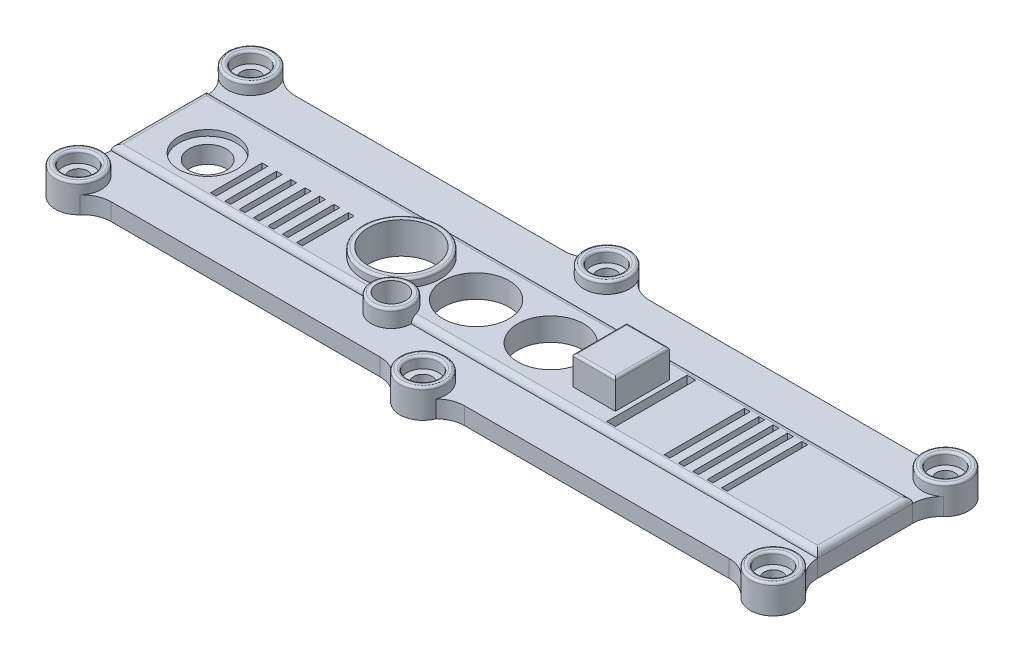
ISO-10303-21;
HEADER;
FILE_DESCRIPTION(('STEP AP214'),'2;1');
FILE_NAME('part.step','',(''),(''),'','','');
FILE_SCHEMA(('AUTOMOTIVE_DESIGN { 1 0 10303 214 1 1 1 1 }'));
ENDSEC;
DATA;
#1=APPLICATION_CONTEXT('core data for automotive mechanical design processes');
#2=APPLICATION_PROTOCOL_DEFINITION('international standard','automotive_design',2000,#1);
#3=PRODUCT_CONTEXT('',#1,'mechanical');
#4=PRODUCT('Part','Part','',(#3));
#5=PRODUCT_RELATED_PRODUCT_CATEGORY('part','',(#4));
#6=PRODUCT_DEFINITION_FORMATION('','',#4);
#7=PRODUCT_DEFINITION_CONTEXT('part definition',#1,'design');
#8=PRODUCT_DEFINITION('design','',#6,#7);
#9=PRODUCT_DEFINITION_SHAPE('','',#8);
#10=(LENGTH_UNIT() NAMED_UNIT(*) SI_UNIT(.MILLI.,.METRE.));
#11=(NAMED_UNIT(*) PLANE_ANGLE_UNIT() SI_UNIT($,.RADIAN.));
#12=(NAMED_UNIT(*) SI_UNIT($,.STERADIAN.) SOLID_ANGLE_UNIT());
#13=UNCERTAINTY_MEASURE_WITH_UNIT(LENGTH_MEASURE(1.E-05),#10,'distance_accuracy_value','');
#14=(GEOMETRIC_REPRESENTATION_CONTEXT(3) GLOBAL_UNCERTAINTY_ASSIGNED_CONTEXT((#13)) GLOBAL_UNIT_ASSIGNED_CONTEXT((#10,
#11,#12)) REPRESENTATION_CONTEXT('',''));
#15=CARTESIAN_POINT('',(0.,0.,0.));
#16=DIRECTION('',(0.,0.,1.));
#17=DIRECTION('',(1.,0.,0.));
#18=AXIS2_PLACEMENT_3D('',#15,#16,#17);
#19=CARTESIAN_POINT('',(0.,4.,0.));
#20=DIRECTION('',(0.,1.,0.));
#21=DIRECTION('',(0.,0.,1.));
#22=AXIS2_PLACEMENT_3D('',#19,#20,#21);
#23=PLANE('',#22);
#24=DIRECTION('',(1.,0.,0.));
#25=VECTOR('',#24,1.);
#26=CARTESIAN_POINT('',(122.,4.,-7.70820393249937));
#27=LINE('',#26,#25);
#28=CARTESIAN_POINT('',(0.,4.,-7.70820393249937));
#29=VERTEX_POINT('',#28);
#30=CARTESIAN_POINT('',(44.3837193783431,4.,-7.70820393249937));
#31=VERTEX_POINT('',#30);
#32=EDGE_CURVE('E1187',#29,#31,#27,.T.);
#33=ORIENTED_EDGE('',*,*,#32,.T.);
#34=CARTESIAN_POINT('',(47.75,4.,-6.75));
#35=DIRECTION('',(0.,1.,0.));
#36=DIRECTION('',(0.,0.,1.));
#37=AXIS2_PLACEMENT_3D('',#34,#35,#36);
#38=CIRCLE('',#37,3.5);
#39=CARTESIAN_POINT('',(51.1162806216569,4.,-7.70820393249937));
#40=VERTEX_POINT('',#39);
#41=EDGE_CURVE('E788',#31,#40,#38,.F.);
#42=ORIENTED_EDGE('',*,*,#41,.T.);
#43=CARTESIAN_POINT('',(121.,4.,-7.70820393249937));
#44=VERTEX_POINT('',#43);
#45=EDGE_CURVE('E1186',#40,#44,#27,.T.);
#46=ORIENTED_EDGE('',*,*,#45,.T.);
#47=DIRECTION('',(0.,0.,-1.));
#48=VECTOR('',#47,1.);
#49=CARTESIAN_POINT('',(121.,4.,-1.01257454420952E-13));
#50=LINE('',#49,#48);
#51=CARTESIAN_POINT('',(121.,4.,-22.2917960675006));
#52=VERTEX_POINT('',#51);
#53=EDGE_CURVE('E1184',#44,#52,#50,.T.);
#54=ORIENTED_EDGE('',*,*,#53,.T.);
#55=DIRECTION('',(-1.,0.,0.));
#56=VECTOR('',#55,1.);
#57=CARTESIAN_POINT('',(-1.,4.,-22.2917960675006));
#58=LINE('',#57,#56);
#59=CARTESIAN_POINT('',(0.,4.,-22.2917960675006));
#60=VERTEX_POINT('',#59);
#61=EDGE_CURVE('E1182',#52,#60,#58,.T.);
#62=ORIENTED_EDGE('',*,*,#61,.T.);
#63=DIRECTION('',(0.,0.,1.));
#64=VECTOR('',#63,1.);
#65=CARTESIAN_POINT('',(0.,4.,-6.70820393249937));
#66=LINE('',#65,#64);
#67=EDGE_CURVE('E999',#60,#29,#66,.T.);
#68=ORIENTED_EDGE('',*,*,#67,.T.);
#69=EDGE_LOOP('',(#33,#42,#46,#54,#62,#68));
#70=FACE_BOUND('',#69,.T.);
#71=DIRECTION('',(0.,0.,1.));
#72=VECTOR('',#71,1.);
#73=CARTESIAN_POINT('',(104.,4.,-22.));
#74=LINE('',#73,#72);
#75=CARTESIAN_POINT('',(104.,4.,-22.));
#76=VERTEX_POINT('',#75);
#77=CARTESIAN_POINT('',(104.,4.,-8.));
#78=VERTEX_POINT('',#77);
#79=EDGE_CURVE('E1920',#76,#78,#74,.T.);
#80=ORIENTED_EDGE('',*,*,#79,.F.);
#81=DIRECTION('',(1.,0.,0.));
#82=VECTOR('',#81,1.);
#83=CARTESIAN_POINT('',(104.,4.,-22.));
#84=LINE('',#83,#82);
#85=CARTESIAN_POINT('',(105.,4.,-22.));
#86=VERTEX_POINT('',#85);
#87=EDGE_CURVE('E1911',#76,#86,#84,.T.);
#88=ORIENTED_EDGE('',*,*,#87,.T.);
#89=DIRECTION('',(0.,0.,1.));
#90=VECTOR('',#89,1.);
#91=CARTESIAN_POINT('',(105.,4.,-22.));
#92=LINE('',#91,#90);
#93=CARTESIAN_POINT('',(105.,4.,-8.));
#94=VERTEX_POINT('',#93);
#95=EDGE_CURVE('E1914',#86,#94,#92,.T.);
#96=ORIENTED_EDGE('',*,*,#95,.T.);
#97=DIRECTION('',(1.,0.,0.));
#98=VECTOR('',#97,1.);
#99=CARTESIAN_POINT('',(104.,4.,-8.));
#100=LINE('',#99,#98);
#101=EDGE_CURVE('E1917',#78,#94,#100,.T.);
#102=ORIENTED_EDGE('',*,*,#101,.F.);
#103=EDGE_LOOP('',(#80,#88,#96,#102));
#104=FACE_BOUND('',#103,.T.);
#105=DIRECTION('',(0.,0.,1.));
#106=VECTOR('',#105,1.);
#107=CARTESIAN_POINT('',(99.,4.,-22.));
#108=LINE('',#107,#106);
#109=CARTESIAN_POINT('',(99.,4.,-22.));
#110=VERTEX_POINT('',#109);
#111=CARTESIAN_POINT('',(99.,4.,-8.));
#112=VERTEX_POINT('',#111);
#113=EDGE_CURVE('E1858',#110,#112,#108,.T.);
#114=ORIENTED_EDGE('',*,*,#113,.F.);
#115=DIRECTION('',(1.,0.,0.));
#116=VECTOR('',#115,1.);
#117=CARTESIAN_POINT('',(99.,4.,-22.));
#118=LINE('',#117,#116);
#119=CARTESIAN_POINT('',(100.,4.,-22.));
#120=VERTEX_POINT('',#119);
#121=EDGE_CURVE('E1849',#110,#120,#118,.T.);
#122=ORIENTED_EDGE('',*,*,#121,.T.);
#123=DIRECTION('',(0.,0.,1.));
#124=VECTOR('',#123,1.);
#125=CARTESIAN_POINT('',(100.,4.,-22.));
#126=LINE('',#125,#124);
#127=CARTESIAN_POINT('',(100.,4.,-8.));
#128=VERTEX_POINT('',#127);
#129=EDGE_CURVE('E1852',#120,#128,#126,.T.);
#130=ORIENTED_EDGE('',*,*,#129,.T.);
#131=DIRECTION('',(1.,0.,0.));
#132=VECTOR('',#131,1.);
#133=CARTESIAN_POINT('',(99.,4.,-8.));
#134=LINE('',#133,#132);
#135=EDGE_CURVE('E1855',#112,#128,#134,.T.);
#136=ORIENTED_EDGE('',*,*,#135,.F.);
#137=EDGE_LOOP('',(#114,#122,#130,#136));
#138=FACE_BOUND('',#137,.T.);
#139=DIRECTION('',(0.,0.,1.));
#140=VECTOR('',#139,1.);
#141=CARTESIAN_POINT('',(94.,4.,-22.));
#142=LINE('',#141,#140);
#143=CARTESIAN_POINT('',(94.,4.,-22.));
#144=VERTEX_POINT('',#143);
#145=CARTESIAN_POINT('',(94.,4.,-8.));
#146=VERTEX_POINT('',#145);
#147=EDGE_CURVE('E1796',#144,#146,#142,.T.);
#148=ORIENTED_EDGE('',*,*,#147,.F.);
#149=DIRECTION('',(1.,0.,0.));
#150=VECTOR('',#149,1.);
#151=CARTESIAN_POINT('',(94.,4.,-22.));
#152=LINE('',#151,#150);
#153=CARTESIAN_POINT('',(95.,4.,-22.));
#154=VERTEX_POINT('',#153);
#155=EDGE_CURVE('E1782',#144,#154,#152,.T.);
#156=ORIENTED_EDGE('',*,*,#155,.T.);
#157=DIRECTION('',(0.,0.,1.));
#158=VECTOR('',#157,1.);
#159=CARTESIAN_POINT('',(95.,4.,-22.));
#160=LINE('',#159,#158);
#161=CARTESIAN_POINT('',(95.,4.,-8.));
#162=VERTEX_POINT('',#161);
#163=EDGE_CURVE('E1790',#154,#162,#160,.T.);
#164=ORIENTED_EDGE('',*,*,#163,.T.);
#165=DIRECTION('',(1.,0.,0.));
#166=VECTOR('',#165,1.);
#167=CARTESIAN_POINT('',(94.,4.,-8.));
#168=LINE('',#167,#166);
#169=EDGE_CURVE('E1793',#146,#162,#168,.T.);
#170=ORIENTED_EDGE('',*,*,#169,.F.);
#171=EDGE_LOOP('',(#148,#156,#164,#170));
#172=FACE_BOUND('',#171,.T.);
#173=DIRECTION('',(-1.,0.,0.));
#174=VECTOR('',#173,1.);
#175=CARTESIAN_POINT('',(31.,4.,-17.));
#176=LINE('',#175,#174);
#177=CARTESIAN_POINT('',(31.,4.,-17.));
#178=VERTEX_POINT('',#177);
#179=CARTESIAN_POINT('',(30.,4.,-17.));
#180=VERTEX_POINT('',#179);
#181=EDGE_CURVE('E1751',#178,#180,#176,.T.);
#182=ORIENTED_EDGE('',*,*,#181,.F.);
#183=DIRECTION('',(0.,0.,1.));
#184=VECTOR('',#183,1.);
#185=CARTESIAN_POINT('',(31.,4.,-17.));
#186=LINE('',#185,#184);
#187=CARTESIAN_POINT('',(31.,4.,-8.));
#188=VERTEX_POINT('',#187);
#189=EDGE_CURVE('E1764',#178,#188,#186,.T.);
#190=ORIENTED_EDGE('',*,*,#189,.T.);
#191=DIRECTION('',(-1.,0.,0.));
#192=VECTOR('',#191,1.);
#193=CARTESIAN_POINT('',(31.,4.,-8.));
#194=LINE('',#193,#192);
#195=CARTESIAN_POINT('',(30.,4.,-8.));
#196=VERTEX_POINT('',#195);
#197=EDGE_CURVE('E1761',#188,#196,#194,.T.);
#198=ORIENTED_EDGE('',*,*,#197,.T.);
#199=DIRECTION('',(0.,0.,1.));
#200=VECTOR('',#199,1.);
#201=CARTESIAN_POINT('',(30.,4.,-17.));
#202=LINE('',#201,#200);
#203=EDGE_CURVE('E1758',#180,#196,#202,.T.);
#204=ORIENTED_EDGE('',*,*,#203,.F.);
#205=EDGE_LOOP('',(#182,#190,#198,#204));
#206=FACE_BOUND('',#205,.T.);
#207=DIRECTION('',(-1.,0.,0.));
#208=VECTOR('',#207,1.);
#209=CARTESIAN_POINT('',(28.5,4.,-17.));
#210=LINE('',#209,#208);
#211=CARTESIAN_POINT('',(28.5,4.,-17.));
#212=VERTEX_POINT('',#211);
#213=CARTESIAN_POINT('',(27.5,4.,-17.));
#214=VERTEX_POINT('',#213);
#215=EDGE_CURVE('E1720',#212,#214,#210,.T.);
#216=ORIENTED_EDGE('',*,*,#215,.F.);
#217=DIRECTION('',(0.,0.,1.));
#218=VECTOR('',#217,1.);
#219=CARTESIAN_POINT('',(28.5,4.,-17.));
#220=LINE('',#219,#218);
#221=CARTESIAN_POINT('',(28.5,4.,-8.));
#222=VERTEX_POINT('',#221);
#223=EDGE_CURVE('E1733',#212,#222,#220,.T.);
#224=ORIENTED_EDGE('',*,*,#223,.T.);
#225=DIRECTION('',(-1.,0.,0.));
#226=VECTOR('',#225,1.);
#227=CARTESIAN_POINT('',(28.5,4.,-8.));
#228=LINE('',#227,#226);
#229=CARTESIAN_POINT('',(27.5,4.,-8.));
#230=VERTEX_POINT('',#229);
#231=EDGE_CURVE('E1730',#222,#230,#228,.T.);
#232=ORIENTED_EDGE('',*,*,#231,.T.);
#233=DIRECTION('',(0.,0.,1.));
#234=VECTOR('',#233,1.);
#235=CARTESIAN_POINT('',(27.5,4.,-17.));
#236=LINE('',#235,#234);
#237=EDGE_CURVE('E1727',#214,#230,#236,.T.);
#238=ORIENTED_EDGE('',*,*,#237,.F.);
#239=EDGE_LOOP('',(#216,#224,#232,#238));
#240=FACE_BOUND('',#239,.T.);
#241=DIRECTION('',(-1.,0.,0.));
#242=VECTOR('',#241,1.);
#243=CARTESIAN_POINT('',(26.,4.,-17.));
#244=LINE('',#243,#242);
#245=CARTESIAN_POINT('',(26.,4.,-17.));
#246=VERTEX_POINT('',#245);
#247=CARTESIAN_POINT('',(25.,4.,-17.));
#248=VERTEX_POINT('',#247);
#249=EDGE_CURVE('E1689',#246,#248,#244,.T.);
#250=ORIENTED_EDGE('',*,*,#249,.F.);
#251=DIRECTION('',(0.,0.,1.));
#252=VECTOR('',#251,1.);
#253=CARTESIAN_POINT('',(26.,4.,-17.));
#254=LINE('',#253,#252);
#255=CARTESIAN_POINT('',(26.,4.,-8.));
#256=VERTEX_POINT('',#255);
#257=EDGE_CURVE('E1702',#246,#256,#254,.T.);
#258=ORIENTED_EDGE('',*,*,#257,.T.);
#259=DIRECTION('',(-1.,0.,0.));
#260=VECTOR('',#259,1.);
#261=CARTESIAN_POINT('',(26.,4.,-8.));
#262=LINE('',#261,#260);
#263=CARTESIAN_POINT('',(25.,4.,-8.));
#264=VERTEX_POINT('',#263);
#265=EDGE_CURVE('E1699',#256,#264,#262,.T.);
#266=ORIENTED_EDGE('',*,*,#265,.T.);
#267=DIRECTION('',(0.,0.,1.));
#268=VECTOR('',#267,1.);
#269=CARTESIAN_POINT('',(25.,4.,-17.));
#270=LINE('',#269,#268);
#271=EDGE_CURVE('E1696',#248,#264,#270,.T.);
#272=ORIENTED_EDGE('',*,*,#271,.F.);
#273=EDGE_LOOP('',(#250,#258,#266,#272));
#274=FACE_BOUND('',#273,.T.);
#275=DIRECTION('',(-1.,0.,0.));
#276=VECTOR('',#275,1.);
#277=CARTESIAN_POINT('',(23.5,4.,-17.));
#278=LINE('',#277,#276);
#279=CARTESIAN_POINT('',(23.5,4.,-17.));
#280=VERTEX_POINT('',#279);
#281=CARTESIAN_POINT('',(22.5,4.,-17.));
#282=VERTEX_POINT('',#281);
#283=EDGE_CURVE('E1658',#280,#282,#278,.T.);
#284=ORIENTED_EDGE('',*,*,#283,.F.);
#285=DIRECTION('',(0.,0.,1.));
#286=VECTOR('',#285,1.);
#287=CARTESIAN_POINT('',(23.5,4.,-17.));
#288=LINE('',#287,#286);
#289=CARTESIAN_POINT('',(23.5,4.,-8.));
#290=VERTEX_POINT('',#289);
#291=EDGE_CURVE('E1671',#280,#290,#288,.T.);
#292=ORIENTED_EDGE('',*,*,#291,.T.);
#293=DIRECTION('',(-1.,0.,0.));
#294=VECTOR('',#293,1.);
#295=CARTESIAN_POINT('',(23.5,4.,-8.));
#296=LINE('',#295,#294);
#297=CARTESIAN_POINT('',(22.5,4.,-8.));
#298=VERTEX_POINT('',#297);
#299=EDGE_CURVE('E1668',#290,#298,#296,.T.);
#300=ORIENTED_EDGE('',*,*,#299,.T.);
#301=DIRECTION('',(0.,0.,1.));
#302=VECTOR('',#301,1.);
#303=CARTESIAN_POINT('',(22.5,4.,-17.));
#304=LINE('',#303,#302);
#305=EDGE_CURVE('E1665',#282,#298,#304,.T.);
#306=ORIENTED_EDGE('',*,*,#305,.F.);
#307=EDGE_LOOP('',(#284,#292,#300,#306));
#308=FACE_BOUND('',#307,.T.);
#309=DIRECTION('',(-1.,0.,0.));
#310=VECTOR('',#309,1.);
#311=CARTESIAN_POINT('',(21.,4.,-17.));
#312=LINE('',#311,#310);
#313=CARTESIAN_POINT('',(21.,4.,-17.));
#314=VERTEX_POINT('',#313);
#315=CARTESIAN_POINT('',(20.,4.,-17.));
#316=VERTEX_POINT('',#315);
#317=EDGE_CURVE('E1627',#314,#316,#312,.T.);
#318=ORIENTED_EDGE('',*,*,#317,.F.);
#319=DIRECTION('',(0.,0.,1.));
#320=VECTOR('',#319,1.);
#321=CARTESIAN_POINT('',(21.,4.,-17.));
#322=LINE('',#321,#320);
#323=CARTESIAN_POINT('',(21.,4.,-8.));
#324=VERTEX_POINT('',#323);
#325=EDGE_CURVE('E1640',#314,#324,#322,.T.);
#326=ORIENTED_EDGE('',*,*,#325,.T.);
#327=DIRECTION('',(-1.,0.,0.));
#328=VECTOR('',#327,1.);
#329=CARTESIAN_POINT('',(21.,4.,-8.));
#330=LINE('',#329,#328);
#331=CARTESIAN_POINT('',(20.,4.,-8.));
#332=VERTEX_POINT('',#331);
#333=EDGE_CURVE('E1637',#324,#332,#330,.T.);
#334=ORIENTED_EDGE('',*,*,#333,.T.);
#335=DIRECTION('',(0.,0.,1.));
#336=VECTOR('',#335,1.);
#337=CARTESIAN_POINT('',(20.,4.,-17.));
#338=LINE('',#337,#336);
#339=EDGE_CURVE('E1634',#316,#332,#338,.T.);
#340=ORIENTED_EDGE('',*,*,#339,.F.);
#341=EDGE_LOOP('',(#318,#326,#334,#340));
#342=FACE_BOUND('',#341,.T.);
#343=DIRECTION('',(-1.,0.,0.));
#344=VECTOR('',#343,1.);
#345=CARTESIAN_POINT('',(18.5,4.,-17.));
#346=LINE('',#345,#344);
#347=CARTESIAN_POINT('',(18.5,4.,-17.));
#348=VERTEX_POINT('',#347);
#349=CARTESIAN_POINT('',(17.5,4.,-17.));
#350=VERTEX_POINT('',#349);
#351=EDGE_CURVE('E1601',#348,#350,#346,.T.);
#352=ORIENTED_EDGE('',*,*,#351,.F.);
#353=DIRECTION('',(0.,0.,1.));
#354=VECTOR('',#353,1.);
#355=CARTESIAN_POINT('',(18.5,4.,-17.));
#356=LINE('',#355,#354);
#357=CARTESIAN_POINT('',(18.5,4.,-8.));
#358=VERTEX_POINT('',#357);
#359=EDGE_CURVE('E1609',#348,#358,#356,.T.);
#360=ORIENTED_EDGE('',*,*,#359,.T.);
#361=DIRECTION('',(-1.,0.,0.));
#362=VECTOR('',#361,1.);
#363=CARTESIAN_POINT('',(18.5,4.,-8.));
#364=LINE('',#363,#362);
#365=CARTESIAN_POINT('',(17.5,4.,-8.));
#366=VERTEX_POINT('',#365);
#367=EDGE_CURVE('E1606',#358,#366,#364,.T.);
#368=ORIENTED_EDGE('',*,*,#367,.T.);
#369=DIRECTION('',(0.,0.,1.));
#370=VECTOR('',#369,1.);
#371=CARTESIAN_POINT('',(17.5,4.,-17.));
#372=LINE('',#371,#370);
#373=EDGE_CURVE('E1603',#350,#366,#372,.T.);
#374=ORIENTED_EDGE('',*,*,#373,.F.);
#375=EDGE_LOOP('',(#352,#360,#368,#374));
#376=FACE_BOUND('',#375,.T.);
#377=DIRECTION('',(-1.,0.,0.));
#378=VECTOR('',#377,1.);
#379=CARTESIAN_POINT('',(16.,4.,-17.));
#380=LINE('',#379,#378);
#381=CARTESIAN_POINT('',(16.,4.,-17.));
#382=VERTEX_POINT('',#381);
#383=CARTESIAN_POINT('',(15.,4.,-17.));
#384=VERTEX_POINT('',#383);
#385=EDGE_CURVE('E1599',#382,#384,#380,.T.);
#386=ORIENTED_EDGE('',*,*,#385,.F.);
#387=DIRECTION('',(0.,0.,1.));
#388=VECTOR('',#387,1.);
#389=CARTESIAN_POINT('',(16.,4.,-17.));
#390=LINE('',#389,#388);
#391=CARTESIAN_POINT('',(16.,4.,-8.));
#392=VERTEX_POINT('',#391);
#393=EDGE_CURVE('E1590',#382,#392,#390,.T.);
#394=ORIENTED_EDGE('',*,*,#393,.T.);
#395=DIRECTION('',(-1.,0.,0.));
#396=VECTOR('',#395,1.);
#397=CARTESIAN_POINT('',(16.,4.,-8.));
#398=LINE('',#397,#396);
#399=CARTESIAN_POINT('',(15.,4.,-8.));
#400=VERTEX_POINT('',#399);
#401=EDGE_CURVE('E1593',#392,#400,#398,.T.);
#402=ORIENTED_EDGE('',*,*,#401,.T.);
#403=DIRECTION('',(0.,0.,1.));
#404=VECTOR('',#403,1.);
#405=CARTESIAN_POINT('',(15.,4.,-17.));
#406=LINE('',#405,#404);
#407=EDGE_CURVE('E1596',#384,#400,#406,.T.);
#408=ORIENTED_EDGE('',*,*,#407,.F.);
#409=EDGE_LOOP('',(#386,#394,#402,#408));
#410=FACE_BOUND('',#409,.T.);
#411=CARTESIAN_POINT('',(54.25,4.,-15.));
#412=DIRECTION('',(0.,1.,0.));
#413=DIRECTION('',(0.,0.,1.));
#414=AXIS2_PLACEMENT_3D('',#411,#412,#413);
#415=CIRCLE('',#414,5.75);
#416=CARTESIAN_POINT('',(54.25,4.,-9.25000000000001));
#417=VERTEX_POINT('',#416);
#418=EDGE_CURVE('E1436',#417,#417,#415,.T.);
#419=ORIENTED_EDGE('',*,*,#418,.F.);
#420=EDGE_LOOP('',(#419));
#421=FACE_BOUND('',#420,.T.);
#422=CARTESIAN_POINT('',(67.25,4.,-15.));
#423=DIRECTION('',(0.,1.,0.));
#424=DIRECTION('',(0.,0.,1.));
#425=AXIS2_PLACEMENT_3D('',#422,#423,#424);
#426=CIRCLE('',#425,5.74999999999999);
#427=CARTESIAN_POINT('',(67.25,4.,-9.25000000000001));
#428=VERTEX_POINT('',#427);
#429=EDGE_CURVE('E1439',#428,#428,#426,.T.);
#430=ORIENTED_EDGE('',*,*,#429,.F.);
#431=EDGE_LOOP('',(#430));
#432=FACE_BOUND('',#431,.T.);
#433=DIRECTION('',(0.,0.,1.));
#434=VECTOR('',#433,1.);
#435=CARTESIAN_POINT('',(96.5,4.,-22.));
#436=LINE('',#435,#434);
#437=CARTESIAN_POINT('',(96.5,4.,-22.));
#438=VERTEX_POINT('',#437);
#439=CARTESIAN_POINT('',(96.5,4.,-8.));
#440=VERTEX_POINT('',#439);
#441=EDGE_CURVE('E1827',#438,#440,#436,.T.);
#442=ORIENTED_EDGE('',*,*,#441,.F.);
#443=DIRECTION('',(1.,0.,0.));
#444=VECTOR('',#443,1.);
#445=CARTESIAN_POINT('',(96.5,4.,-22.));
#446=LINE('',#445,#444);
#447=CARTESIAN_POINT('',(97.5,4.,-22.));
#448=VERTEX_POINT('',#447);
#449=EDGE_CURVE('E1818',#438,#448,#446,.T.);
#450=ORIENTED_EDGE('',*,*,#449,.T.);
#451=DIRECTION('',(0.,0.,1.));
#452=VECTOR('',#451,1.);
#453=CARTESIAN_POINT('',(97.5,4.,-22.));
#454=LINE('',#453,#452);
#455=CARTESIAN_POINT('',(97.5,4.,-8.));
#456=VERTEX_POINT('',#455);
#457=EDGE_CURVE('E1821',#448,#456,#454,.T.);
#458=ORIENTED_EDGE('',*,*,#457,.T.);
#459=DIRECTION('',(1.,0.,0.));
#460=VECTOR('',#459,1.);
#461=CARTESIAN_POINT('',(96.5,4.,-8.));
#462=LINE('',#461,#460);
#463=EDGE_CURVE('E1824',#440,#456,#462,.T.);
#464=ORIENTED_EDGE('',*,*,#463,.F.);
#465=EDGE_LOOP('',(#442,#450,#458,#464));
#466=FACE_BOUND('',#465,.T.);
#467=DIRECTION('',(0.,0.,1.));
#468=VECTOR('',#467,1.);
#469=CARTESIAN_POINT('',(101.5,4.,-22.));
#470=LINE('',#469,#468);
#471=CARTESIAN_POINT('',(101.5,4.,-22.));
#472=VERTEX_POINT('',#471);
#473=CARTESIAN_POINT('',(101.5,4.,-8.));
#474=VERTEX_POINT('',#473);
#475=EDGE_CURVE('E1889',#472,#474,#470,.T.);
#476=ORIENTED_EDGE('',*,*,#475,.F.);
#477=DIRECTION('',(1.,0.,0.));
#478=VECTOR('',#477,1.);
#479=CARTESIAN_POINT('',(101.5,4.,-22.));
#480=LINE('',#479,#478);
#481=CARTESIAN_POINT('',(102.5,4.,-22.));
#482=VERTEX_POINT('',#481);
#483=EDGE_CURVE('E1880',#472,#482,#480,.T.);
#484=ORIENTED_EDGE('',*,*,#483,.T.);
#485=DIRECTION('',(0.,0.,1.));
#486=VECTOR('',#485,1.);
#487=CARTESIAN_POINT('',(102.5,4.,-22.));
#488=LINE('',#487,#486);
#489=CARTESIAN_POINT('',(102.5,4.,-8.));
#490=VERTEX_POINT('',#489);
#491=EDGE_CURVE('E1883',#482,#490,#488,.T.);
#492=ORIENTED_EDGE('',*,*,#491,.T.);
#493=DIRECTION('',(1.,0.,0.));
#494=VECTOR('',#493,1.);
#495=CARTESIAN_POINT('',(101.5,4.,-8.));
#496=LINE('',#495,#494);
#497=EDGE_CURVE('E1886',#474,#490,#496,.T.);
#498=ORIENTED_EDGE('',*,*,#497,.F.);
#499=EDGE_LOOP('',(#476,#484,#492,#498));
#500=FACE_BOUND('',#499,.T.);
#501=CARTESIAN_POINT('',(41.25,4.,-15.));
#502=DIRECTION('',(0.,1.,0.));
#503=DIRECTION('',(0.,0.,1.));
#504=AXIS2_PLACEMENT_3D('',#501,#502,#503);
#505=CIRCLE('',#504,6.75);
#506=CARTESIAN_POINT('',(41.25,4.,-8.25));
#507=VERTEX_POINT('',#506);
#508=EDGE_CURVE('E1941',#507,#507,#505,.T.);
#509=ORIENTED_EDGE('',*,*,#508,.F.);
#510=EDGE_LOOP('',(#509));
#511=FACE_BOUND('',#510,.T.);
#512=DIRECTION('',(1.,0.,0.));
#513=VECTOR('',#512,1.);
#514=CARTESIAN_POINT('',(75.8,4.,-19.7));
#515=LINE('',#514,#513);
#516=CARTESIAN_POINT('',(75.8,4.,-19.7));
#517=VERTEX_POINT('',#516);
#518=CARTESIAN_POINT('',(83.2,4.,-19.7));
#519=VERTEX_POINT('',#518);
#520=EDGE_CURVE('E762',#517,#519,#515,.T.);
#521=ORIENTED_EDGE('',*,*,#520,.T.);
#522=DIRECTION('',(0.,0.,1.));
#523=VECTOR('',#522,1.);
#524=CARTESIAN_POINT('',(83.2,4.,-19.7));
#525=LINE('',#524,#523);
#526=CARTESIAN_POINT('',(83.2,4.,-10.3));
#527=VERTEX_POINT('',#526);
#528=EDGE_CURVE('E765',#519,#527,#525,.T.);
#529=ORIENTED_EDGE('',*,*,#528,.T.);
#530=DIRECTION('',(1.,0.,0.));
#531=VECTOR('',#530,1.);
#532=CARTESIAN_POINT('',(75.8,4.,-10.3));
#533=LINE('',#532,#531);
#534=CARTESIAN_POINT('',(75.8,4.,-10.3));
#535=VERTEX_POINT('',#534);
#536=EDGE_CURVE('E769',#535,#527,#533,.T.);
#537=ORIENTED_EDGE('',*,*,#536,.F.);
#538=DIRECTION('',(0.,0.,1.));
#539=VECTOR('',#538,1.);
#540=CARTESIAN_POINT('',(75.8,4.,-19.7));
#541=LINE('',#540,#539);
#542=EDGE_CURVE('E772',#517,#535,#541,.T.);
#543=ORIENTED_EDGE('',*,*,#542,.F.);
#544=EDGE_LOOP('',(#521,#529,#537,#543));
#545=FACE_BOUND('',#544,.T.);
#546=CARTESIAN_POINT('',(8.75,4.,-13.75));
#547=DIRECTION('',(0.,1.,0.));
#548=DIRECTION('',(0.,0.,1.));
#549=AXIS2_PLACEMENT_3D('',#546,#547,#548);
#550=CIRCLE('',#549,5.);
#551=CARTESIAN_POINT('',(8.75,4.,-8.75));
#552=VERTEX_POINT('',#551);
#553=EDGE_CURVE('E707',#552,#552,#550,.T.);
#554=ORIENTED_EDGE('',*,*,#553,.F.);
#555=EDGE_LOOP('',(#554));
#556=FACE_BOUND('',#555,.T.);
#557=DIRECTION('',(0.,0.,1.));
#558=VECTOR('',#557,1.);
#559=CARTESIAN_POINT('',(84.,4.,0.));
#560=LINE('',#559,#558);
#561=CARTESIAN_POINT('',(84.,4.,-22.));
#562=VERTEX_POINT('',#561);
#563=CARTESIAN_POINT('',(84.,4.,-7.99999999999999));
#564=VERTEX_POINT('',#563);
#565=EDGE_CURVE('E688',#562,#564,#560,.T.);
#566=ORIENTED_EDGE('',*,*,#565,.F.);
#567=DIRECTION('',(1.,0.,0.));
#568=VECTOR('',#567,1.);
#569=CARTESIAN_POINT('',(0.,4.,-22.));
#570=LINE('',#569,#568);
#571=CARTESIAN_POINT('',(85.5,4.,-22.));
#572=VERTEX_POINT('',#571);
#573=EDGE_CURVE('E705',#562,#572,#570,.T.);
#574=ORIENTED_EDGE('',*,*,#573,.T.);
#575=DIRECTION('',(0.,0.,1.));
#576=VECTOR('',#575,1.);
#577=CARTESIAN_POINT('',(85.5,4.,0.));
#578=LINE('',#577,#576);
#579=CARTESIAN_POINT('',(85.5,4.,-7.99999999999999));
#580=VERTEX_POINT('',#579);
#581=EDGE_CURVE('E687',#572,#580,#578,.T.);
#582=ORIENTED_EDGE('',*,*,#581,.T.);
#583=DIRECTION('',(1.,0.,0.));
#584=VECTOR('',#583,1.);
#585=CARTESIAN_POINT('',(0.,4.,-7.99999999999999));
#586=LINE('',#585,#584);
#587=EDGE_CURVE('E702',#564,#580,#586,.T.);
#588=ORIENTED_EDGE('',*,*,#587,.F.);
#589=EDGE_LOOP('',(#566,#574,#582,#588));
#590=FACE_BOUND('',#589,.T.);
#591=ADVANCED_FACE('F41',(#70,#104,#138,#172,#206,#240,#274,#308,#342,#376,#410,#421,#432,#466,
#500,#511,#545,#556,#590),#23,.T.);
#592=CARTESIAN_POINT('',(6.70820393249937,0.,-36.));
#593=DIRECTION('',(0.,-1.,0.));
#594=DIRECTION('',(0.,0.,-1.));
#595=AXIS2_PLACEMENT_3D('',#592,#593,#594);
#596=PLANE('',#595);
#597=DIRECTION('',(0.,0.,1.));
#598=VECTOR('',#597,1.);
#599=CARTESIAN_POINT('',(105.,0.,-22.));
#600=LINE('',#599,#598);
#601=CARTESIAN_POINT('',(105.,0.,-22.));
#602=VERTEX_POINT('',#601);
#603=CARTESIAN_POINT('',(105.,0.,-8.));
#604=VERTEX_POINT('',#603);
#605=EDGE_CURVE('E1925',#602,#604,#600,.T.);
#606=ORIENTED_EDGE('',*,*,#605,.F.);
#607=DIRECTION('',(1.,0.,0.));
#608=VECTOR('',#607,1.);
#609=CARTESIAN_POINT('',(104.,0.,-22.));
#610=LINE('',#609,#608);
#611=CARTESIAN_POINT('',(104.,0.,-22.));
#612=VERTEX_POINT('',#611);
#613=EDGE_CURVE('E1923',#612,#602,#610,.T.);
#614=ORIENTED_EDGE('',*,*,#613,.F.);
#615=DIRECTION('',(0.,0.,1.));
#616=VECTOR('',#615,1.);
#617=CARTESIAN_POINT('',(104.,0.,-22.));
#618=LINE('',#617,#616);
#619=CARTESIAN_POINT('',(104.,0.,-8.));
#620=VERTEX_POINT('',#619);
#621=EDGE_CURVE('E1930',#612,#620,#618,.T.);
#622=ORIENTED_EDGE('',*,*,#621,.T.);
#623=DIRECTION('',(1.,0.,0.));
#624=VECTOR('',#623,1.);
#625=CARTESIAN_POINT('',(104.,0.,-8.));
#626=LINE('',#625,#624);
#627=EDGE_CURVE('E1927',#620,#604,#626,.T.);
#628=ORIENTED_EDGE('',*,*,#627,.T.);
#629=EDGE_LOOP('',(#606,#614,#622,#628));
#630=FACE_BOUND('',#629,.T.);
#631=DIRECTION('',(0.,0.,1.));
#632=VECTOR('',#631,1.);
#633=CARTESIAN_POINT('',(100.,0.,-22.));
#634=LINE('',#633,#632);
#635=CARTESIAN_POINT('',(100.,0.,-22.));
#636=VERTEX_POINT('',#635);
#637=CARTESIAN_POINT('',(100.,0.,-8.));
#638=VERTEX_POINT('',#637);
#639=EDGE_CURVE('E1863',#636,#638,#634,.T.);
#640=ORIENTED_EDGE('',*,*,#639,.F.);
#641=DIRECTION('',(1.,0.,0.));
#642=VECTOR('',#641,1.);
#643=CARTESIAN_POINT('',(99.,0.,-22.));
#644=LINE('',#643,#642);
#645=CARTESIAN_POINT('',(99.,0.,-22.));
#646=VERTEX_POINT('',#645);
#647=EDGE_CURVE('E1861',#646,#636,#644,.T.);
#648=ORIENTED_EDGE('',*,*,#647,.F.);
#649=DIRECTION('',(0.,0.,1.));
#650=VECTOR('',#649,1.);
#651=CARTESIAN_POINT('',(99.,0.,-22.));
#652=LINE('',#651,#650);
#653=CARTESIAN_POINT('',(99.,0.,-8.));
#654=VERTEX_POINT('',#653);
#655=EDGE_CURVE('E1868',#646,#654,#652,.T.);
#656=ORIENTED_EDGE('',*,*,#655,.T.);
#657=DIRECTION('',(1.,0.,0.));
#658=VECTOR('',#657,1.);
#659=CARTESIAN_POINT('',(99.,0.,-8.));
#660=LINE('',#659,#658);
#661=EDGE_CURVE('E1865',#654,#638,#660,.T.);
#662=ORIENTED_EDGE('',*,*,#661,.T.);
#663=EDGE_LOOP('',(#640,#648,#656,#662));
#664=FACE_BOUND('',#663,.T.);
#665=DIRECTION('',(0.,0.,1.));
#666=VECTOR('',#665,1.);
#667=CARTESIAN_POINT('',(95.,0.,-22.));
#668=LINE('',#667,#666);
#669=CARTESIAN_POINT('',(95.,0.,-22.));
#670=VERTEX_POINT('',#669);
#671=CARTESIAN_POINT('',(95.,0.,-8.));
#672=VERTEX_POINT('',#671);
#673=EDGE_CURVE('E1801',#670,#672,#668,.T.);
#674=ORIENTED_EDGE('',*,*,#673,.F.);
#675=DIRECTION('',(1.,0.,0.));
#676=VECTOR('',#675,1.);
#677=CARTESIAN_POINT('',(94.,0.,-22.));
#678=LINE('',#677,#676);
#679=CARTESIAN_POINT('',(94.,0.,-22.));
#680=VERTEX_POINT('',#679);
#681=EDGE_CURVE('E1799',#680,#670,#678,.T.);
#682=ORIENTED_EDGE('',*,*,#681,.F.);
#683=DIRECTION('',(0.,0.,1.));
#684=VECTOR('',#683,1.);
#685=CARTESIAN_POINT('',(94.,0.,-22.));
#686=LINE('',#685,#684);
#687=CARTESIAN_POINT('',(94.,0.,-8.));
#688=VERTEX_POINT('',#687);
#689=EDGE_CURVE('E1806',#680,#688,#686,.T.);
#690=ORIENTED_EDGE('',*,*,#689,.T.);
#691=DIRECTION('',(1.,0.,0.));
#692=VECTOR('',#691,1.);
#693=CARTESIAN_POINT('',(94.,0.,-8.));
#694=LINE('',#693,#692);
#695=EDGE_CURVE('E1803',#688,#672,#694,.T.);
#696=ORIENTED_EDGE('',*,*,#695,.T.);
#697=EDGE_LOOP('',(#674,#682,#690,#696));
#698=FACE_BOUND('',#697,.T.);
#699=DIRECTION('',(-1.,0.,0.));
#700=VECTOR('',#699,1.);
#701=CARTESIAN_POINT('',(31.,0.,-17.));
#702=LINE('',#701,#700);
#703=CARTESIAN_POINT('',(31.,0.,-17.));
#704=VERTEX_POINT('',#703);
#705=CARTESIAN_POINT('',(30.,0.,-17.));
#706=VERTEX_POINT('',#705);
#707=EDGE_CURVE('E1767',#704,#706,#702,.T.);
#708=ORIENTED_EDGE('',*,*,#707,.T.);
#709=DIRECTION('',(0.,0.,1.));
#710=VECTOR('',#709,1.);
#711=CARTESIAN_POINT('',(30.,0.,-17.));
#712=LINE('',#711,#710);
#713=CARTESIAN_POINT('',(30.,0.,-8.));
#714=VERTEX_POINT('',#713);
#715=EDGE_CURVE('E1770',#706,#714,#712,.T.);
#716=ORIENTED_EDGE('',*,*,#715,.T.);
#717=DIRECTION('',(-1.,0.,0.));
#718=VECTOR('',#717,1.);
#719=CARTESIAN_POINT('',(31.,0.,-8.));
#720=LINE('',#719,#718);
#721=CARTESIAN_POINT('',(31.,0.,-8.));
#722=VERTEX_POINT('',#721);
#723=EDGE_CURVE('E1773',#722,#714,#720,.T.);
#724=ORIENTED_EDGE('',*,*,#723,.F.);
#725=DIRECTION('',(0.,0.,1.));
#726=VECTOR('',#725,1.);
#727=CARTESIAN_POINT('',(31.,0.,-17.));
#728=LINE('',#727,#726);
#729=EDGE_CURVE('E1776',#704,#722,#728,.T.);
#730=ORIENTED_EDGE('',*,*,#729,.F.);
#731=EDGE_LOOP('',(#708,#716,#724,#730));
#732=FACE_BOUND('',#731,.T.);
#733=DIRECTION('',(-1.,0.,0.));
#734=VECTOR('',#733,1.);
#735=CARTESIAN_POINT('',(28.5,0.,-17.));
#736=LINE('',#735,#734);
#737=CARTESIAN_POINT('',(28.5,0.,-17.));
#738=VERTEX_POINT('',#737);
#739=CARTESIAN_POINT('',(27.5,0.,-17.));
#740=VERTEX_POINT('',#739);
#741=EDGE_CURVE('E1736',#738,#740,#736,.T.);
#742=ORIENTED_EDGE('',*,*,#741,.T.);
#743=DIRECTION('',(0.,0.,1.));
#744=VECTOR('',#743,1.);
#745=CARTESIAN_POINT('',(27.5,0.,-17.));
#746=LINE('',#745,#744);
#747=CARTESIAN_POINT('',(27.5,0.,-8.));
#748=VERTEX_POINT('',#747);
#749=EDGE_CURVE('E1739',#740,#748,#746,.T.);
#750=ORIENTED_EDGE('',*,*,#749,.T.);
#751=DIRECTION('',(-1.,0.,0.));
#752=VECTOR('',#751,1.);
#753=CARTESIAN_POINT('',(28.5,0.,-8.));
#754=LINE('',#753,#752);
#755=CARTESIAN_POINT('',(28.5,0.,-8.));
#756=VERTEX_POINT('',#755);
#757=EDGE_CURVE('E1742',#756,#748,#754,.T.);
#758=ORIENTED_EDGE('',*,*,#757,.F.);
#759=DIRECTION('',(0.,0.,1.));
#760=VECTOR('',#759,1.);
#761=CARTESIAN_POINT('',(28.5,0.,-17.));
#762=LINE('',#761,#760);
#763=EDGE_CURVE('E1745',#738,#756,#762,.T.);
#764=ORIENTED_EDGE('',*,*,#763,.F.);
#765=EDGE_LOOP('',(#742,#750,#758,#764));
#766=FACE_BOUND('',#765,.T.);
#767=DIRECTION('',(-1.,0.,0.));
#768=VECTOR('',#767,1.);
#769=CARTESIAN_POINT('',(26.,0.,-17.));
#770=LINE('',#769,#768);
#771=CARTESIAN_POINT('',(26.,0.,-17.));
#772=VERTEX_POINT('',#771);
#773=CARTESIAN_POINT('',(25.,0.,-17.));
#774=VERTEX_POINT('',#773);
#775=EDGE_CURVE('E1705',#772,#774,#770,.T.);
#776=ORIENTED_EDGE('',*,*,#775,.T.);
#777=DIRECTION('',(0.,0.,1.));
#778=VECTOR('',#777,1.);
#779=CARTESIAN_POINT('',(25.,0.,-17.));
#780=LINE('',#779,#778);
#781=CARTESIAN_POINT('',(25.,0.,-8.));
#782=VERTEX_POINT('',#781);
#783=EDGE_CURVE('E1708',#774,#782,#780,.T.);
#784=ORIENTED_EDGE('',*,*,#783,.T.);
#785=DIRECTION('',(-1.,0.,0.));
#786=VECTOR('',#785,1.);
#787=CARTESIAN_POINT('',(26.,0.,-8.));
#788=LINE('',#787,#786);
#789=CARTESIAN_POINT('',(26.,0.,-8.));
#790=VERTEX_POINT('',#789);
#791=EDGE_CURVE('E1711',#790,#782,#788,.T.);
#792=ORIENTED_EDGE('',*,*,#791,.F.);
#793=DIRECTION('',(0.,0.,1.));
#794=VECTOR('',#793,1.);
#795=CARTESIAN_POINT('',(26.,0.,-17.));
#796=LINE('',#795,#794);
#797=EDGE_CURVE('E1714',#772,#790,#796,.T.);
#798=ORIENTED_EDGE('',*,*,#797,.F.);
#799=EDGE_LOOP('',(#776,#784,#792,#798));
#800=FACE_BOUND('',#799,.T.);
#801=DIRECTION('',(-1.,0.,0.));
#802=VECTOR('',#801,1.);
#803=CARTESIAN_POINT('',(23.5,0.,-17.));
#804=LINE('',#803,#802);
#805=CARTESIAN_POINT('',(23.5,0.,-17.));
#806=VERTEX_POINT('',#805);
#807=CARTESIAN_POINT('',(22.5,0.,-17.));
#808=VERTEX_POINT('',#807);
#809=EDGE_CURVE('E1674',#806,#808,#804,.T.);
#810=ORIENTED_EDGE('',*,*,#809,.T.);
#811=DIRECTION('',(0.,0.,1.));
#812=VECTOR('',#811,1.);
#813=CARTESIAN_POINT('',(22.5,0.,-17.));
#814=LINE('',#813,#812);
#815=CARTESIAN_POINT('',(22.5,0.,-8.));
#816=VERTEX_POINT('',#815);
#817=EDGE_CURVE('E1677',#808,#816,#814,.T.);
#818=ORIENTED_EDGE('',*,*,#817,.T.);
#819=DIRECTION('',(-1.,0.,0.));
#820=VECTOR('',#819,1.);
#821=CARTESIAN_POINT('',(23.5,0.,-8.));
#822=LINE('',#821,#820);
#823=CARTESIAN_POINT('',(23.5,0.,-8.));
#824=VERTEX_POINT('',#823);
#825=EDGE_CURVE('E1680',#824,#816,#822,.T.);
#826=ORIENTED_EDGE('',*,*,#825,.F.);
#827=DIRECTION('',(0.,0.,1.));
#828=VECTOR('',#827,1.);
#829=CARTESIAN_POINT('',(23.5,0.,-17.));
#830=LINE('',#829,#828);
#831=EDGE_CURVE('E1683',#806,#824,#830,.T.);
#832=ORIENTED_EDGE('',*,*,#831,.F.);
#833=EDGE_LOOP('',(#810,#818,#826,#832));
#834=FACE_BOUND('',#833,.T.);
#835=DIRECTION('',(-1.,0.,0.));
#836=VECTOR('',#835,1.);
#837=CARTESIAN_POINT('',(21.,0.,-17.));
#838=LINE('',#837,#836);
#839=CARTESIAN_POINT('',(21.,0.,-17.));
#840=VERTEX_POINT('',#839);
#841=CARTESIAN_POINT('',(20.,0.,-17.));
#842=VERTEX_POINT('',#841);
#843=EDGE_CURVE('E1643',#840,#842,#838,.T.);
#844=ORIENTED_EDGE('',*,*,#843,.T.);
#845=DIRECTION('',(0.,0.,1.));
#846=VECTOR('',#845,1.);
#847=CARTESIAN_POINT('',(20.,0.,-17.));
#848=LINE('',#847,#846);
#849=CARTESIAN_POINT('',(20.,0.,-8.));
#850=VERTEX_POINT('',#849);
#851=EDGE_CURVE('E1646',#842,#850,#848,.T.);
#852=ORIENTED_EDGE('',*,*,#851,.T.);
#853=DIRECTION('',(-1.,0.,0.));
#854=VECTOR('',#853,1.);
#855=CARTESIAN_POINT('',(21.,0.,-8.));
#856=LINE('',#855,#854);
#857=CARTESIAN_POINT('',(21.,0.,-8.));
#858=VERTEX_POINT('',#857);
#859=EDGE_CURVE('E1649',#858,#850,#856,.T.);
#860=ORIENTED_EDGE('',*,*,#859,.F.);
#861=DIRECTION('',(0.,0.,1.));
#862=VECTOR('',#861,1.);
#863=CARTESIAN_POINT('',(21.,0.,-17.));
#864=LINE('',#863,#862);
#865=EDGE_CURVE('E1652',#840,#858,#864,.T.);
#866=ORIENTED_EDGE('',*,*,#865,.F.);
#867=EDGE_LOOP('',(#844,#852,#860,#866));
#868=FACE_BOUND('',#867,.T.);
#869=DIRECTION('',(-1.,0.,0.));
#870=VECTOR('',#869,1.);
#871=CARTESIAN_POINT('',(18.5,0.,-17.));
#872=LINE('',#871,#870);
#873=CARTESIAN_POINT('',(18.5,0.,-17.));
#874=VERTEX_POINT('',#873);
#875=CARTESIAN_POINT('',(17.5,0.,-17.));
#876=VERTEX_POINT('',#875);
#877=EDGE_CURVE('E1612',#874,#876,#872,.T.);
#878=ORIENTED_EDGE('',*,*,#877,.T.);
#879=DIRECTION('',(0.,0.,1.));
#880=VECTOR('',#879,1.);
#881=CARTESIAN_POINT('',(17.5,0.,-17.));
#882=LINE('',#881,#880);
#883=CARTESIAN_POINT('',(17.5,0.,-8.));
#884=VERTEX_POINT('',#883);
#885=EDGE_CURVE('E1615',#876,#884,#882,.T.);
#886=ORIENTED_EDGE('',*,*,#885,.T.);
#887=DIRECTION('',(-1.,0.,0.));
#888=VECTOR('',#887,1.);
#889=CARTESIAN_POINT('',(18.5,0.,-8.));
#890=LINE('',#889,#888);
#891=CARTESIAN_POINT('',(18.5,0.,-8.));
#892=VERTEX_POINT('',#891);
#893=EDGE_CURVE('E1618',#892,#884,#890,.T.);
#894=ORIENTED_EDGE('',*,*,#893,.F.);
#895=DIRECTION('',(0.,0.,1.));
#896=VECTOR('',#895,1.);
#897=CARTESIAN_POINT('',(18.5,0.,-17.));
#898=LINE('',#897,#896);
#899=EDGE_CURVE('E1621',#874,#892,#898,.T.);
#900=ORIENTED_EDGE('',*,*,#899,.F.);
#901=EDGE_LOOP('',(#878,#886,#894,#900));
#902=FACE_BOUND('',#901,.T.);
#903=DIRECTION('',(-1.,0.,0.));
#904=VECTOR('',#903,1.);
#905=CARTESIAN_POINT('',(16.,0.,-17.));
#906=LINE('',#905,#904);
#907=CARTESIAN_POINT('',(16.,0.,-17.));
#908=VERTEX_POINT('',#907);
#909=CARTESIAN_POINT('',(15.,0.,-17.));
#910=VERTEX_POINT('',#909);
#911=EDGE_CURVE('E1587',#908,#910,#906,.T.);
#912=ORIENTED_EDGE('',*,*,#911,.T.);
#913=DIRECTION('',(0.,0.,1.));
#914=VECTOR('',#913,1.);
#915=CARTESIAN_POINT('',(15.,0.,-17.));
#916=LINE('',#915,#914);
#917=CARTESIAN_POINT('',(15.,0.,-8.));
#918=VERTEX_POINT('',#917);
#919=EDGE_CURVE('E1584',#910,#918,#916,.T.);
#920=ORIENTED_EDGE('',*,*,#919,.T.);
#921=DIRECTION('',(-1.,0.,0.));
#922=VECTOR('',#921,1.);
#923=CARTESIAN_POINT('',(16.,0.,-8.));
#924=LINE('',#923,#922);
#925=CARTESIAN_POINT('',(16.,0.,-8.));
#926=VERTEX_POINT('',#925);
#927=EDGE_CURVE('E1581',#926,#918,#924,.T.);
#928=ORIENTED_EDGE('',*,*,#927,.F.);
#929=DIRECTION('',(0.,0.,1.));
#930=VECTOR('',#929,1.);
#931=CARTESIAN_POINT('',(16.,0.,-17.));
#932=LINE('',#931,#930);
#933=EDGE_CURVE('E1575',#908,#926,#932,.T.);
#934=ORIENTED_EDGE('',*,*,#933,.F.);
#935=EDGE_LOOP('',(#912,#920,#928,#934));
#936=FACE_BOUND('',#935,.T.);
#937=CARTESIAN_POINT('',(121.,0.,-30.));
#938=DIRECTION('',(0.,1.,0.));
#939=DIRECTION('',(0.,0.,1.));
#940=AXIS2_PLACEMENT_3D('',#937,#938,#939);
#941=CIRCLE('',#940,1.6);
#942=CARTESIAN_POINT('',(121.,0.,-28.4));
#943=VERTEX_POINT('',#942);
#944=EDGE_CURVE('E981',#943,#943,#941,.T.);
#945=ORIENTED_EDGE('',*,*,#944,.T.);
#946=EDGE_LOOP('',(#945));
#947=FACE_BOUND('',#946,.T.);
#948=CARTESIAN_POINT('',(61.,0.,1.));
#949=DIRECTION('',(0.,1.,0.));
#950=DIRECTION('',(0.,0.,1.));
#951=AXIS2_PLACEMENT_3D('',#948,#949,#950);
#952=CIRCLE('',#951,1.60000000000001);
#953=CARTESIAN_POINT('',(61.,0.,2.6));
#954=VERTEX_POINT('',#953);
#955=EDGE_CURVE('E973',#954,#954,#952,.T.);
#956=ORIENTED_EDGE('',*,*,#955,.T.);
#957=EDGE_LOOP('',(#956));
#958=FACE_BOUND('',#957,.T.);
#959=CARTESIAN_POINT('',(0.,0.,-30.));
#960=DIRECTION('',(0.,1.,0.));
#961=DIRECTION('',(0.,0.,1.));
#962=AXIS2_PLACEMENT_3D('',#959,#960,#961);
#963=CIRCLE('',#962,1.6);
#964=CARTESIAN_POINT('',(0.,0.,-28.4));
#965=VERTEX_POINT('',#964);
#966=EDGE_CURVE('E955',#965,#965,#963,.T.);
#967=ORIENTED_EDGE('',*,*,#966,.T.);
#968=EDGE_LOOP('',(#967));
#969=FACE_BOUND('',#968,.T.);
#970=DIRECTION('',(0.,0.,1.));
#971=VECTOR('',#970,1.);
#972=CARTESIAN_POINT('',(82.,0.,-18.5));
#973=LINE('',#972,#971);
#974=CARTESIAN_POINT('',(82.,0.,-18.5));
#975=VERTEX_POINT('',#974);
#976=CARTESIAN_POINT('',(82.,0.,-11.5));
#977=VERTEX_POINT('',#976);
#978=EDGE_CURVE('E1529',#975,#977,#973,.T.);
#979=ORIENTED_EDGE('',*,*,#978,.F.);
#980=DIRECTION('',(1.,0.,0.));
#981=VECTOR('',#980,1.);
#982=CARTESIAN_POINT('',(77.,0.,-18.5));
#983=LINE('',#982,#981);
#984=CARTESIAN_POINT('',(77.,0.,-18.5));
#985=VERTEX_POINT('',#984);
#986=EDGE_CURVE('E1531',#985,#975,#983,.T.);
#987=ORIENTED_EDGE('',*,*,#986,.F.);
#988=DIRECTION('',(0.,0.,1.));
#989=VECTOR('',#988,1.);
#990=CARTESIAN_POINT('',(77.,0.,-18.5));
#991=LINE('',#990,#989);
#992=CARTESIAN_POINT('',(77.,0.,-11.5));
#993=VERTEX_POINT('',#992);
#994=EDGE_CURVE('E1523',#985,#993,#991,.T.);
#995=ORIENTED_EDGE('',*,*,#994,.T.);
#996=DIRECTION('',(1.,0.,0.));
#997=VECTOR('',#996,1.);
#998=CARTESIAN_POINT('',(77.,0.,-11.5));
#999=LINE('',#998,#997);
#1000=EDGE_CURVE('E1526',#993,#977,#999,.T.);
#1001=ORIENTED_EDGE('',*,*,#1000,.T.);
#1002=EDGE_LOOP('',(#979,#987,#995,#1001));
#1003=FACE_BOUND('',#1002,.T.);
#1004=DIRECTION('',(0.,0.,1.));
#1005=VECTOR('',#1004,1.);
#1006=CARTESIAN_POINT('',(92.,0.,-21.));
#1007=LINE('',#1006,#1005);
#1008=CARTESIAN_POINT('',(92.,0.,-21.));
#1009=VERTEX_POINT('',#1008);
#1010=CARTESIAN_POINT('',(92.,0.,-9.));
#1011=VERTEX_POINT('',#1010);
#1012=EDGE_CURVE('E1482',#1009,#1011,#1007,.T.);
#1013=ORIENTED_EDGE('',*,*,#1012,.F.);
#1014=DIRECTION('',(1.,0.,0.));
#1015=VECTOR('',#1014,1.);
#1016=CARTESIAN_POINT('',(87.,0.,-21.));
#1017=LINE('',#1016,#1015);
#1018=CARTESIAN_POINT('',(87.,0.,-21.));
#1019=VERTEX_POINT('',#1018);
#1020=EDGE_CURVE('E1466',#1019,#1009,#1017,.T.);
#1021=ORIENTED_EDGE('',*,*,#1020,.F.);
#1022=DIRECTION('',(0.,0.,1.));
#1023=VECTOR('',#1022,1.);
#1024=CARTESIAN_POINT('',(87.,0.,-21.));
#1025=LINE('',#1024,#1023);
#1026=CARTESIAN_POINT('',(87.,0.,-9.));
#1027=VERTEX_POINT('',#1026);
#1028=EDGE_CURVE('E1462',#1019,#1027,#1025,.T.);
#1029=ORIENTED_EDGE('',*,*,#1028,.T.);
#1030=DIRECTION('',(1.,0.,0.));
#1031=VECTOR('',#1030,1.);
#1032=CARTESIAN_POINT('',(87.,0.,-9.));
#1033=LINE('',#1032,#1031);
#1034=EDGE_CURVE('E1479',#1027,#1011,#1033,.T.);
#1035=ORIENTED_EDGE('',*,*,#1034,.T.);
#1036=EDGE_LOOP('',(#1013,#1021,#1029,#1035));
#1037=FACE_BOUND('',#1036,.T.);
#1038=CARTESIAN_POINT('',(8.75,0.,-13.75));
#1039=DIRECTION('',(0.,1.,0.));
#1040=DIRECTION('',(0.,0.,1.));
#1041=AXIS2_PLACEMENT_3D('',#1038,#1039,#1040);
#1042=CIRCLE('',#1041,3.25);
#1043=CARTESIAN_POINT('',(8.75,0.,-10.5));
#1044=VERTEX_POINT('',#1043);
#1045=EDGE_CURVE('E1450',#1044,#1044,#1042,.T.);
#1046=ORIENTED_EDGE('',*,*,#1045,.T.);
#1047=EDGE_LOOP('',(#1046));
#1048=FACE_BOUND('',#1047,.T.);
#1049=CARTESIAN_POINT('',(47.75,0.,-6.75));
#1050=DIRECTION('',(0.,1.,0.));
#1051=DIRECTION('',(0.,0.,1.));
#1052=AXIS2_PLACEMENT_3D('',#1049,#1050,#1051);
#1053=CIRCLE('',#1052,2.5);
#1054=CARTESIAN_POINT('',(47.75,0.,-4.25));
#1055=VERTEX_POINT('',#1054);
#1056=EDGE_CURVE('E1447',#1055,#1055,#1053,.T.);
#1057=ORIENTED_EDGE('',*,*,#1056,.T.);
#1058=EDGE_LOOP('',(#1057));
#1059=FACE_BOUND('',#1058,.T.);
#1060=CARTESIAN_POINT('',(67.25,0.,-15.));
#1061=DIRECTION('',(0.,1.,0.));
#1062=DIRECTION('',(0.,0.,1.));
#1063=AXIS2_PLACEMENT_3D('',#1060,#1061,#1062);
#1064=CIRCLE('',#1063,5.74999999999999);
#1065=CARTESIAN_POINT('',(67.25,0.,-9.25000000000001));
#1066=VERTEX_POINT('',#1065);
#1067=EDGE_CURVE('E1444',#1066,#1066,#1064,.T.);
#1068=ORIENTED_EDGE('',*,*,#1067,.T.);
#1069=EDGE_LOOP('',(#1068));
#1070=FACE_BOUND('',#1069,.T.);
#1071=CARTESIAN_POINT('',(54.25,0.,-15.));
#1072=DIRECTION('',(0.,1.,0.));
#1073=DIRECTION('',(0.,0.,1.));
#1074=AXIS2_PLACEMENT_3D('',#1071,#1072,#1073);
#1075=CIRCLE('',#1074,5.75);
#1076=CARTESIAN_POINT('',(54.25,0.,-9.25000000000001));
#1077=VERTEX_POINT('',#1076);
#1078=EDGE_CURVE('E1433',#1077,#1077,#1075,.T.);
#1079=ORIENTED_EDGE('',*,*,#1078,.T.);
#1080=EDGE_LOOP('',(#1079));
#1081=FACE_BOUND('',#1080,.T.);
#1082=CARTESIAN_POINT('',(41.25,0.,-15.));
#1083=DIRECTION('',(0.,1.,0.));
#1084=DIRECTION('',(0.,0.,1.));
#1085=AXIS2_PLACEMENT_3D('',#1082,#1083,#1084);
#1086=CIRCLE('',#1085,5.75);
#1087=CARTESIAN_POINT('',(41.25,0.,-9.25000000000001));
#1088=VERTEX_POINT('',#1087);
#1089=EDGE_CURVE('E1006',#1088,#1088,#1086,.T.);
#1090=ORIENTED_EDGE('',*,*,#1089,.T.);
#1091=EDGE_LOOP('',(#1090));
#1092=FACE_BOUND('',#1091,.T.);
#1093=CARTESIAN_POINT('',(6.70820393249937,0.,-36.));
#1094=DIRECTION('',(0.,-1.,0.));
#1095=DIRECTION('',(0.,0.,-1.));
#1096=AXIS2_PLACEMENT_3D('',#1093,#1094,#1095);
#1097=CIRCLE('',#1096,5.);
#1098=CARTESIAN_POINT('',(6.70820393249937,0.,-31.));
#1099=VERTEX_POINT('',#1098);
#1100=CARTESIAN_POINT('',(2.98142396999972,0.,-32.6666666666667));
#1101=VERTEX_POINT('',#1100);
#1102=EDGE_CURVE('E1027',#1099,#1101,#1097,.T.);
#1103=ORIENTED_EDGE('',*,*,#1102,.F.);
#1104=DIRECTION('',(1.,0.,0.));
#1105=VECTOR('',#1104,1.);
#1106=CARTESIAN_POINT('',(6.70820393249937,0.,-31.));
#1107=LINE('',#1106,#1105);
#1108=CARTESIAN_POINT('',(53.5166852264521,0.,-31.));
#1109=VERTEX_POINT('',#1108);
#1110=EDGE_CURVE('E1031',#1099,#1109,#1107,.T.);
#1111=ORIENTED_EDGE('',*,*,#1110,.T.);
#1112=CARTESIAN_POINT('',(53.5166852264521,0.,-36.));
#1113=DIRECTION('',(0.,1.,0.));
#1114=DIRECTION('',(0.,0.,1.));
#1115=AXIS2_PLACEMENT_3D('',#1112,#1113,#1114);
#1116=CIRCLE('',#1115,5.);
#1117=CARTESIAN_POINT('',(57.6740823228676,0.,-33.2222222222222));
#1118=VERTEX_POINT('',#1117);
#1119=EDGE_CURVE('E1121',#1109,#1118,#1116,.T.);
#1120=ORIENTED_EDGE('',*,*,#1119,.T.);
#1121=CARTESIAN_POINT('',(61.,0.,-31.));
#1122=DIRECTION('',(0.,1.,0.));
#1123=DIRECTION('',(0.,0.,1.));
#1124=AXIS2_PLACEMENT_3D('',#1121,#1122,#1123);
#1125=CIRCLE('',#1124,4.);
#1126=CARTESIAN_POINT('',(64.3259176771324,0.,-33.2222222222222));
#1127=VERTEX_POINT('',#1126);
#1128=EDGE_CURVE('E1118',#1127,#1118,#1125,.T.);
#1129=ORIENTED_EDGE('',*,*,#1128,.F.);
#1130=CARTESIAN_POINT('',(68.4833147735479,0.,-36.));
#1131=DIRECTION('',(0.,-1.,0.));
#1132=DIRECTION('',(0.,0.,-1.));
#1133=AXIS2_PLACEMENT_3D('',#1130,#1131,#1132);
#1134=CIRCLE('',#1133,5.);
#1135=CARTESIAN_POINT('',(68.4833147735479,0.,-31.));
#1136=VERTEX_POINT('',#1135);
#1137=EDGE_CURVE('E1116',#1136,#1127,#1134,.T.);
#1138=ORIENTED_EDGE('',*,*,#1137,.F.);
#1139=DIRECTION('',(1.,0.,0.));
#1140=VECTOR('',#1139,1.);
#1141=CARTESIAN_POINT('',(68.4833147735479,0.,-31.));
#1142=LINE('',#1141,#1140);
#1143=CARTESIAN_POINT('',(114.291796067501,0.,-31.));
#1144=VERTEX_POINT('',#1143);
#1145=EDGE_CURVE('E1113',#1136,#1144,#1142,.T.);
#1146=ORIENTED_EDGE('',*,*,#1145,.T.);
#1147=CARTESIAN_POINT('',(114.291796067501,0.,-36.));
#1148=DIRECTION('',(0.,1.,0.));
#1149=DIRECTION('',(0.,0.,1.));
#1150=AXIS2_PLACEMENT_3D('',#1147,#1148,#1149);
#1151=CIRCLE('',#1150,5.);
#1152=CARTESIAN_POINT('',(118.01857603,0.,-32.6666666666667));
#1153=VERTEX_POINT('',#1152);
#1154=EDGE_CURVE('E1110',#1144,#1153,#1151,.T.);
#1155=ORIENTED_EDGE('',*,*,#1154,.T.);
#1156=CARTESIAN_POINT('',(121.,0.,-30.));
#1157=DIRECTION('',(0.,1.,0.));
#1158=DIRECTION('',(0.,0.,1.));
#1159=AXIS2_PLACEMENT_3D('',#1156,#1157,#1158);
#1160=CIRCLE('',#1159,4.);
#1161=CARTESIAN_POINT('',(123.666666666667,0.,-27.0185760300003));
#1162=VERTEX_POINT('',#1161);
#1163=EDGE_CURVE('E1107',#1162,#1153,#1160,.T.);
#1164=ORIENTED_EDGE('',*,*,#1163,.F.);
#1165=CARTESIAN_POINT('',(127.,0.,-23.2917960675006));
#1166=DIRECTION('',(0.,-1.,0.));
#1167=DIRECTION('',(0.,0.,-1.));
#1168=AXIS2_PLACEMENT_3D('',#1165,#1166,#1167);
#1169=CIRCLE('',#1168,5.);
#1170=CARTESIAN_POINT('',(122.,0.,-23.2917960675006));
#1171=VERTEX_POINT('',#1170);
#1172=EDGE_CURVE('E1105',#1171,#1162,#1169,.T.);
#1173=ORIENTED_EDGE('',*,*,#1172,.F.);
#1174=DIRECTION('',(0.,0.,1.));
#1175=VECTOR('',#1174,1.);
#1176=CARTESIAN_POINT('',(122.,0.,-23.2917960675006));
#1177=LINE('',#1176,#1175);
#1178=CARTESIAN_POINT('',(122.,0.,-6.70820393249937));
#1179=VERTEX_POINT('',#1178);
#1180=EDGE_CURVE('E1102',#1171,#1179,#1177,.T.);
#1181=ORIENTED_EDGE('',*,*,#1180,.T.);
#1182=CARTESIAN_POINT('',(127.,0.,-6.70820393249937));
#1183=DIRECTION('',(0.,1.,0.));
#1184=DIRECTION('',(0.,0.,1.));
#1185=AXIS2_PLACEMENT_3D('',#1182,#1183,#1184);
#1186=CIRCLE('',#1185,4.99999999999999);
#1187=CARTESIAN_POINT('',(123.666666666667,0.,-2.98142396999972));
#1188=VERTEX_POINT('',#1187);
#1189=EDGE_CURVE('E1099',#1179,#1188,#1186,.T.);
#1190=ORIENTED_EDGE('',*,*,#1189,.T.);
#1191=CARTESIAN_POINT('',(121.,0.,0.));
#1192=DIRECTION('',(0.,1.,0.));
#1193=DIRECTION('',(0.,0.,1.));
#1194=AXIS2_PLACEMENT_3D('',#1191,#1192,#1193);
#1195=CIRCLE('',#1194,4.00000000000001);
#1196=CARTESIAN_POINT('',(118.01857603,0.,2.66666666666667));
#1197=VERTEX_POINT('',#1196);
#1198=EDGE_CURVE('E1096',#1197,#1188,#1195,.T.);
#1199=ORIENTED_EDGE('',*,*,#1198,.F.);
#1200=CARTESIAN_POINT('',(114.291796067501,0.,6.));
#1201=DIRECTION('',(0.,-1.,0.));
#1202=DIRECTION('',(0.,0.,-1.));
#1203=AXIS2_PLACEMENT_3D('',#1200,#1201,#1202);
#1204=CIRCLE('',#1203,4.99999999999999);
#1205=CARTESIAN_POINT('',(114.291796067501,0.,1.00000000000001));
#1206=VERTEX_POINT('',#1205);
#1207=EDGE_CURVE('E1094',#1206,#1197,#1204,.T.);
#1208=ORIENTED_EDGE('',*,*,#1207,.F.);
#1209=DIRECTION('',(1.,0.,0.));
#1210=VECTOR('',#1209,1.);
#1211=CARTESIAN_POINT('',(68.2526255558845,0.,1.));
#1212=LINE('',#1211,#1210);
#1213=CARTESIAN_POINT('',(68.2526255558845,0.,1.));
#1214=VERTEX_POINT('',#1213);
#1215=EDGE_CURVE('E1092',#1214,#1206,#1212,.T.);
#1216=ORIENTED_EDGE('',*,*,#1215,.F.);
#1217=CARTESIAN_POINT('',(68.2526255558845,0.,6.));
#1218=DIRECTION('',(0.,1.,0.));
#1219=DIRECTION('',(0.,0.,1.));
#1220=AXIS2_PLACEMENT_3D('',#1217,#1218,#1219);
#1221=CIRCLE('',#1220,5.);
#1222=CARTESIAN_POINT('',(64.7256070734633,0.,2.45597113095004));
#1223=VERTEX_POINT('',#1222);
#1224=EDGE_CURVE('E1089',#1214,#1223,#1221,.T.);
#1225=ORIENTED_EDGE('',*,*,#1224,.T.);
#1226=CARTESIAN_POINT('',(61.,0.,1.));
#1227=DIRECTION('',(0.,1.,0.));
#1228=DIRECTION('',(0.,0.,1.));
#1229=AXIS2_PLACEMENT_3D('',#1226,#1227,#1228);
#1230=CIRCLE('',#1229,4.);
#1231=CARTESIAN_POINT('',(57.6740823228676,0.,3.22222222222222));
#1232=VERTEX_POINT('',#1231);
#1233=EDGE_CURVE('E1086',#1232,#1223,#1230,.T.);
#1234=ORIENTED_EDGE('',*,*,#1233,.F.);
#1235=CARTESIAN_POINT('',(53.5166852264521,0.,6.));
#1236=DIRECTION('',(0.,-1.,0.));
#1237=DIRECTION('',(0.,0.,-1.));
#1238=AXIS2_PLACEMENT_3D('',#1235,#1236,#1237);
#1239=CIRCLE('',#1238,5.);
#1240=CARTESIAN_POINT('',(53.5166852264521,0.,0.999999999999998));
#1241=VERTEX_POINT('',#1240);
#1242=EDGE_CURVE('E1084',#1241,#1232,#1239,.T.);
#1243=ORIENTED_EDGE('',*,*,#1242,.F.);
#1244=DIRECTION('',(1.,0.,0.));
#1245=VECTOR('',#1244,1.);
#1246=CARTESIAN_POINT('',(6.70820393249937,0.,1.));
#1247=LINE('',#1246,#1245);
#1248=CARTESIAN_POINT('',(6.70820393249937,0.,1.));
#1249=VERTEX_POINT('',#1248);
#1250=EDGE_CURVE('E1082',#1249,#1241,#1247,.T.);
#1251=ORIENTED_EDGE('',*,*,#1250,.F.);
#1252=CARTESIAN_POINT('',(6.70820393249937,0.,6.));
#1253=DIRECTION('',(0.,1.,0.));
#1254=DIRECTION('',(0.,0.,1.));
#1255=AXIS2_PLACEMENT_3D('',#1252,#1253,#1254);
#1256=CIRCLE('',#1255,5.);
#1257=CARTESIAN_POINT('',(2.98142396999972,0.,2.66666666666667));
#1258=VERTEX_POINT('',#1257);
#1259=EDGE_CURVE('E1079',#1249,#1258,#1256,.T.);
#1260=ORIENTED_EDGE('',*,*,#1259,.T.);
#1261=CARTESIAN_POINT('',(0.,0.,0.));
#1262=DIRECTION('',(0.,1.,0.));
#1263=DIRECTION('',(0.,0.,1.));
#1264=AXIS2_PLACEMENT_3D('',#1261,#1262,#1263);
#1265=CIRCLE('',#1264,4.);
#1266=CARTESIAN_POINT('',(-2.66666666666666,0.,-2.98142396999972));
#1267=VERTEX_POINT('',#1266);
#1268=EDGE_CURVE('E1076',#1267,#1258,#1265,.T.);
#1269=ORIENTED_EDGE('',*,*,#1268,.F.);
#1270=CARTESIAN_POINT('',(-6.,0.,-6.70820393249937));
#1271=DIRECTION('',(0.,-1.,0.));
#1272=DIRECTION('',(0.,0.,-1.));
#1273=AXIS2_PLACEMENT_3D('',#1270,#1271,#1272);
#1274=CIRCLE('',#1273,5.);
#1275=CARTESIAN_POINT('',(-0.999999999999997,0.,-6.70820393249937));
#1276=VERTEX_POINT('',#1275);
#1277=EDGE_CURVE('E1074',#1276,#1267,#1274,.T.);
#1278=ORIENTED_EDGE('',*,*,#1277,.F.);
#1279=DIRECTION('',(0.,0.,1.));
#1280=VECTOR('',#1279,1.);
#1281=CARTESIAN_POINT('',(-0.999999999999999,0.,-23.2917960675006));
#1282=LINE('',#1281,#1280);
#1283=CARTESIAN_POINT('',(-0.999999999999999,0.,-23.2917960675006));
#1284=VERTEX_POINT('',#1283);
#1285=EDGE_CURVE('E1072',#1284,#1276,#1282,.T.);
#1286=ORIENTED_EDGE('',*,*,#1285,.F.);
#1287=CARTESIAN_POINT('',(-6.,0.,-23.2917960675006));
#1288=DIRECTION('',(0.,1.,0.));
#1289=DIRECTION('',(0.,0.,1.));
#1290=AXIS2_PLACEMENT_3D('',#1287,#1288,#1289);
#1291=CIRCLE('',#1290,5.);
#1292=CARTESIAN_POINT('',(-2.66666666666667,0.,-27.0185760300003));
#1293=VERTEX_POINT('',#1292);
#1294=EDGE_CURVE('E1069',#1284,#1293,#1291,.T.);
#1295=ORIENTED_EDGE('',*,*,#1294,.T.);
#1296=CARTESIAN_POINT('',(0.,0.,-30.));
#1297=DIRECTION('',(0.,1.,0.));
#1298=DIRECTION('',(0.,0.,1.));
#1299=AXIS2_PLACEMENT_3D('',#1296,#1297,#1298);
#1300=CIRCLE('',#1299,4.);
#1301=EDGE_CURVE('E1066',#1101,#1293,#1300,.T.);
#1302=ORIENTED_EDGE('',*,*,#1301,.F.);
#1303=EDGE_LOOP('',(#1103,#1111,#1120,#1129,#1138,#1146,#1155,#1164,#1173,#1181,#1190,#1199,
#1208,#1216,#1225,#1234,#1243,#1251,#1260,#1269,#1278,#1286,#1295,#1302));
#1304=FACE_BOUND('',#1303,.T.);
#1305=DIRECTION('',(0.,0.,1.));
#1306=VECTOR('',#1305,1.);
#1307=CARTESIAN_POINT('',(112.,0.,-21.));
#1308=LINE('',#1307,#1306);
#1309=CARTESIAN_POINT('',(112.,0.,-21.));
#1310=VERTEX_POINT('',#1309);
#1311=CARTESIAN_POINT('',(112.,0.,-9.));
#1312=VERTEX_POINT('',#1311);
#1313=EDGE_CURVE('E1488',#1310,#1312,#1308,.T.);
#1314=ORIENTED_EDGE('',*,*,#1313,.F.);
#1315=DIRECTION('',(1.,0.,0.));
#1316=VECTOR('',#1315,1.);
#1317=CARTESIAN_POINT('',(107.,0.,-21.));
#1318=LINE('',#1317,#1316);
#1319=CARTESIAN_POINT('',(107.,0.,-21.));
#1320=VERTEX_POINT('',#1319);
#1321=EDGE_CURVE('E1485',#1320,#1310,#1318,.T.);
#1322=ORIENTED_EDGE('',*,*,#1321,.F.);
#1323=DIRECTION('',(0.,0.,1.));
#1324=VECTOR('',#1323,1.);
#1325=CARTESIAN_POINT('',(107.,0.,-21.));
#1326=LINE('',#1325,#1324);
#1327=CARTESIAN_POINT('',(107.,0.,-9.));
#1328=VERTEX_POINT('',#1327);
#1329=EDGE_CURVE('E1493',#1320,#1328,#1326,.T.);
#1330=ORIENTED_EDGE('',*,*,#1329,.T.);
#1331=DIRECTION('',(1.,0.,0.));
#1332=VECTOR('',#1331,1.);
#1333=CARTESIAN_POINT('',(107.,0.,-9.));
#1334=LINE('',#1333,#1332);
#1335=EDGE_CURVE('E1490',#1328,#1312,#1334,.T.);
#1336=ORIENTED_EDGE('',*,*,#1335,.T.);
#1337=EDGE_LOOP('',(#1314,#1322,#1330,#1336));
#1338=FACE_BOUND('',#1337,.T.);
#1339=DIRECTION('',(0.,0.,1.));
#1340=VECTOR('',#1339,1.);
#1341=CARTESIAN_POINT('',(32.,0.,-24.));
#1342=LINE('',#1341,#1340);
#1343=CARTESIAN_POINT('',(32.,0.,-24.));
#1344=VERTEX_POINT('',#1343);
#1345=CARTESIAN_POINT('',(32.,0.,-19.));
#1346=VERTEX_POINT('',#1345);
#1347=EDGE_CURVE('E1557',#1344,#1346,#1342,.T.);
#1348=ORIENTED_EDGE('',*,*,#1347,.F.);
#1349=DIRECTION('',(1.,0.,0.));
#1350=VECTOR('',#1349,1.);
#1351=CARTESIAN_POINT('',(20.,0.,-24.));
#1352=LINE('',#1351,#1350);
#1353=CARTESIAN_POINT('',(20.,0.,-24.));
#1354=VERTEX_POINT('',#1353);
#1355=EDGE_CURVE('E1546',#1354,#1344,#1352,.T.);
#1356=ORIENTED_EDGE('',*,*,#1355,.F.);
#1357=DIRECTION('',(0.,0.,1.));
#1358=VECTOR('',#1357,1.);
#1359=CARTESIAN_POINT('',(20.,0.,-24.));
#1360=LINE('',#1359,#1358);
#1361=CARTESIAN_POINT('',(20.,0.,-19.));
#1362=VERTEX_POINT('',#1361);
#1363=EDGE_CURVE('E1542',#1354,#1362,#1360,.T.);
#1364=ORIENTED_EDGE('',*,*,#1363,.T.);
#1365=DIRECTION('',(1.,0.,0.));
#1366=VECTOR('',#1365,1.);
#1367=CARTESIAN_POINT('',(20.,0.,-19.));
#1368=LINE('',#1367,#1366);
#1369=EDGE_CURVE('E1554',#1362,#1346,#1368,.T.);
#1370=ORIENTED_EDGE('',*,*,#1369,.T.);
#1371=EDGE_LOOP('',(#1348,#1356,#1364,#1370));
#1372=FACE_BOUND('',#1371,.T.);
#1373=CARTESIAN_POINT('',(0.,0.,0.));
#1374=DIRECTION('',(0.,1.,0.));
#1375=DIRECTION('',(0.,0.,1.));
#1376=AXIS2_PLACEMENT_3D('',#1373,#1374,#1375);
#1377=CIRCLE('',#1376,1.6);
#1378=CARTESIAN_POINT('',(0.,0.,1.6));
#1379=VERTEX_POINT('',#1378);
#1380=EDGE_CURVE('E969',#1379,#1379,#1377,.T.);
#1381=ORIENTED_EDGE('',*,*,#1380,.T.);
#1382=EDGE_LOOP('',(#1381));
#1383=FACE_BOUND('',#1382,.T.);
#1384=CARTESIAN_POINT('',(61.,0.,-31.));
#1385=DIRECTION('',(0.,1.,0.));
#1386=DIRECTION('',(0.,0.,1.));
#1387=AXIS2_PLACEMENT_3D('',#1384,#1385,#1386);
#1388=CIRCLE('',#1387,1.6);
#1389=CARTESIAN_POINT('',(61.,0.,-29.4));
#1390=VERTEX_POINT('',#1389);
#1391=EDGE_CURVE('E977',#1390,#1390,#1388,.T.);
#1392=ORIENTED_EDGE('',*,*,#1391,.T.);
#1393=EDGE_LOOP('',(#1392));
#1394=FACE_BOUND('',#1393,.T.);
#1395=CARTESIAN_POINT('',(121.,0.,0.));
#1396=DIRECTION('',(0.,1.,0.));
#1397=DIRECTION('',(0.,0.,1.));
#1398=AXIS2_PLACEMENT_3D('',#1395,#1396,#1397);
#1399=CIRCLE('',#1398,1.60000000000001);
#1400=CARTESIAN_POINT('',(121.,0.,1.60000000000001));
#1401=VERTEX_POINT('',#1400);
#1402=EDGE_CURVE('E984',#1401,#1401,#1399,.T.);
#1403=ORIENTED_EDGE('',*,*,#1402,.T.);
#1404=EDGE_LOOP('',(#1403));
#1405=FACE_BOUND('',#1404,.T.);
#1406=DIRECTION('',(0.,0.,1.));
#1407=VECTOR('',#1406,1.);
#1408=CARTESIAN_POINT('',(97.5,0.,-22.));
#1409=LINE('',#1408,#1407);
#1410=CARTESIAN_POINT('',(97.5,0.,-22.));
#1411=VERTEX_POINT('',#1410);
#1412=CARTESIAN_POINT('',(97.5,0.,-8.));
#1413=VERTEX_POINT('',#1412);
#1414=EDGE_CURVE('E1832',#1411,#1413,#1409,.T.);
#1415=ORIENTED_EDGE('',*,*,#1414,.F.);
#1416=DIRECTION('',(1.,0.,0.));
#1417=VECTOR('',#1416,1.);
#1418=CARTESIAN_POINT('',(96.5,0.,-22.));
#1419=LINE('',#1418,#1417);
#1420=CARTESIAN_POINT('',(96.5,0.,-22.));
#1421=VERTEX_POINT('',#1420);
#1422=EDGE_CURVE('E1830',#1421,#1411,#1419,.T.);
#1423=ORIENTED_EDGE('',*,*,#1422,.F.);
#1424=DIRECTION('',(0.,0.,1.));
#1425=VECTOR('',#1424,1.);
#1426=CARTESIAN_POINT('',(96.5,0.,-22.));
#1427=LINE('',#1426,#1425);
#1428=CARTESIAN_POINT('',(96.5,0.,-8.));
#1429=VERTEX_POINT('',#1428);
#1430=EDGE_CURVE('E1837',#1421,#1429,#1427,.T.);
#1431=ORIENTED_EDGE('',*,*,#1430,.T.);
#1432=DIRECTION('',(1.,0.,0.));
#1433=VECTOR('',#1432,1.);
#1434=CARTESIAN_POINT('',(96.5,0.,-8.));
#1435=LINE('',#1434,#1433);
#1436=EDGE_CURVE('E1834',#1429,#1413,#1435,.T.);
#1437=ORIENTED_EDGE('',*,*,#1436,.T.);
#1438=EDGE_LOOP('',(#1415,#1423,#1431,#1437));
#1439=FACE_BOUND('',#1438,.T.);
#1440=DIRECTION('',(0.,0.,1.));
#1441=VECTOR('',#1440,1.);
#1442=CARTESIAN_POINT('',(102.5,0.,-22.));
#1443=LINE('',#1442,#1441);
#1444=CARTESIAN_POINT('',(102.5,0.,-22.));
#1445=VERTEX_POINT('',#1444);
#1446=CARTESIAN_POINT('',(102.5,0.,-8.));
#1447=VERTEX_POINT('',#1446);
#1448=EDGE_CURVE('E1894',#1445,#1447,#1443,.T.);
#1449=ORIENTED_EDGE('',*,*,#1448,.F.);
#1450=DIRECTION('',(1.,0.,0.));
#1451=VECTOR('',#1450,1.);
#1452=CARTESIAN_POINT('',(101.5,0.,-22.));
#1453=LINE('',#1452,#1451);
#1454=CARTESIAN_POINT('',(101.5,0.,-22.));
#1455=VERTEX_POINT('',#1454);
#1456=EDGE_CURVE('E1892',#1455,#1445,#1453,.T.);
#1457=ORIENTED_EDGE('',*,*,#1456,.F.);
#1458=DIRECTION('',(0.,0.,1.));
#1459=VECTOR('',#1458,1.);
#1460=CARTESIAN_POINT('',(101.5,0.,-22.));
#1461=LINE('',#1460,#1459);
#1462=CARTESIAN_POINT('',(101.5,0.,-8.));
#1463=VERTEX_POINT('',#1462);
#1464=EDGE_CURVE('E1899',#1455,#1463,#1461,.T.);
#1465=ORIENTED_EDGE('',*,*,#1464,.T.);
#1466=DIRECTION('',(1.,0.,0.));
#1467=VECTOR('',#1466,1.);
#1468=CARTESIAN_POINT('',(101.5,0.,-8.));
#1469=LINE('',#1468,#1467);
#1470=EDGE_CURVE('E1896',#1463,#1447,#1469,.T.);
#1471=ORIENTED_EDGE('',*,*,#1470,.T.);
#1472=EDGE_LOOP('',(#1449,#1457,#1465,#1471));
#1473=FACE_BOUND('',#1472,.T.);
#1474=DIRECTION('',(0.,0.,1.));
#1475=VECTOR('',#1474,1.);
#1476=CARTESIAN_POINT('',(85.5,0.,-22.));
#1477=LINE('',#1476,#1475);
#1478=CARTESIAN_POINT('',(85.5,0.,-22.));
#1479=VERTEX_POINT('',#1478);
#1480=CARTESIAN_POINT('',(85.5,0.,-7.99999999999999));
#1481=VERTEX_POINT('',#1480);
#1482=EDGE_CURVE('E681',#1479,#1481,#1477,.T.);
#1483=ORIENTED_EDGE('',*,*,#1482,.F.);
#1484=DIRECTION('',(1.,0.,0.));
#1485=VECTOR('',#1484,1.);
#1486=CARTESIAN_POINT('',(84.,0.,-22.));
#1487=LINE('',#1486,#1485);
#1488=CARTESIAN_POINT('',(84.,0.,-22.));
#1489=VERTEX_POINT('',#1488);
#1490=EDGE_CURVE('E673',#1489,#1479,#1487,.T.);
#1491=ORIENTED_EDGE('',*,*,#1490,.F.);
#1492=DIRECTION('',(0.,0.,1.));
#1493=VECTOR('',#1492,1.);
#1494=CARTESIAN_POINT('',(84.,0.,-22.));
#1495=LINE('',#1494,#1493);
#1496=CARTESIAN_POINT('',(84.,0.,-8.));
#1497=VERTEX_POINT('',#1496);
#1498=EDGE_CURVE('E693',#1489,#1497,#1495,.T.);
#1499=ORIENTED_EDGE('',*,*,#1498,.T.);
#1500=DIRECTION('',(1.,0.,0.));
#1501=VECTOR('',#1500,1.);
#1502=CARTESIAN_POINT('',(84.,0.,-7.99999999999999));
#1503=LINE('',#1502,#1501);
#1504=EDGE_CURVE('E65',#1497,#1481,#1503,.T.);
#1505=ORIENTED_EDGE('',*,*,#1504,.T.);
#1506=EDGE_LOOP('',(#1483,#1491,#1499,#1505));
#1507=FACE_BOUND('',#1506,.T.);
#1508=ADVANCED_FACE('F691',(#630,#664,#698,#732,#766,#800,#834,#868,#902,#936,#947,#958,#969,
#1003,#1037,#1048,#1059,#1070,#1081,#1092,#1304,#1338,#1372,#1383,#1394,#1405,#1439,#1473,
#1507),#596,.T.);
#1509=CARTESIAN_POINT('',(8.75,0.,-13.75));
#1510=DIRECTION('',(0.,1.,0.));
#1511=DIRECTION('',(0.,0.,1.));
#1512=AXIS2_PLACEMENT_3D('',#1509,#1510,#1511);
#1513=CYLINDRICAL_SURFACE('',#1512,3.25);
#1514=ORIENTED_EDGE('',*,*,#1045,.F.);
#1515=EDGE_LOOP('',(#1514));
#1516=FACE_BOUND('',#1515,.T.);
#1517=CARTESIAN_POINT('',(8.75,3.,-13.75));
#1518=DIRECTION('',(0.,1.,0.));
#1519=DIRECTION('',(0.,0.,1.));
#1520=AXIS2_PLACEMENT_3D('',#1517,#1518,#1519);
#1521=CIRCLE('',#1520,3.25);
#1522=CARTESIAN_POINT('',(8.75,3.,-10.5));
#1523=VERTEX_POINT('',#1522);
#1524=EDGE_CURVE('E45',#1523,#1523,#1521,.F.);
#1525=ORIENTED_EDGE('',*,*,#1524,.F.);
#1526=EDGE_LOOP('',(#1525));
#1527=FACE_BOUND('',#1526,.T.);
#1528=ADVANCED_FACE('F1224',(#1516,#1527),#1513,.F.);
#1529=CARTESIAN_POINT('',(6.70820393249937,3.,-36.));
#1530=DIRECTION('',(0.,-1.,0.));
#1531=DIRECTION('',(0.,0.,-1.));
#1532=AXIS2_PLACEMENT_3D('',#1529,#1530,#1531);
#1533=PLANE('',#1532);
#1534=CARTESIAN_POINT('',(121.,3.,-30.));
#1535=DIRECTION('',(0.,1.,0.));
#1536=DIRECTION('',(0.,0.,1.));
#1537=AXIS2_PLACEMENT_3D('',#1534,#1535,#1536);
#1538=CIRCLE('',#1537,4.00000000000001);
#1539=CARTESIAN_POINT('',(118.01857603,3.,-32.6666666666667));
#1540=VERTEX_POINT('',#1539);
#1541=CARTESIAN_POINT('',(123.666666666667,3.,-27.0185760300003));
#1542=VERTEX_POINT('',#1541);
#1543=EDGE_CURVE('E716',#1540,#1542,#1538,.T.);
#1544=ORIENTED_EDGE('',*,*,#1543,.F.);
#1545=CARTESIAN_POINT('',(114.291796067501,3.,-36.));
#1546=DIRECTION('',(0.,1.,0.));
#1547=DIRECTION('',(0.,0.,1.));
#1548=AXIS2_PLACEMENT_3D('',#1545,#1546,#1547);
#1549=CIRCLE('',#1548,5.);
#1550=CARTESIAN_POINT('',(114.291796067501,3.,-31.));
#1551=VERTEX_POINT('',#1550);
#1552=EDGE_CURVE('E1051',#1551,#1540,#1549,.T.);
#1553=ORIENTED_EDGE('',*,*,#1552,.F.);
#1554=DIRECTION('',(1.,0.,0.));
#1555=VECTOR('',#1554,1.);
#1556=CARTESIAN_POINT('',(68.4833147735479,3.,-31.));
#1557=LINE('',#1556,#1555);
#1558=CARTESIAN_POINT('',(68.4833147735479,3.,-31.));
#1559=VERTEX_POINT('',#1558);
#1560=EDGE_CURVE('E1053',#1559,#1551,#1557,.T.);
#1561=ORIENTED_EDGE('',*,*,#1560,.F.);
#1562=CARTESIAN_POINT('',(68.4833147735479,3.,-36.));
#1563=DIRECTION('',(0.,-1.,0.));
#1564=DIRECTION('',(0.,0.,-1.));
#1565=AXIS2_PLACEMENT_3D('',#1562,#1563,#1564);
#1566=CIRCLE('',#1565,5.);
#1567=CARTESIAN_POINT('',(64.3259176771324,3.,-33.2222222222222));
#1568=VERTEX_POINT('',#1567);
#1569=EDGE_CURVE('E1056',#1559,#1568,#1566,.T.);
#1570=ORIENTED_EDGE('',*,*,#1569,.T.);
#1571=CARTESIAN_POINT('',(61.,3.,-31.));
#1572=DIRECTION('',(0.,1.,0.));
#1573=DIRECTION('',(0.,0.,1.));
#1574=AXIS2_PLACEMENT_3D('',#1571,#1572,#1573);
#1575=CIRCLE('',#1574,3.99999999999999);
#1576=CARTESIAN_POINT('',(57.6740823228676,3.,-33.2222222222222));
#1577=VERTEX_POINT('',#1576);
#1578=EDGE_CURVE('E728',#1577,#1568,#1575,.T.);
#1579=ORIENTED_EDGE('',*,*,#1578,.F.);
#1580=CARTESIAN_POINT('',(53.5166852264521,3.,-36.));
#1581=DIRECTION('',(0.,1.,0.));
#1582=DIRECTION('',(0.,0.,1.));
#1583=AXIS2_PLACEMENT_3D('',#1580,#1581,#1582);
#1584=CIRCLE('',#1583,5.);
#1585=CARTESIAN_POINT('',(53.5166852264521,3.,-31.));
#1586=VERTEX_POINT('',#1585);
#1587=EDGE_CURVE('E1058',#1586,#1577,#1584,.T.);
#1588=ORIENTED_EDGE('',*,*,#1587,.F.);
#1589=DIRECTION('',(1.,0.,0.));
#1590=VECTOR('',#1589,1.);
#1591=CARTESIAN_POINT('',(6.70820393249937,3.,-31.));
#1592=LINE('',#1591,#1590);
#1593=CARTESIAN_POINT('',(6.70820393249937,3.,-31.));
#1594=VERTEX_POINT('',#1593);
#1595=EDGE_CURVE('E1060',#1594,#1586,#1592,.T.);
#1596=ORIENTED_EDGE('',*,*,#1595,.F.);
#1597=CARTESIAN_POINT('',(6.70820393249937,3.,-36.));
#1598=DIRECTION('',(0.,-1.,0.));
#1599=DIRECTION('',(0.,0.,-1.));
#1600=AXIS2_PLACEMENT_3D('',#1597,#1598,#1599);
#1601=CIRCLE('',#1600,5.);
#1602=CARTESIAN_POINT('',(2.98142396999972,3.,-32.6666666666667));
#1603=VERTEX_POINT('',#1602);
#1604=EDGE_CURVE('E1028',#1594,#1603,#1601,.T.);
#1605=ORIENTED_EDGE('',*,*,#1604,.T.);
#1606=CARTESIAN_POINT('',(0.,3.,-30.));
#1607=DIRECTION('',(0.,1.,0.));
#1608=DIRECTION('',(0.,0.,1.));
#1609=AXIS2_PLACEMENT_3D('',#1606,#1607,#1608);
#1610=CIRCLE('',#1609,4.);
#1611=CARTESIAN_POINT('',(-2.66666666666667,3.,-27.0185760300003));
#1612=VERTEX_POINT('',#1611);
#1613=EDGE_CURVE('E722',#1612,#1603,#1610,.T.);
#1614=ORIENTED_EDGE('',*,*,#1613,.F.);
#1615=CARTESIAN_POINT('',(-6.,3.,-23.2917960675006));
#1616=DIRECTION('',(0.,1.,0.));
#1617=DIRECTION('',(0.,0.,1.));
#1618=AXIS2_PLACEMENT_3D('',#1615,#1616,#1617);
#1619=CIRCLE('',#1618,5.);
#1620=CARTESIAN_POINT('',(-1.,3.,-23.2917960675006));
#1621=VERTEX_POINT('',#1620);
#1622=EDGE_CURVE('E1030',#1621,#1612,#1619,.T.);
#1623=ORIENTED_EDGE('',*,*,#1622,.F.);
#1624=DIRECTION('',(-1.,0.,0.));
#1625=VECTOR('',#1624,1.);
#1626=CARTESIAN_POINT('',(122.,3.,-23.2917960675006));
#1627=LINE('',#1626,#1625);
#1628=CARTESIAN_POINT('',(122.,3.,-23.2917960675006));
#1629=VERTEX_POINT('',#1628);
#1630=EDGE_CURVE('E1013',#1629,#1621,#1627,.T.);
#1631=ORIENTED_EDGE('',*,*,#1630,.F.);
#1632=CARTESIAN_POINT('',(127.,3.,-23.2917960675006));
#1633=DIRECTION('',(0.,-1.,0.));
#1634=DIRECTION('',(0.,0.,-1.));
#1635=AXIS2_PLACEMENT_3D('',#1632,#1633,#1634);
#1636=CIRCLE('',#1635,5.);
#1637=EDGE_CURVE('E1049',#1629,#1542,#1636,.T.);
#1638=ORIENTED_EDGE('',*,*,#1637,.T.);
#1639=EDGE_LOOP('',(#1544,#1553,#1561,#1570,#1579,#1588,#1596,#1605,#1614,#1623,#1631,#1638));
#1640=FACE_BOUND('',#1639,.T.);
#1641=ADVANCED_FACE('F1233',(#1640),#1533,.F.);
#1642=CARTESIAN_POINT('',(121.,3.,-30.));
#1643=DIRECTION('',(0.,1.,0.));
#1644=DIRECTION('',(0.,0.,1.));
#1645=AXIS2_PLACEMENT_3D('',#1642,#1643,#1644);
#1646=CIRCLE('',#1645,2.75000000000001);
#1647=CARTESIAN_POINT('',(121.,3.,-27.25));
#1648=VERTEX_POINT('',#1647);
#1649=EDGE_CURVE('E713',#1648,#1648,#1646,.T.);
#1650=ORIENTED_EDGE('',*,*,#1649,.T.);
#1651=EDGE_LOOP('',(#1650));
#1652=FACE_BOUND('',#1651,.T.);
#1653=CARTESIAN_POINT('',(121.,3.,-30.));
#1654=DIRECTION('',(0.,-1.,0.));
#1655=DIRECTION('',(0.,0.,-1.));
#1656=AXIS2_PLACEMENT_3D('',#1653,#1654,#1655);
#1657=CIRCLE('',#1656,1.6);
#1658=CARTESIAN_POINT('',(121.,3.,-31.6));
#1659=VERTEX_POINT('',#1658);
#1660=EDGE_CURVE('E978',#1659,#1659,#1657,.F.);
#1661=ORIENTED_EDGE('',*,*,#1660,.F.);
#1662=EDGE_LOOP('',(#1661));
#1663=FACE_BOUND('',#1662,.T.);
#1664=ADVANCED_FACE('F948',(#1652,#1663),#1533,.F.);
#1665=CARTESIAN_POINT('',(0.,3.,-30.));
#1666=DIRECTION('',(0.,1.,0.));
#1667=DIRECTION('',(0.,0.,1.));
#1668=AXIS2_PLACEMENT_3D('',#1665,#1666,#1667);
#1669=CIRCLE('',#1668,2.75);
#1670=CARTESIAN_POINT('',(0.,3.,-27.25));
#1671=VERTEX_POINT('',#1670);
#1672=EDGE_CURVE('E719',#1671,#1671,#1669,.T.);
#1673=ORIENTED_EDGE('',*,*,#1672,.T.);
#1674=EDGE_LOOP('',(#1673));
#1675=FACE_BOUND('',#1674,.T.);
#1676=CARTESIAN_POINT('',(0.,3.,-30.));
#1677=DIRECTION('',(0.,-1.,0.));
#1678=DIRECTION('',(0.,0.,-1.));
#1679=AXIS2_PLACEMENT_3D('',#1676,#1677,#1678);
#1680=CIRCLE('',#1679,1.6);
#1681=CARTESIAN_POINT('',(0.,3.,-31.6));
#1682=VERTEX_POINT('',#1681);
#1683=EDGE_CURVE('E952',#1682,#1682,#1680,.F.);
#1684=ORIENTED_EDGE('',*,*,#1683,.F.);
#1685=EDGE_LOOP('',(#1684));
#1686=FACE_BOUND('',#1685,.T.);
#1687=ADVANCED_FACE('F944',(#1675,#1686),#1533,.F.);
#1688=CARTESIAN_POINT('',(121.,3.,0.));
#1689=DIRECTION('',(0.,1.,0.));
#1690=DIRECTION('',(0.,0.,1.));
#1691=AXIS2_PLACEMENT_3D('',#1688,#1689,#1690);
#1692=CIRCLE('',#1691,4.00000000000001);
#1693=CARTESIAN_POINT('',(123.666666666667,3.,-2.98142396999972));
#1694=VERTEX_POINT('',#1693);
#1695=CARTESIAN_POINT('',(118.01857603,3.,2.66666666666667));
#1696=VERTEX_POINT('',#1695);
#1697=EDGE_CURVE('E734',#1694,#1696,#1692,.T.);
#1698=ORIENTED_EDGE('',*,*,#1697,.F.);
#1699=CARTESIAN_POINT('',(127.,3.,-6.70820393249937));
#1700=DIRECTION('',(0.,1.,0.));
#1701=DIRECTION('',(0.,0.,1.));
#1702=AXIS2_PLACEMENT_3D('',#1699,#1700,#1701);
#1703=CIRCLE('',#1702,4.99999999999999);
#1704=CARTESIAN_POINT('',(122.,3.,-6.70820393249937));
#1705=VERTEX_POINT('',#1704);
#1706=EDGE_CURVE('E1047',#1705,#1694,#1703,.T.);
#1707=ORIENTED_EDGE('',*,*,#1706,.F.);
#1708=DIRECTION('',(1.,0.,0.));
#1709=VECTOR('',#1708,1.);
#1710=CARTESIAN_POINT('',(122.,3.,-6.70820393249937));
#1711=LINE('',#1710,#1709);
#1712=CARTESIAN_POINT('',(51.2497504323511,3.,-6.70820393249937));
#1713=VERTEX_POINT('',#1712);
#1714=EDGE_CURVE('E1018',#1713,#1705,#1711,.T.);
#1715=ORIENTED_EDGE('',*,*,#1714,.F.);
#1716=CARTESIAN_POINT('',(47.75,3.,-6.75));
#1717=DIRECTION('',(0.,1.,0.));
#1718=DIRECTION('',(0.,0.,1.));
#1719=AXIS2_PLACEMENT_3D('',#1716,#1717,#1718);
#1720=CIRCLE('',#1719,3.5);
#1721=CARTESIAN_POINT('',(44.2502495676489,3.,-6.70820393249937));
#1722=VERTEX_POINT('',#1721);
#1723=EDGE_CURVE('E786',#1722,#1713,#1720,.T.);
#1724=ORIENTED_EDGE('',*,*,#1723,.F.);
#1725=CARTESIAN_POINT('',(-0.999999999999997,3.,-6.70820393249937));
#1726=VERTEX_POINT('',#1725);
#1727=EDGE_CURVE('E1021',#1726,#1722,#1711,.T.);
#1728=ORIENTED_EDGE('',*,*,#1727,.F.);
#1729=CARTESIAN_POINT('',(-6.,3.,-6.70820393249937));
#1730=DIRECTION('',(0.,-1.,0.));
#1731=DIRECTION('',(0.,0.,-1.));
#1732=AXIS2_PLACEMENT_3D('',#1729,#1730,#1731);
#1733=CIRCLE('',#1732,5.);
#1734=CARTESIAN_POINT('',(-2.66666666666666,3.,-2.98142396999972));
#1735=VERTEX_POINT('',#1734);
#1736=EDGE_CURVE('E1033',#1726,#1735,#1733,.T.);
#1737=ORIENTED_EDGE('',*,*,#1736,.T.);
#1738=CARTESIAN_POINT('',(0.,3.,0.));
#1739=DIRECTION('',(0.,1.,0.));
#1740=DIRECTION('',(0.,0.,1.));
#1741=AXIS2_PLACEMENT_3D('',#1738,#1739,#1740);
#1742=CIRCLE('',#1741,4.);
#1743=CARTESIAN_POINT('',(2.98142396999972,3.,2.66666666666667));
#1744=VERTEX_POINT('',#1743);
#1745=EDGE_CURVE('E746',#1744,#1735,#1742,.T.);
#1746=ORIENTED_EDGE('',*,*,#1745,.F.);
#1747=CARTESIAN_POINT('',(6.70820393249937,3.,6.));
#1748=DIRECTION('',(0.,1.,0.));
#1749=DIRECTION('',(0.,0.,1.));
#1750=AXIS2_PLACEMENT_3D('',#1747,#1748,#1749);
#1751=CIRCLE('',#1750,5.);
#1752=CARTESIAN_POINT('',(6.70820393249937,3.,1.));
#1753=VERTEX_POINT('',#1752);
#1754=EDGE_CURVE('E1035',#1753,#1744,#1751,.T.);
#1755=ORIENTED_EDGE('',*,*,#1754,.F.);
#1756=DIRECTION('',(1.,0.,0.));
#1757=VECTOR('',#1756,1.);
#1758=CARTESIAN_POINT('',(6.70820393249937,3.,1.));
#1759=LINE('',#1758,#1757);
#1760=CARTESIAN_POINT('',(53.5166852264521,3.,0.999999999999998));
#1761=VERTEX_POINT('',#1760);
#1762=EDGE_CURVE('E1037',#1753,#1761,#1759,.T.);
#1763=ORIENTED_EDGE('',*,*,#1762,.T.);
#1764=CARTESIAN_POINT('',(53.5166852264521,3.,6.));
#1765=DIRECTION('',(0.,-1.,0.));
#1766=DIRECTION('',(0.,0.,-1.));
#1767=AXIS2_PLACEMENT_3D('',#1764,#1765,#1766);
#1768=CIRCLE('',#1767,5.);
#1769=CARTESIAN_POINT('',(57.6740823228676,3.,3.22222222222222));
#1770=VERTEX_POINT('',#1769);
#1771=EDGE_CURVE('E1039',#1761,#1770,#1768,.T.);
#1772=ORIENTED_EDGE('',*,*,#1771,.T.);
#1773=CARTESIAN_POINT('',(61.,3.,1.));
#1774=DIRECTION('',(0.,1.,0.));
#1775=DIRECTION('',(0.,0.,1.));
#1776=AXIS2_PLACEMENT_3D('',#1773,#1774,#1775);
#1777=CIRCLE('',#1776,4.00000000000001);
#1778=CARTESIAN_POINT('',(64.7256070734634,3.,2.45597113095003));
#1779=VERTEX_POINT('',#1778);
#1780=EDGE_CURVE('E740',#1779,#1770,#1777,.T.);
#1781=ORIENTED_EDGE('',*,*,#1780,.F.);
#1782=CARTESIAN_POINT('',(68.2526255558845,3.,6.));
#1783=DIRECTION('',(0.,1.,0.));
#1784=DIRECTION('',(0.,0.,1.));
#1785=AXIS2_PLACEMENT_3D('',#1782,#1783,#1784);
#1786=CIRCLE('',#1785,5.);
#1787=CARTESIAN_POINT('',(68.2526255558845,3.,1.));
#1788=VERTEX_POINT('',#1787);
#1789=EDGE_CURVE('E1041',#1788,#1779,#1786,.T.);
#1790=ORIENTED_EDGE('',*,*,#1789,.F.);
#1791=DIRECTION('',(1.,0.,0.));
#1792=VECTOR('',#1791,1.);
#1793=CARTESIAN_POINT('',(68.2526255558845,3.,1.));
#1794=LINE('',#1793,#1792);
#1795=CARTESIAN_POINT('',(114.291796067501,3.,1.00000000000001));
#1796=VERTEX_POINT('',#1795);
#1797=EDGE_CURVE('E1043',#1788,#1796,#1794,.T.);
#1798=ORIENTED_EDGE('',*,*,#1797,.T.);
#1799=CARTESIAN_POINT('',(114.291796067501,3.,6.));
#1800=DIRECTION('',(0.,-1.,0.));
#1801=DIRECTION('',(0.,0.,-1.));
#1802=AXIS2_PLACEMENT_3D('',#1799,#1800,#1801);
#1803=CIRCLE('',#1802,4.99999999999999);
#1804=EDGE_CURVE('E1045',#1796,#1696,#1803,.T.);
#1805=ORIENTED_EDGE('',*,*,#1804,.T.);
#1806=EDGE_LOOP('',(#1698,#1707,#1715,#1724,#1728,#1737,#1746,#1755,#1763,#1772,#1781,#1790,
#1798,#1805));
#1807=FACE_BOUND('',#1806,.T.);
#1808=ADVANCED_FACE('F947',(#1807),#1533,.F.);
#1809=CARTESIAN_POINT('',(121.,3.,0.));
#1810=DIRECTION('',(0.,1.,0.));
#1811=DIRECTION('',(0.,0.,1.));
#1812=AXIS2_PLACEMENT_3D('',#1809,#1810,#1811);
#1813=CIRCLE('',#1812,2.75000000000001);
#1814=CARTESIAN_POINT('',(121.,3.,2.75000000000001));
#1815=VERTEX_POINT('',#1814);
#1816=EDGE_CURVE('E731',#1815,#1815,#1813,.T.);
#1817=ORIENTED_EDGE('',*,*,#1816,.T.);
#1818=EDGE_LOOP('',(#1817));
#1819=FACE_BOUND('',#1818,.T.);
#1820=CARTESIAN_POINT('',(121.,3.,0.));
#1821=DIRECTION('',(0.,-1.,0.));
#1822=DIRECTION('',(0.,0.,-1.));
#1823=AXIS2_PLACEMENT_3D('',#1820,#1821,#1822);
#1824=CIRCLE('',#1823,1.60000000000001);
#1825=CARTESIAN_POINT('',(121.,3.,-1.60000000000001));
#1826=VERTEX_POINT('',#1825);
#1827=EDGE_CURVE('E982',#1826,#1826,#1824,.F.);
#1828=ORIENTED_EDGE('',*,*,#1827,.F.);
#1829=EDGE_LOOP('',(#1828));
#1830=FACE_BOUND('',#1829,.T.);
#1831=ADVANCED_FACE('F2678',(#1819,#1830),#1533,.F.);
#1832=CARTESIAN_POINT('',(61.,3.,1.));
#1833=DIRECTION('',(0.,1.,0.));
#1834=DIRECTION('',(0.,0.,1.));
#1835=AXIS2_PLACEMENT_3D('',#1832,#1833,#1834);
#1836=CIRCLE('',#1835,2.75000000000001);
#1837=CARTESIAN_POINT('',(61.,3.,3.75000000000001));
#1838=VERTEX_POINT('',#1837);
#1839=EDGE_CURVE('E737',#1838,#1838,#1836,.T.);
#1840=ORIENTED_EDGE('',*,*,#1839,.T.);
#1841=EDGE_LOOP('',(#1840));
#1842=FACE_BOUND('',#1841,.T.);
#1843=CARTESIAN_POINT('',(61.,3.,1.));
#1844=DIRECTION('',(0.,-1.,0.));
#1845=DIRECTION('',(0.,0.,-1.));
#1846=AXIS2_PLACEMENT_3D('',#1843,#1844,#1845);
#1847=CIRCLE('',#1846,1.60000000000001);
#1848=CARTESIAN_POINT('',(61.,3.,-0.600000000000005));
#1849=VERTEX_POINT('',#1848);
#1850=EDGE_CURVE('E970',#1849,#1849,#1847,.F.);
#1851=ORIENTED_EDGE('',*,*,#1850,.F.);
#1852=EDGE_LOOP('',(#1851));
#1853=FACE_BOUND('',#1852,.T.);
#1854=ADVANCED_FACE('F1231',(#1842,#1853),#1533,.F.);
#1855=CARTESIAN_POINT('',(0.,3.,0.));
#1856=DIRECTION('',(0.,1.,0.));
#1857=DIRECTION('',(0.,0.,1.));
#1858=AXIS2_PLACEMENT_3D('',#1855,#1856,#1857);
#1859=CIRCLE('',#1858,2.75);
#1860=CARTESIAN_POINT('',(0.,3.,2.75));
#1861=VERTEX_POINT('',#1860);
#1862=EDGE_CURVE('E743',#1861,#1861,#1859,.T.);
#1863=ORIENTED_EDGE('',*,*,#1862,.T.);
#1864=EDGE_LOOP('',(#1863));
#1865=FACE_BOUND('',#1864,.T.);
#1866=CARTESIAN_POINT('',(0.,3.,0.));
#1867=DIRECTION('',(0.,-1.,0.));
#1868=DIRECTION('',(0.,0.,-1.));
#1869=AXIS2_PLACEMENT_3D('',#1866,#1867,#1868);
#1870=CIRCLE('',#1869,1.6);
#1871=CARTESIAN_POINT('',(0.,3.,-1.6));
#1872=VERTEX_POINT('',#1871);
#1873=EDGE_CURVE('E961',#1872,#1872,#1870,.F.);
#1874=ORIENTED_EDGE('',*,*,#1873,.F.);
#1875=EDGE_LOOP('',(#1874));
#1876=FACE_BOUND('',#1875,.T.);
#1877=ADVANCED_FACE('F1229',(#1865,#1876),#1533,.F.);
#1878=CARTESIAN_POINT('',(0.,3.,-7.70820393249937));
#1879=DIRECTION('',(-1.,0.,0.));
#1880=DIRECTION('',(0.,0.,1.));
#1881=AXIS2_PLACEMENT_3D('',#1878,#1879,#1880);
#1882=CYLINDRICAL_SURFACE('',#1881,1.);
#1883=ORIENTED_EDGE('',*,*,#1727,.T.);
#1884=CARTESIAN_POINT('',(44.2502495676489,3.,-6.70820393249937));
#1885=CARTESIAN_POINT('',(44.2502515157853,3.02811959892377,-6.70820411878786));
#1886=CARTESIAN_POINT('',(44.2502351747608,3.05622572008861,-6.70939074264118));
#1887=CARTESIAN_POINT('',(44.2501826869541,3.11223704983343,-6.714124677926));
#1888=CARTESIAN_POINT('',(44.2501465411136,3.14014226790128,-6.71767187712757));
#1889=CARTESIAN_POINT('',(44.2500336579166,3.22321973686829,-6.73182261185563));
#1890=CARTESIAN_POINT('',(44.2499523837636,3.27783588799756,-6.74593536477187));
#1891=CARTESIAN_POINT('',(44.2501079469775,3.38392469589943,-6.78312702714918));
#1892=CARTESIAN_POINT('',(44.2503449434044,3.43539576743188,-6.80621041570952));
#1893=CARTESIAN_POINT('',(44.2516448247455,3.53372379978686,-6.86068115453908));
#1894=CARTESIAN_POINT('',(44.2527075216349,3.58058180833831,-6.89206661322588));
#1895=CARTESIAN_POINT('',(44.2562588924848,3.66820577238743,-6.96212180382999));
#1896=CARTESIAN_POINT('',(44.2587433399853,3.70898933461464,-7.00076971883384));
#1897=CARTESIAN_POINT('',(44.2657450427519,3.78345227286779,-7.08424111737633));
#1898=CARTESIAN_POINT('',(44.2702622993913,3.81713164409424,-7.12906460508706));
#1899=CARTESIAN_POINT('',(44.2817638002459,3.87601060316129,-7.22279173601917));
#1900=CARTESIAN_POINT('',(44.2887121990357,3.90132353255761,-7.27162860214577));
#1901=CARTESIAN_POINT('',(44.3054006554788,3.94350088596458,-7.37236560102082));
#1902=CARTESIAN_POINT('',(44.3151403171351,3.96036650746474,-7.42426529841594));
#1903=CARTESIAN_POINT('',(44.3374309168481,3.9853299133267,-7.52925435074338));
#1904=CARTESIAN_POINT('',(44.349967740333,3.99347056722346,-7.58233656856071));
#1905=CARTESIAN_POINT('',(44.3777048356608,4.00121885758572,-7.6884206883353));
#1906=CARTESIAN_POINT('',(44.3929056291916,4.00082482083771,-7.74142257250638));
#1907=CARTESIAN_POINT('',(44.4262089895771,3.99167681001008,-7.84802112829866));
#1908=CARTESIAN_POINT('',(44.444400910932,3.982600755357,-7.9015617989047));
#1909=CARTESIAN_POINT('',(44.4826051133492,3.95618519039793,-8.00587463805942));
#1910=CARTESIAN_POINT('',(44.5026179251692,3.93884326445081,-8.05664599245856));
#1911=CARTESIAN_POINT('',(44.5453091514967,3.89484191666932,-8.1582705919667));
#1912=CARTESIAN_POINT('',(44.5680735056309,3.86755812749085,-8.20881762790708));
#1913=CARTESIAN_POINT('',(44.6137193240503,3.80478312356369,-8.304529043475));
#1914=CARTESIAN_POINT('',(44.6366008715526,3.76928493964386,-8.34968880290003));
#1915=CARTESIAN_POINT('',(44.6823845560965,3.68857834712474,-8.43589568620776));
#1916=CARTESIAN_POINT('',(44.7052195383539,3.64294543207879,-8.47658339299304));
#1917=CARTESIAN_POINT('',(44.7477293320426,3.54406192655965,-8.5494870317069));
#1918=CARTESIAN_POINT('',(44.7674077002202,3.49082003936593,-8.58171252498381));
#1919=CARTESIAN_POINT('',(44.7976770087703,3.39069525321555,-8.63000286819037));
#1920=CARTESIAN_POINT('',(44.8093165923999,3.34509251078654,-8.6480738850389));
#1921=CARTESIAN_POINT('',(44.8284802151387,3.25098270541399,-8.67744225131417));
#1922=CARTESIAN_POINT('',(44.8360138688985,3.20248272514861,-8.6887554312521));
#1923=CARTESIAN_POINT('',(44.8437489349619,3.12795796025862,-8.70031415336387));
#1924=CARTESIAN_POINT('',(44.8457343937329,3.10250525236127,-8.70326652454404));
#1925=CARTESIAN_POINT('',(44.8483935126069,3.05137348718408,-8.70721288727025));
#1926=CARTESIAN_POINT('',(44.8490667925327,3.02569436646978,-8.70820631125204));
#1927=CARTESIAN_POINT('',(44.8490626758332,3.,-8.70820393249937));
#1928=B_SPLINE_CURVE_WITH_KNOTS('',3,(#1884,#1885,#1886,#1887,#1888,#1889,#1890,#1891,#1892,
#1893,#1894,#1895,#1896,#1897,#1898,#1899,#1900,#1901,#1902,#1903,#1904,#1905,#1906,#1907,#1908,
#1909,#1910,#1911,#1912,#1913,#1914,#1915,#1916,#1917,#1918,#1919,#1920,#1921,#1922,#1923,#1924,
#1925,#1926,#1927),.UNSPECIFIED.,.F.,.F.,(4,2,2,2,2,2,2,2,2,2,2,2,2,2,2,2,2,2,2,2,2,4),(0.,
0.0843069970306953,0.16860998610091,0.33697283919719,0.505419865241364,0.673828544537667,
0.841739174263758,1.0096499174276,1.17518258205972,1.34069177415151,1.50538396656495,
1.67010844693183,1.84119077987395,2.01232314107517,2.19688444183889,2.38160290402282,
2.57641186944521,2.77099976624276,2.92163382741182,3.07191362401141,3.14891741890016,
3.22594352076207),.UNSPECIFIED.);
#1929=EDGE_CURVE('E791',#1722,#31,#1928,.T.);
#1930=ORIENTED_EDGE('',*,*,#1929,.T.);
#1931=ORIENTED_EDGE('',*,*,#32,.F.);
#1932=CARTESIAN_POINT('',(0.,3.,-7.70820393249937));
#1933=DIRECTION('',(-0.707106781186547,0.,-0.707106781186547));
#1934=DIRECTION('',(-0.707106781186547,0.,0.707106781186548));
#1935=AXIS2_PLACEMENT_3D('',#1932,#1933,#1934);
#1936=ELLIPSE('',#1935,1.41421356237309,1.);
#1937=EDGE_CURVE('E1003',#1726,#29,#1936,.T.);
#1938=ORIENTED_EDGE('',*,*,#1937,.F.);
#1939=EDGE_LOOP('',(#1883,#1930,#1931,#1938));
#1940=FACE_BOUND('',#1939,.T.);
#1941=ADVANCED_FACE('F801',(#1940),#1882,.T.);
#1942=ORIENTED_EDGE('',*,*,#45,.F.);
#1943=CARTESIAN_POINT('',(50.6509373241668,3.,-8.70820393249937));
#1944=CARTESIAN_POINT('',(50.6509335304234,3.02524079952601,-8.70820616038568));
#1945=CARTESIAN_POINT('',(50.6515830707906,3.05046715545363,-8.70724759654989));
#1946=CARTESIAN_POINT('',(50.6541491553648,3.10069657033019,-8.70343946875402));
#1947=CARTESIAN_POINT('',(50.6560649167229,3.12569975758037,-8.70059107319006));
#1948=CARTESIAN_POINT('',(50.663617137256,3.1997750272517,-8.68930924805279));
#1949=CARTESIAN_POINT('',(50.6710597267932,3.24827899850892,-8.67813816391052));
#1950=CARTESIAN_POINT('',(50.6900127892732,3.34222002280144,-8.64911006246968));
#1951=CARTESIAN_POINT('',(50.7015146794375,3.38766330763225,-8.63126714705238));
#1952=CARTESIAN_POINT('',(50.7276534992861,3.47481695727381,-8.58961510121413));
#1953=CARTESIAN_POINT('',(50.7422953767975,3.51652128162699,-8.56579654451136));
#1954=CARTESIAN_POINT('',(50.7751170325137,3.5990005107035,-8.51061990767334));
#1955=CARTESIAN_POINT('',(50.7934940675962,3.63937653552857,-8.4787851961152));
#1956=CARTESIAN_POINT('',(50.8316859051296,3.71444816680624,-8.40974993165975));
#1957=CARTESIAN_POINT('',(50.8515011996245,3.74914181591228,-8.37254753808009));
#1958=CARTESIAN_POINT('',(50.894543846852,3.81706291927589,-8.28766798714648));
#1959=CARTESIAN_POINT('',(50.9178453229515,3.84932872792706,-8.23925480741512));
#1960=CARTESIAN_POINT('',(50.9637938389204,3.90511699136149,-8.13731982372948));
#1961=CARTESIAN_POINT('',(50.9864406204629,3.92863603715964,-8.08379603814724));
#1962=CARTESIAN_POINT('',(51.030772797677,3.96681298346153,-7.97079463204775));
#1963=CARTESIAN_POINT('',(51.0523938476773,3.98111983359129,-7.91117172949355));
#1964=CARTESIAN_POINT('',(51.0927294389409,3.99859582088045,-7.78935923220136));
#1965=CARTESIAN_POINT('',(51.111445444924,4.00177058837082,-7.72717095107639));
#1966=CARTESIAN_POINT('',(51.1441161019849,3.9965223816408,-7.60651564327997));
#1967=CARTESIAN_POINT('',(51.1583062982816,3.98886493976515,-7.54807958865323));
#1968=CARTESIAN_POINT('',(51.1832591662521,3.96313622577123,-7.43279245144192));
#1969=CARTESIAN_POINT('',(51.1940234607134,3.94506989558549,-7.37594063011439));
#1970=CARTESIAN_POINT('',(51.211555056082,3.90054051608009,-7.26992166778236));
#1971=CARTESIAN_POINT('',(51.2185555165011,3.87478099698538,-7.22049620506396));
#1972=CARTESIAN_POINT('',(51.2300228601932,3.81524173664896,-7.12641497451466));
#1973=CARTESIAN_POINT('',(51.234490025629,3.78146288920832,-7.08175867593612));
#1974=CARTESIAN_POINT('',(51.2413417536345,3.7075537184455,-6.99942238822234));
#1975=CARTESIAN_POINT('',(51.2437643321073,3.66755650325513,-6.96162580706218));
#1976=CARTESIAN_POINT('',(51.24724353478,3.58186535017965,-6.89306984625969));
#1977=CARTESIAN_POINT('',(51.2482998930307,3.53617030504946,-6.86231183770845));
#1978=CARTESIAN_POINT('',(51.2496198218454,3.43969561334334,-6.80833363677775));
#1979=CARTESIAN_POINT('',(51.2498723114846,3.38885478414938,-6.78522270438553));
#1980=CARTESIAN_POINT('',(51.2500498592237,3.2840560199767,-6.74778635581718));
#1981=CARTESIAN_POINT('',(51.2499751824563,3.23010064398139,-6.73345383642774));
#1982=CARTESIAN_POINT('',(51.249862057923,3.1464184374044,-6.71854243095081));
#1983=CARTESIAN_POINT('',(51.2498231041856,3.11724286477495,-6.71466518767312));
#1984=CARTESIAN_POINT('',(51.2497660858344,3.05871582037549,-6.70949807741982));
#1985=CARTESIAN_POINT('',(51.2497479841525,3.02936475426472,-6.70820361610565));
#1986=CARTESIAN_POINT('',(51.2497504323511,3.,-6.70820393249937));
#1987=B_SPLINE_CURVE_WITH_KNOTS('',3,(#1943,#1944,#1945,#1946,#1947,#1948,#1949,#1950,#1951,
#1952,#1953,#1954,#1955,#1956,#1957,#1958,#1959,#1960,#1961,#1962,#1963,#1964,#1965,#1966,#1967,
#1968,#1969,#1970,#1971,#1972,#1973,#1974,#1975,#1976,#1977,#1978,#1979,#1980,#1981,#1982,#1983,
#1984,#1985,#1986),.UNSPECIFIED.,.F.,.F.,(4,2,2,2,2,2,2,2,2,2,2,2,2,2,2,2,2,2,2,2,2,4),(0.,
0.0756683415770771,0.151289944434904,0.301450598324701,0.451295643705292,0.601378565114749,
0.764561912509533,0.927801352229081,1.11498684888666,1.30224522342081,1.49627271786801,
1.69020206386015,1.87109066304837,2.05189345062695,2.21959120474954,2.38727027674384,
2.55175826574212,2.71627826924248,2.88305649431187,3.04969958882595,3.13789523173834,
3.225933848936),.UNSPECIFIED.);
#1988=EDGE_CURVE('E818',#40,#1713,#1987,.T.);
#1989=ORIENTED_EDGE('',*,*,#1988,.T.);
#1990=ORIENTED_EDGE('',*,*,#1714,.T.);
#1991=CARTESIAN_POINT('',(121.,3.,-7.70820393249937));
#1992=DIRECTION('',(0.707106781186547,0.,-0.707106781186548));
#1993=DIRECTION('',(-0.707106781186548,0.,-0.707106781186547));
#1994=AXIS2_PLACEMENT_3D('',#1991,#1992,#1993);
#1995=ELLIPSE('',#1994,1.4142135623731,1.);
#1996=EDGE_CURVE('E1007',#1705,#44,#1995,.F.);
#1997=ORIENTED_EDGE('',*,*,#1996,.T.);
#1998=EDGE_LOOP('',(#1942,#1989,#1990,#1997));
#1999=FACE_BOUND('',#1998,.T.);
#2000=ADVANCED_FACE('F1206',(#1999),#1882,.T.);
#2001=CARTESIAN_POINT('',(47.75,0.,-6.75));
#2002=DIRECTION('',(0.,1.,0.));
#2003=DIRECTION('',(0.,0.,1.));
#2004=AXIS2_PLACEMENT_3D('',#2001,#2002,#2003);
#2005=CYLINDRICAL_SURFACE('',#2004,2.5);
#2006=ORIENTED_EDGE('',*,*,#1056,.F.);
#2007=EDGE_LOOP('',(#2006));
#2008=FACE_BOUND('',#2007,.T.);
#2009=CARTESIAN_POINT('',(47.75,6.,-6.75));
#2010=DIRECTION('',(0.,1.,0.));
#2011=DIRECTION('',(0.,0.,1.));
#2012=AXIS2_PLACEMENT_3D('',#2009,#2010,#2011);
#2013=CIRCLE('',#2012,2.5);
#2014=CARTESIAN_POINT('',(47.75,6.,-4.25));
#2015=VERTEX_POINT('',#2014);
#2016=EDGE_CURVE('E778',#2015,#2015,#2013,.T.);
#2017=ORIENTED_EDGE('',*,*,#2016,.T.);
#2018=EDGE_LOOP('',(#2017));
#2019=FACE_BOUND('',#2018,.T.);
#2020=ADVANCED_FACE('F1332',(#2008,#2019),#2005,.F.);
#2021=CARTESIAN_POINT('',(61.,3.,-31.));
#2022=DIRECTION('',(0.,1.,0.));
#2023=DIRECTION('',(0.,0.,1.));
#2024=AXIS2_PLACEMENT_3D('',#2021,#2022,#2023);
#2025=CIRCLE('',#2024,2.75000000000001);
#2026=CARTESIAN_POINT('',(61.,3.,-28.25));
#2027=VERTEX_POINT('',#2026);
#2028=EDGE_CURVE('E725',#2027,#2027,#2025,.T.);
#2029=ORIENTED_EDGE('',*,*,#2028,.T.);
#2030=EDGE_LOOP('',(#2029));
#2031=FACE_BOUND('',#2030,.T.);
#2032=CARTESIAN_POINT('',(61.,3.,-31.));
#2033=DIRECTION('',(0.,-1.,0.));
#2034=DIRECTION('',(0.,0.,-1.));
#2035=AXIS2_PLACEMENT_3D('',#2032,#2033,#2034);
#2036=CIRCLE('',#2035,1.6);
#2037=CARTESIAN_POINT('',(61.,3.,-32.6));
#2038=VERTEX_POINT('',#2037);
#2039=EDGE_CURVE('E974',#2038,#2038,#2036,.F.);
#2040=ORIENTED_EDGE('',*,*,#2039,.F.);
#2041=EDGE_LOOP('',(#2040));
#2042=FACE_BOUND('',#2041,.T.);
#2043=ADVANCED_FACE('F1234',(#2031,#2042),#1533,.F.);
#2044=CARTESIAN_POINT('',(6.70820393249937,3.,-36.));
#2045=DIRECTION('',(0.,-1.,0.));
#2046=DIRECTION('',(0.,0.,-1.));
#2047=AXIS2_PLACEMENT_3D('',#2044,#2045,#2046);
#2048=CYLINDRICAL_SURFACE('',#2047,5.);
#2049=ORIENTED_EDGE('',*,*,#1102,.T.);
#2050=DIRECTION('',(0.,-1.,0.));
#2051=VECTOR('',#2050,1.);
#2052=CARTESIAN_POINT('',(2.98142396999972,3.,-32.6666666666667));
#2053=LINE('',#2052,#2051);
#2054=EDGE_CURVE('E1179',#1603,#1101,#2053,.T.);
#2055=ORIENTED_EDGE('',*,*,#2054,.F.);
#2056=ORIENTED_EDGE('',*,*,#1604,.F.);
#2057=DIRECTION('',(0.,-1.,0.));
#2058=VECTOR('',#2057,1.);
#2059=CARTESIAN_POINT('',(6.70820393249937,3.,-31.));
#2060=LINE('',#2059,#2058);
#2061=EDGE_CURVE('E1063',#1594,#1099,#2060,.T.);
#2062=ORIENTED_EDGE('',*,*,#2061,.T.);
#2063=EDGE_LOOP('',(#2049,#2055,#2056,#2062));
#2064=FACE_BOUND('',#2063,.T.);
#2065=ADVANCED_FACE('F1325',(#2064),#2048,.F.);
#2066=CARTESIAN_POINT('',(0.,3.,-30.));
#2067=DIRECTION('',(0.,-1.,0.));
#2068=DIRECTION('',(0.,0.,-1.));
#2069=AXIS2_PLACEMENT_3D('',#2066,#2067,#2068);
#2070=CYLINDRICAL_SURFACE('',#2069,4.);
#2071=CARTESIAN_POINT('',(0.,4.6,-30.));
#2072=DIRECTION('',(0.,1.,0.));
#2073=DIRECTION('',(0.,0.,1.));
#2074=AXIS2_PLACEMENT_3D('',#2071,#2072,#2073);
#2075=CIRCLE('',#2074,4.);
#2076=CARTESIAN_POINT('',(0.,4.6,-26.));
#2077=VERTEX_POINT('',#2076);
#2078=EDGE_CURVE('E12',#2077,#2077,#2075,.F.);
#2079=ORIENTED_EDGE('',*,*,#2078,.T.);
#2080=EDGE_LOOP('',(#2079));
#2081=FACE_BOUND('',#2080,.T.);
#2082=ORIENTED_EDGE('',*,*,#1301,.T.);
#2083=DIRECTION('',(0.,-1.,0.));
#2084=VECTOR('',#2083,1.);
#2085=CARTESIAN_POINT('',(-2.66666666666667,3.,-27.0185760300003));
#2086=LINE('',#2085,#2084);
#2087=EDGE_CURVE('E1177',#1612,#1293,#2086,.T.);
#2088=ORIENTED_EDGE('',*,*,#2087,.F.);
#2089=ORIENTED_EDGE('',*,*,#1613,.T.);
#2090=ORIENTED_EDGE('',*,*,#2054,.T.);
#2091=EDGE_LOOP('',(#2082,#2088,#2089,#2090));
#2092=FACE_BOUND('',#2091,.T.);
#2093=ADVANCED_FACE('F1321',(#2081,#2092),#2070,.T.);
#2094=CARTESIAN_POINT('',(-6.,3.,-23.2917960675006));
#2095=DIRECTION('',(0.,-1.,0.));
#2096=DIRECTION('',(0.,0.,-1.));
#2097=AXIS2_PLACEMENT_3D('',#2094,#2095,#2096);
#2098=CYLINDRICAL_SURFACE('',#2097,5.);
#2099=ORIENTED_EDGE('',*,*,#1294,.F.);
#2100=DIRECTION('',(0.,-1.,0.));
#2101=VECTOR('',#2100,1.);
#2102=CARTESIAN_POINT('',(-0.999999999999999,3.,-23.2917960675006));
#2103=LINE('',#2102,#2101);
#2104=EDGE_CURVE('E1175',#1621,#1284,#2103,.T.);
#2105=ORIENTED_EDGE('',*,*,#2104,.F.);
#2106=ORIENTED_EDGE('',*,*,#1622,.T.);
#2107=ORIENTED_EDGE('',*,*,#2087,.T.);
#2108=EDGE_LOOP('',(#2099,#2105,#2106,#2107));
#2109=FACE_BOUND('',#2108,.T.);
#2110=ADVANCED_FACE('F1317',(#2109),#2098,.F.);
#2111=CARTESIAN_POINT('',(-0.999999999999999,3.,-23.2917960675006));
#2112=DIRECTION('',(1.,0.,0.));
#2113=DIRECTION('',(0.,0.,-1.));
#2114=AXIS2_PLACEMENT_3D('',#2111,#2112,#2113);
#2115=PLANE('',#2114);
#2116=DIRECTION('',(0.,-1.,0.));
#2117=VECTOR('',#2116,1.);
#2118=CARTESIAN_POINT('',(-0.999999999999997,3.,-6.70820393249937));
#2119=LINE('',#2118,#2117);
#2120=EDGE_CURVE('E1172',#1726,#1276,#2119,.T.);
#2121=ORIENTED_EDGE('',*,*,#2120,.F.);
#2122=DIRECTION('',(0.,0.,1.));
#2123=VECTOR('',#2122,1.);
#2124=CARTESIAN_POINT('',(-0.999999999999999,3.,-23.2917960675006));
#2125=LINE('',#2124,#2123);
#2126=EDGE_CURVE('E992',#1726,#1621,#2125,.F.);
#2127=ORIENTED_EDGE('',*,*,#2126,.T.);
#2128=ORIENTED_EDGE('',*,*,#2104,.T.);
#2129=ORIENTED_EDGE('',*,*,#1285,.T.);
#2130=EDGE_LOOP('',(#2121,#2127,#2128,#2129));
#2131=FACE_BOUND('',#2130,.T.);
#2132=ADVANCED_FACE('F1313',(#2131),#2115,.F.);
#2133=CARTESIAN_POINT('',(-6.,3.,-6.70820393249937));
#2134=DIRECTION('',(0.,-1.,0.));
#2135=DIRECTION('',(0.,0.,-1.));
#2136=AXIS2_PLACEMENT_3D('',#2133,#2134,#2135);
#2137=CYLINDRICAL_SURFACE('',#2136,5.);
#2138=ORIENTED_EDGE('',*,*,#1277,.T.);
#2139=DIRECTION('',(0.,-1.,0.));
#2140=VECTOR('',#2139,1.);
#2141=CARTESIAN_POINT('',(-2.66666666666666,3.,-2.98142396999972));
#2142=LINE('',#2141,#2140);
#2143=EDGE_CURVE('E1169',#1735,#1267,#2142,.T.);
#2144=ORIENTED_EDGE('',*,*,#2143,.F.);
#2145=ORIENTED_EDGE('',*,*,#1736,.F.);
#2146=ORIENTED_EDGE('',*,*,#2120,.T.);
#2147=EDGE_LOOP('',(#2138,#2144,#2145,#2146));
#2148=FACE_BOUND('',#2147,.T.);
#2149=ADVANCED_FACE('F1309',(#2148),#2137,.F.);
#2150=CARTESIAN_POINT('',(0.,3.,0.));
#2151=DIRECTION('',(0.,-1.,0.));
#2152=DIRECTION('',(0.,0.,-1.));
#2153=AXIS2_PLACEMENT_3D('',#2150,#2151,#2152);
#2154=CYLINDRICAL_SURFACE('',#2153,4.);
#2155=CARTESIAN_POINT('',(0.,4.6,0.));
#2156=DIRECTION('',(0.,1.,0.));
#2157=DIRECTION('',(0.,0.,1.));
#2158=AXIS2_PLACEMENT_3D('',#2155,#2156,#2157);
#2159=CIRCLE('',#2158,4.);
#2160=CARTESIAN_POINT('',(0.,4.6,4.));
#2161=VERTEX_POINT('',#2160);
#2162=EDGE_CURVE('E868',#2161,#2161,#2159,.F.);
#2163=ORIENTED_EDGE('',*,*,#2162,.T.);
#2164=EDGE_LOOP('',(#2163));
#2165=FACE_BOUND('',#2164,.T.);
#2166=ORIENTED_EDGE('',*,*,#1268,.T.);
#2167=DIRECTION('',(0.,-1.,0.));
#2168=VECTOR('',#2167,1.);
#2169=CARTESIAN_POINT('',(2.98142396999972,3.,2.66666666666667));
#2170=LINE('',#2169,#2168);
#2171=EDGE_CURVE('E1167',#1744,#1258,#2170,.T.);
#2172=ORIENTED_EDGE('',*,*,#2171,.F.);
#2173=ORIENTED_EDGE('',*,*,#1745,.T.);
#2174=ORIENTED_EDGE('',*,*,#2143,.T.);
#2175=EDGE_LOOP('',(#2166,#2172,#2173,#2174));
#2176=FACE_BOUND('',#2175,.T.);
#2177=ADVANCED_FACE('F1305',(#2165,#2176),#2154,.T.);
#2178=CARTESIAN_POINT('',(6.70820393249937,3.,6.));
#2179=DIRECTION('',(0.,-1.,0.));
#2180=DIRECTION('',(0.,0.,-1.));
#2181=AXIS2_PLACEMENT_3D('',#2178,#2179,#2180);
#2182=CYLINDRICAL_SURFACE('',#2181,5.);
#2183=ORIENTED_EDGE('',*,*,#1259,.F.);
#2184=DIRECTION('',(0.,-1.,0.));
#2185=VECTOR('',#2184,1.);
#2186=CARTESIAN_POINT('',(6.70820393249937,3.,1.));
#2187=LINE('',#2186,#2185);
#2188=EDGE_CURVE('E1165',#1753,#1249,#2187,.T.);
#2189=ORIENTED_EDGE('',*,*,#2188,.F.);
#2190=ORIENTED_EDGE('',*,*,#1754,.T.);
#2191=ORIENTED_EDGE('',*,*,#2171,.T.);
#2192=EDGE_LOOP('',(#2183,#2189,#2190,#2191));
#2193=FACE_BOUND('',#2192,.T.);
#2194=ADVANCED_FACE('F1301',(#2193),#2182,.F.);
#2195=CARTESIAN_POINT('',(6.70820393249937,3.,1.));
#2196=DIRECTION('',(0.,0.,-1.));
#2197=DIRECTION('',(-1.,0.,0.));
#2198=AXIS2_PLACEMENT_3D('',#2195,#2196,#2197);
#2199=PLANE('',#2198);
#2200=ORIENTED_EDGE('',*,*,#1250,.T.);
#2201=DIRECTION('',(0.,-1.,0.));
#2202=VECTOR('',#2201,1.);
#2203=CARTESIAN_POINT('',(53.5166852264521,3.,0.999999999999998));
#2204=LINE('',#2203,#2202);
#2205=EDGE_CURVE('E1162',#1761,#1241,#2204,.T.);
#2206=ORIENTED_EDGE('',*,*,#2205,.F.);
#2207=ORIENTED_EDGE('',*,*,#1762,.F.);
#2208=ORIENTED_EDGE('',*,*,#2188,.T.);
#2209=EDGE_LOOP('',(#2200,#2206,#2207,#2208));
#2210=FACE_BOUND('',#2209,.T.);
#2211=ADVANCED_FACE('F1297',(#2210),#2199,.F.);
#2212=CARTESIAN_POINT('',(53.5166852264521,3.,6.));
#2213=DIRECTION('',(0.,-1.,0.));
#2214=DIRECTION('',(0.,0.,-1.));
#2215=AXIS2_PLACEMENT_3D('',#2212,#2213,#2214);
#2216=CYLINDRICAL_SURFACE('',#2215,5.);
#2217=ORIENTED_EDGE('',*,*,#1242,.T.);
#2218=DIRECTION('',(0.,-1.,0.));
#2219=VECTOR('',#2218,1.);
#2220=CARTESIAN_POINT('',(57.6740823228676,3.,3.22222222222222));
#2221=LINE('',#2220,#2219);
#2222=EDGE_CURVE('E1159',#1770,#1232,#2221,.T.);
#2223=ORIENTED_EDGE('',*,*,#2222,.F.);
#2224=ORIENTED_EDGE('',*,*,#1771,.F.);
#2225=ORIENTED_EDGE('',*,*,#2205,.T.);
#2226=EDGE_LOOP('',(#2217,#2223,#2224,#2225));
#2227=FACE_BOUND('',#2226,.T.);
#2228=ADVANCED_FACE('F1293',(#2227),#2216,.F.);
#2229=CARTESIAN_POINT('',(61.,3.,1.));
#2230=DIRECTION('',(0.,-1.,0.));
#2231=DIRECTION('',(0.,0.,-1.));
#2232=AXIS2_PLACEMENT_3D('',#2229,#2230,#2231);
#2233=CYLINDRICAL_SURFACE('',#2232,4.);
#2234=CARTESIAN_POINT('',(61.,4.6,1.));
#2235=DIRECTION('',(0.,1.,0.));
#2236=DIRECTION('',(0.,0.,1.));
#2237=AXIS2_PLACEMENT_3D('',#2234,#2235,#2236);
#2238=CIRCLE('',#2237,4.);
#2239=CARTESIAN_POINT('',(61.,4.6,5.));
#2240=VERTEX_POINT('',#2239);
#2241=EDGE_CURVE('E880',#2240,#2240,#2238,.F.);
#2242=ORIENTED_EDGE('',*,*,#2241,.T.);
#2243=EDGE_LOOP('',(#2242));
#2244=FACE_BOUND('',#2243,.T.);
#2245=ORIENTED_EDGE('',*,*,#1233,.T.);
#2246=DIRECTION('',(0.,-1.,0.));
#2247=VECTOR('',#2246,1.);
#2248=CARTESIAN_POINT('',(64.7256070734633,3.,2.45597113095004));
#2249=LINE('',#2248,#2247);
#2250=EDGE_CURVE('E1157',#1779,#1223,#2249,.T.);
#2251=ORIENTED_EDGE('',*,*,#2250,.F.);
#2252=ORIENTED_EDGE('',*,*,#1780,.T.);
#2253=ORIENTED_EDGE('',*,*,#2222,.T.);
#2254=EDGE_LOOP('',(#2245,#2251,#2252,#2253));
#2255=FACE_BOUND('',#2254,.T.);
#2256=ADVANCED_FACE('F1289',(#2244,#2255),#2233,.T.);
#2257=CARTESIAN_POINT('',(68.2526255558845,3.,6.));
#2258=DIRECTION('',(0.,-1.,0.));
#2259=DIRECTION('',(0.,0.,-1.));
#2260=AXIS2_PLACEMENT_3D('',#2257,#2258,#2259);
#2261=CYLINDRICAL_SURFACE('',#2260,5.);
#2262=ORIENTED_EDGE('',*,*,#1224,.F.);
#2263=DIRECTION('',(0.,-1.,0.));
#2264=VECTOR('',#2263,1.);
#2265=CARTESIAN_POINT('',(68.2526255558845,3.,1.));
#2266=LINE('',#2265,#2264);
#2267=EDGE_CURVE('E1155',#1788,#1214,#2266,.T.);
#2268=ORIENTED_EDGE('',*,*,#2267,.F.);
#2269=ORIENTED_EDGE('',*,*,#1789,.T.);
#2270=ORIENTED_EDGE('',*,*,#2250,.T.);
#2271=EDGE_LOOP('',(#2262,#2268,#2269,#2270));
#2272=FACE_BOUND('',#2271,.T.);
#2273=ADVANCED_FACE('F1285',(#2272),#2261,.F.);
#2274=CARTESIAN_POINT('',(68.2526255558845,3.,1.));
#2275=DIRECTION('',(0.,0.,-1.));
#2276=DIRECTION('',(-1.,0.,0.));
#2277=AXIS2_PLACEMENT_3D('',#2274,#2275,#2276);
#2278=PLANE('',#2277);
#2279=ORIENTED_EDGE('',*,*,#1215,.T.);
#2280=DIRECTION('',(0.,-1.,0.));
#2281=VECTOR('',#2280,1.);
#2282=CARTESIAN_POINT('',(114.291796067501,3.,1.00000000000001));
#2283=LINE('',#2282,#2281);
#2284=EDGE_CURVE('E1152',#1796,#1206,#2283,.T.);
#2285=ORIENTED_EDGE('',*,*,#2284,.F.);
#2286=ORIENTED_EDGE('',*,*,#1797,.F.);
#2287=ORIENTED_EDGE('',*,*,#2267,.T.);
#2288=EDGE_LOOP('',(#2279,#2285,#2286,#2287));
#2289=FACE_BOUND('',#2288,.T.);
#2290=ADVANCED_FACE('F1281',(#2289),#2278,.F.);
#2291=CARTESIAN_POINT('',(114.291796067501,3.,6.));
#2292=DIRECTION('',(0.,-1.,0.));
#2293=DIRECTION('',(0.,0.,-1.));
#2294=AXIS2_PLACEMENT_3D('',#2291,#2292,#2293);
#2295=CYLINDRICAL_SURFACE('',#2294,4.99999999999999);
#2296=ORIENTED_EDGE('',*,*,#1207,.T.);
#2297=DIRECTION('',(0.,-1.,0.));
#2298=VECTOR('',#2297,1.);
#2299=CARTESIAN_POINT('',(118.01857603,3.,2.66666666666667));
#2300=LINE('',#2299,#2298);
#2301=EDGE_CURVE('E1149',#1696,#1197,#2300,.T.);
#2302=ORIENTED_EDGE('',*,*,#2301,.F.);
#2303=ORIENTED_EDGE('',*,*,#1804,.F.);
#2304=ORIENTED_EDGE('',*,*,#2284,.T.);
#2305=EDGE_LOOP('',(#2296,#2302,#2303,#2304));
#2306=FACE_BOUND('',#2305,.T.);
#2307=ADVANCED_FACE('F1277',(#2306),#2295,.F.);
#2308=CARTESIAN_POINT('',(121.,3.,0.));
#2309=DIRECTION('',(0.,-1.,0.));
#2310=DIRECTION('',(0.,0.,-1.));
#2311=AXIS2_PLACEMENT_3D('',#2308,#2309,#2310);
#2312=CYLINDRICAL_SURFACE('',#2311,4.00000000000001);
#2313=CARTESIAN_POINT('',(121.,4.6,0.));
#2314=DIRECTION('',(0.,1.,0.));
#2315=DIRECTION('',(0.,0.,1.));
#2316=AXIS2_PLACEMENT_3D('',#2313,#2314,#2315);
#2317=CIRCLE('',#2316,4.00000000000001);
#2318=CARTESIAN_POINT('',(121.,4.6,4.00000000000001));
#2319=VERTEX_POINT('',#2318);
#2320=EDGE_CURVE('E892',#2319,#2319,#2317,.F.);
#2321=ORIENTED_EDGE('',*,*,#2320,.T.);
#2322=EDGE_LOOP('',(#2321));
#2323=FACE_BOUND('',#2322,.T.);
#2324=ORIENTED_EDGE('',*,*,#1198,.T.);
#2325=DIRECTION('',(0.,-1.,0.));
#2326=VECTOR('',#2325,1.);
#2327=CARTESIAN_POINT('',(123.666666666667,3.,-2.98142396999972));
#2328=LINE('',#2327,#2326);
#2329=EDGE_CURVE('E1147',#1694,#1188,#2328,.T.);
#2330=ORIENTED_EDGE('',*,*,#2329,.F.);
#2331=ORIENTED_EDGE('',*,*,#1697,.T.);
#2332=ORIENTED_EDGE('',*,*,#2301,.T.);
#2333=EDGE_LOOP('',(#2324,#2330,#2331,#2332));
#2334=FACE_BOUND('',#2333,.T.);
#2335=ADVANCED_FACE('F1273',(#2323,#2334),#2312,.T.);
#2336=CARTESIAN_POINT('',(127.,3.,-6.70820393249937));
#2337=DIRECTION('',(0.,-1.,0.));
#2338=DIRECTION('',(0.,0.,-1.));
#2339=AXIS2_PLACEMENT_3D('',#2336,#2337,#2338);
#2340=CYLINDRICAL_SURFACE('',#2339,4.99999999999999);
#2341=ORIENTED_EDGE('',*,*,#1189,.F.);
#2342=DIRECTION('',(0.,-1.,0.));
#2343=VECTOR('',#2342,1.);
#2344=CARTESIAN_POINT('',(122.,3.,-6.70820393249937));
#2345=LINE('',#2344,#2343);
#2346=EDGE_CURVE('E1145',#1705,#1179,#2345,.T.);
#2347=ORIENTED_EDGE('',*,*,#2346,.F.);
#2348=ORIENTED_EDGE('',*,*,#1706,.T.);
#2349=ORIENTED_EDGE('',*,*,#2329,.T.);
#2350=EDGE_LOOP('',(#2341,#2347,#2348,#2349));
#2351=FACE_BOUND('',#2350,.T.);
#2352=ADVANCED_FACE('F1270',(#2351),#2340,.F.);
#2353=CARTESIAN_POINT('',(122.,3.,-23.2917960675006));
#2354=DIRECTION('',(1.,0.,0.));
#2355=DIRECTION('',(0.,0.,-1.));
#2356=AXIS2_PLACEMENT_3D('',#2353,#2354,#2355);
#2357=PLANE('',#2356);
#2358=DIRECTION('',(0.,-1.,0.));
#2359=VECTOR('',#2358,1.);
#2360=CARTESIAN_POINT('',(122.,3.,-23.2917960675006));
#2361=LINE('',#2360,#2359);
#2362=EDGE_CURVE('E1143',#1629,#1171,#2361,.T.);
#2363=ORIENTED_EDGE('',*,*,#2362,.F.);
#2364=DIRECTION('',(0.,0.,-1.));
#2365=VECTOR('',#2364,1.);
#2366=CARTESIAN_POINT('',(122.,3.,-23.2917960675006));
#2367=LINE('',#2366,#2365);
#2368=EDGE_CURVE('E987',#1629,#1705,#2367,.F.);
#2369=ORIENTED_EDGE('',*,*,#2368,.T.);
#2370=ORIENTED_EDGE('',*,*,#2346,.T.);
#2371=ORIENTED_EDGE('',*,*,#1180,.F.);
#2372=EDGE_LOOP('',(#2363,#2369,#2370,#2371));
#2373=FACE_BOUND('',#2372,.T.);
#2374=ADVANCED_FACE('F1266',(#2373),#2357,.T.);
#2375=CARTESIAN_POINT('',(127.,3.,-23.2917960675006));
#2376=DIRECTION('',(0.,-1.,0.));
#2377=DIRECTION('',(0.,0.,-1.));
#2378=AXIS2_PLACEMENT_3D('',#2375,#2376,#2377);
#2379=CYLINDRICAL_SURFACE('',#2378,5.);
#2380=ORIENTED_EDGE('',*,*,#1172,.T.);
#2381=DIRECTION('',(0.,-1.,0.));
#2382=VECTOR('',#2381,1.);
#2383=CARTESIAN_POINT('',(123.666666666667,3.,-27.0185760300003));
#2384=LINE('',#2383,#2382);
#2385=EDGE_CURVE('E1140',#1542,#1162,#2384,.T.);
#2386=ORIENTED_EDGE('',*,*,#2385,.F.);
#2387=ORIENTED_EDGE('',*,*,#1637,.F.);
#2388=ORIENTED_EDGE('',*,*,#2362,.T.);
#2389=EDGE_LOOP('',(#2380,#2386,#2387,#2388));
#2390=FACE_BOUND('',#2389,.T.);
#2391=ADVANCED_FACE('F1262',(#2390),#2379,.F.);
#2392=CARTESIAN_POINT('',(121.,3.,-30.));
#2393=DIRECTION('',(0.,-1.,0.));
#2394=DIRECTION('',(0.,0.,-1.));
#2395=AXIS2_PLACEMENT_3D('',#2392,#2393,#2394);
#2396=CYLINDRICAL_SURFACE('',#2395,4.);
#2397=CARTESIAN_POINT('',(121.,4.6,-30.));
#2398=DIRECTION('',(0.,1.,0.));
#2399=DIRECTION('',(0.,0.,1.));
#2400=AXIS2_PLACEMENT_3D('',#2397,#2398,#2399);
#2401=CIRCLE('',#2400,4.);
#2402=CARTESIAN_POINT('',(121.,4.6,-26.));
#2403=VERTEX_POINT('',#2402);
#2404=EDGE_CURVE('E904',#2403,#2403,#2401,.F.);
#2405=ORIENTED_EDGE('',*,*,#2404,.T.);
#2406=EDGE_LOOP('',(#2405));
#2407=FACE_BOUND('',#2406,.T.);
#2408=ORIENTED_EDGE('',*,*,#1163,.T.);
#2409=DIRECTION('',(0.,-1.,0.));
#2410=VECTOR('',#2409,1.);
#2411=CARTESIAN_POINT('',(118.01857603,3.,-32.6666666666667));
#2412=LINE('',#2411,#2410);
#2413=EDGE_CURVE('E1138',#1540,#1153,#2412,.T.);
#2414=ORIENTED_EDGE('',*,*,#2413,.F.);
#2415=ORIENTED_EDGE('',*,*,#1543,.T.);
#2416=ORIENTED_EDGE('',*,*,#2385,.T.);
#2417=EDGE_LOOP('',(#2408,#2414,#2415,#2416));
#2418=FACE_BOUND('',#2417,.T.);
#2419=ADVANCED_FACE('F1258',(#2407,#2418),#2396,.T.);
#2420=CARTESIAN_POINT('',(114.291796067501,3.,-36.));
#2421=DIRECTION('',(0.,-1.,0.));
#2422=DIRECTION('',(0.,0.,-1.));
#2423=AXIS2_PLACEMENT_3D('',#2420,#2421,#2422);
#2424=CYLINDRICAL_SURFACE('',#2423,5.);
#2425=ORIENTED_EDGE('',*,*,#1154,.F.);
#2426=DIRECTION('',(0.,-1.,0.));
#2427=VECTOR('',#2426,1.);
#2428=CARTESIAN_POINT('',(114.291796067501,3.,-31.));
#2429=LINE('',#2428,#2427);
#2430=EDGE_CURVE('E1136',#1551,#1144,#2429,.T.);
#2431=ORIENTED_EDGE('',*,*,#2430,.F.);
#2432=ORIENTED_EDGE('',*,*,#1552,.T.);
#2433=ORIENTED_EDGE('',*,*,#2413,.T.);
#2434=EDGE_LOOP('',(#2425,#2431,#2432,#2433));
#2435=FACE_BOUND('',#2434,.T.);
#2436=ADVANCED_FACE('F1254',(#2435),#2424,.F.);
#2437=CARTESIAN_POINT('',(68.4833147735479,3.,-31.));
#2438=DIRECTION('',(0.,0.,-1.));
#2439=DIRECTION('',(-1.,0.,0.));
#2440=AXIS2_PLACEMENT_3D('',#2437,#2438,#2439);
#2441=PLANE('',#2440);
#2442=ORIENTED_EDGE('',*,*,#1145,.F.);
#2443=DIRECTION('',(0.,-1.,0.));
#2444=VECTOR('',#2443,1.);
#2445=CARTESIAN_POINT('',(68.4833147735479,3.,-31.));
#2446=LINE('',#2445,#2444);
#2447=EDGE_CURVE('E1134',#1559,#1136,#2446,.T.);
#2448=ORIENTED_EDGE('',*,*,#2447,.F.);
#2449=ORIENTED_EDGE('',*,*,#1560,.T.);
#2450=ORIENTED_EDGE('',*,*,#2430,.T.);
#2451=EDGE_LOOP('',(#2442,#2448,#2449,#2450));
#2452=FACE_BOUND('',#2451,.T.);
#2453=ADVANCED_FACE('F1250',(#2452),#2441,.T.);
#2454=CARTESIAN_POINT('',(68.4833147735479,3.,-36.));
#2455=DIRECTION('',(0.,-1.,0.));
#2456=DIRECTION('',(0.,0.,-1.));
#2457=AXIS2_PLACEMENT_3D('',#2454,#2455,#2456);
#2458=CYLINDRICAL_SURFACE('',#2457,5.);
#2459=ORIENTED_EDGE('',*,*,#1137,.T.);
#2460=DIRECTION('',(0.,-1.,0.));
#2461=VECTOR('',#2460,1.);
#2462=CARTESIAN_POINT('',(64.3259176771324,3.,-33.2222222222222));
#2463=LINE('',#2462,#2461);
#2464=EDGE_CURVE('E1131',#1568,#1127,#2463,.T.);
#2465=ORIENTED_EDGE('',*,*,#2464,.F.);
#2466=ORIENTED_EDGE('',*,*,#1569,.F.);
#2467=ORIENTED_EDGE('',*,*,#2447,.T.);
#2468=EDGE_LOOP('',(#2459,#2465,#2466,#2467));
#2469=FACE_BOUND('',#2468,.T.);
#2470=ADVANCED_FACE('F1246',(#2469),#2458,.F.);
#2471=CARTESIAN_POINT('',(61.,3.,-31.));
#2472=DIRECTION('',(0.,-1.,0.));
#2473=DIRECTION('',(0.,0.,-1.));
#2474=AXIS2_PLACEMENT_3D('',#2471,#2472,#2473);
#2475=CYLINDRICAL_SURFACE('',#2474,4.);
#2476=CARTESIAN_POINT('',(61.,4.6,-31.));
#2477=DIRECTION('',(0.,1.,0.));
#2478=DIRECTION('',(0.,0.,1.));
#2479=AXIS2_PLACEMENT_3D('',#2476,#2477,#2478);
#2480=CIRCLE('',#2479,4.);
#2481=CARTESIAN_POINT('',(61.,4.6,-27.));
#2482=VERTEX_POINT('',#2481);
#2483=EDGE_CURVE('E916',#2482,#2482,#2480,.F.);
#2484=ORIENTED_EDGE('',*,*,#2483,.T.);
#2485=EDGE_LOOP('',(#2484));
#2486=FACE_BOUND('',#2485,.T.);
#2487=ORIENTED_EDGE('',*,*,#1128,.T.);
#2488=DIRECTION('',(0.,-1.,0.));
#2489=VECTOR('',#2488,1.);
#2490=CARTESIAN_POINT('',(57.6740823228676,3.,-33.2222222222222));
#2491=LINE('',#2490,#2489);
#2492=EDGE_CURVE('E1129',#1577,#1118,#2491,.T.);
#2493=ORIENTED_EDGE('',*,*,#2492,.F.);
#2494=ORIENTED_EDGE('',*,*,#1578,.T.);
#2495=ORIENTED_EDGE('',*,*,#2464,.T.);
#2496=EDGE_LOOP('',(#2487,#2493,#2494,#2495));
#2497=FACE_BOUND('',#2496,.T.);
#2498=ADVANCED_FACE('F1242',(#2486,#2497),#2475,.T.);
#2499=CARTESIAN_POINT('',(53.5166852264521,3.,-36.));
#2500=DIRECTION('',(0.,-1.,0.));
#2501=DIRECTION('',(0.,0.,-1.));
#2502=AXIS2_PLACEMENT_3D('',#2499,#2500,#2501);
#2503=CYLINDRICAL_SURFACE('',#2502,5.);
#2504=ORIENTED_EDGE('',*,*,#1119,.F.);
#2505=DIRECTION('',(0.,-1.,0.));
#2506=VECTOR('',#2505,1.);
#2507=CARTESIAN_POINT('',(53.5166852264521,3.,-31.));
#2508=LINE('',#2507,#2506);
#2509=EDGE_CURVE('E1127',#1586,#1109,#2508,.T.);
#2510=ORIENTED_EDGE('',*,*,#2509,.F.);
#2511=ORIENTED_EDGE('',*,*,#1587,.T.);
#2512=ORIENTED_EDGE('',*,*,#2492,.T.);
#2513=EDGE_LOOP('',(#2504,#2510,#2511,#2512));
#2514=FACE_BOUND('',#2513,.T.);
#2515=ADVANCED_FACE('F1238',(#2514),#2503,.F.);
#2516=CARTESIAN_POINT('',(6.70820393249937,3.,-31.));
#2517=DIRECTION('',(0.,0.,-1.));
#2518=DIRECTION('',(-1.,0.,0.));
#2519=AXIS2_PLACEMENT_3D('',#2516,#2517,#2518);
#2520=PLANE('',#2519);
#2521=ORIENTED_EDGE('',*,*,#1110,.F.);
#2522=ORIENTED_EDGE('',*,*,#2061,.F.);
#2523=ORIENTED_EDGE('',*,*,#1595,.T.);
#2524=ORIENTED_EDGE('',*,*,#2509,.T.);
#2525=EDGE_LOOP('',(#2521,#2522,#2523,#2524));
#2526=FACE_BOUND('',#2525,.T.);
#2527=ADVANCED_FACE('F1217',(#2526),#2520,.T.);
#2528=CARTESIAN_POINT('',(121.,3.,-1.01257454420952E-13));
#2529=DIRECTION('',(0.,0.,-1.));
#2530=DIRECTION('',(-1.,0.,0.));
#2531=AXIS2_PLACEMENT_3D('',#2528,#2529,#2530);
#2532=CYLINDRICAL_SURFACE('',#2531,1.);
#2533=ORIENTED_EDGE('',*,*,#1996,.F.);
#2534=ORIENTED_EDGE('',*,*,#2368,.F.);
#2535=CARTESIAN_POINT('',(121.,3.,-22.2917960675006));
#2536=DIRECTION('',(0.707106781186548,0.,0.707106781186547));
#2537=DIRECTION('',(0.707106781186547,0.,-0.707106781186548));
#2538=AXIS2_PLACEMENT_3D('',#2535,#2536,#2537);
#2539=ELLIPSE('',#2538,1.41421356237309,1.);
#2540=EDGE_CURVE('E965',#52,#1629,#2539,.F.);
#2541=ORIENTED_EDGE('',*,*,#2540,.F.);
#2542=ORIENTED_EDGE('',*,*,#53,.F.);
#2543=EDGE_LOOP('',(#2533,#2534,#2541,#2542));
#2544=FACE_BOUND('',#2543,.T.);
#2545=ADVANCED_FACE('F1209',(#2544),#2532,.T.);
#2546=CARTESIAN_POINT('',(0.,3.,-22.2917960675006));
#2547=DIRECTION('',(1.,0.,0.));
#2548=DIRECTION('',(0.,0.,-1.));
#2549=AXIS2_PLACEMENT_3D('',#2546,#2547,#2548);
#2550=CYLINDRICAL_SURFACE('',#2549,1.);
#2551=ORIENTED_EDGE('',*,*,#2540,.T.);
#2552=ORIENTED_EDGE('',*,*,#1630,.T.);
#2553=CARTESIAN_POINT('',(0.,3.,-22.2917960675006));
#2554=DIRECTION('',(0.707106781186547,0.,-0.707106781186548));
#2555=DIRECTION('',(0.707106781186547,0.,0.707106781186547));
#2556=AXIS2_PLACEMENT_3D('',#2553,#2554,#2555);
#2557=ELLIPSE('',#2556,1.4142135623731,1.);
#2558=EDGE_CURVE('E1005',#60,#1621,#2557,.F.);
#2559=ORIENTED_EDGE('',*,*,#2558,.F.);
#2560=ORIENTED_EDGE('',*,*,#61,.F.);
#2561=EDGE_LOOP('',(#2551,#2552,#2559,#2560));
#2562=FACE_BOUND('',#2561,.T.);
#2563=ADVANCED_FACE('F1210',(#2562),#2550,.T.);
#2564=CARTESIAN_POINT('',(0.,3.,0.));
#2565=DIRECTION('',(0.,0.,-1.));
#2566=DIRECTION('',(-1.,0.,0.));
#2567=AXIS2_PLACEMENT_3D('',#2564,#2565,#2566);
#2568=CYLINDRICAL_SURFACE('',#2567,1.);
#2569=ORIENTED_EDGE('',*,*,#2558,.T.);
#2570=ORIENTED_EDGE('',*,*,#2126,.F.);
#2571=ORIENTED_EDGE('',*,*,#1937,.T.);
#2572=ORIENTED_EDGE('',*,*,#67,.F.);
#2573=EDGE_LOOP('',(#2569,#2570,#2571,#2572));
#2574=FACE_BOUND('',#2573,.T.);
#2575=ADVANCED_FACE('F1195',(#2574),#2568,.T.);
#2576=CARTESIAN_POINT('',(41.25,0.,-15.));
#2577=DIRECTION('',(0.,1.,0.));
#2578=DIRECTION('',(0.,0.,1.));
#2579=AXIS2_PLACEMENT_3D('',#2576,#2577,#2578);
#2580=CYLINDRICAL_SURFACE('',#2579,5.75);
#2581=ORIENTED_EDGE('',*,*,#1089,.F.);
#2582=EDGE_LOOP('',(#2581));
#2583=FACE_BOUND('',#2582,.T.);
#2584=CARTESIAN_POINT('',(41.25,5.5,-15.));
#2585=DIRECTION('',(0.,1.,0.));
#2586=DIRECTION('',(0.,0.,1.));
#2587=AXIS2_PLACEMENT_3D('',#2584,#2585,#2586);
#2588=CIRCLE('',#2587,5.75);
#2589=CARTESIAN_POINT('',(41.25,5.5,-9.25000000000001));
#2590=VERTEX_POINT('',#2589);
#2591=EDGE_CURVE('E799',#2590,#2590,#2588,.T.);
#2592=ORIENTED_EDGE('',*,*,#2591,.T.);
#2593=EDGE_LOOP('',(#2592));
#2594=FACE_BOUND('',#2593,.T.);
#2595=ADVANCED_FACE('F1216',(#2583,#2594),#2580,.F.);
#2596=CARTESIAN_POINT('',(54.25,0.,-15.));
#2597=DIRECTION('',(0.,1.,0.));
#2598=DIRECTION('',(0.,0.,1.));
#2599=AXIS2_PLACEMENT_3D('',#2596,#2597,#2598);
#2600=CYLINDRICAL_SURFACE('',#2599,5.75);
#2601=ORIENTED_EDGE('',*,*,#1078,.F.);
#2602=EDGE_LOOP('',(#2601));
#2603=FACE_BOUND('',#2602,.T.);
#2604=ORIENTED_EDGE('',*,*,#418,.T.);
#2605=EDGE_LOOP('',(#2604));
#2606=FACE_BOUND('',#2605,.T.);
#2607=ADVANCED_FACE('F1422',(#2603,#2606),#2600,.F.);
#2608=CARTESIAN_POINT('',(67.25,0.,-15.));
#2609=DIRECTION('',(0.,1.,0.));
#2610=DIRECTION('',(0.,0.,1.));
#2611=AXIS2_PLACEMENT_3D('',#2608,#2609,#2610);
#2612=CYLINDRICAL_SURFACE('',#2611,5.74999999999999);
#2613=ORIENTED_EDGE('',*,*,#1067,.F.);
#2614=EDGE_LOOP('',(#2613));
#2615=FACE_BOUND('',#2614,.T.);
#2616=ORIENTED_EDGE('',*,*,#429,.T.);
#2617=EDGE_LOOP('',(#2616));
#2618=FACE_BOUND('',#2617,.T.);
#2619=ADVANCED_FACE('F1420',(#2615,#2618),#2612,.F.);
#2620=CARTESIAN_POINT('',(87.,0.,-21.));
#2621=DIRECTION('',(0.,0.,1.));
#2622=DIRECTION('',(1.,0.,0.));
#2623=AXIS2_PLACEMENT_3D('',#2620,#2621,#2622);
#2624=PLANE('',#2623);
#2625=DIRECTION('',(1.,0.,0.));
#2626=VECTOR('',#2625,1.);
#2627=CARTESIAN_POINT('',(87.,1.5,-21.));
#2628=LINE('',#2627,#2626);
#2629=CARTESIAN_POINT('',(87.,1.5,-21.));
#2630=VERTEX_POINT('',#2629);
#2631=CARTESIAN_POINT('',(92.,1.5,-21.));
#2632=VERTEX_POINT('',#2631);
#2633=EDGE_CURVE('E1473',#2630,#2632,#2628,.T.);
#2634=ORIENTED_EDGE('',*,*,#2633,.F.);
#2635=DIRECTION('',(0.,1.,0.));
#2636=VECTOR('',#2635,1.);
#2637=CARTESIAN_POINT('',(87.,0.,-21.));
#2638=LINE('',#2637,#2636);
#2639=EDGE_CURVE('E1460',#1019,#2630,#2638,.T.);
#2640=ORIENTED_EDGE('',*,*,#2639,.F.);
#2641=ORIENTED_EDGE('',*,*,#1020,.T.);
#2642=DIRECTION('',(0.,1.,0.));
#2643=VECTOR('',#2642,1.);
#2644=CARTESIAN_POINT('',(92.,0.,-21.));
#2645=LINE('',#2644,#2643);
#2646=EDGE_CURVE('E1453',#1009,#2632,#2645,.T.);
#2647=ORIENTED_EDGE('',*,*,#2646,.T.);
#2648=EDGE_LOOP('',(#2634,#2640,#2641,#2647));
#2649=FACE_BOUND('',#2648,.T.);
#2650=ADVANCED_FACE('F1415',(#2649),#2624,.T.);
#2651=CARTESIAN_POINT('',(92.,0.,-21.));
#2652=DIRECTION('',(-1.,0.,0.));
#2653=DIRECTION('',(0.,0.,1.));
#2654=AXIS2_PLACEMENT_3D('',#2651,#2652,#2653);
#2655=PLANE('',#2654);
#2656=DIRECTION('',(0.,0.,1.));
#2657=VECTOR('',#2656,1.);
#2658=CARTESIAN_POINT('',(92.,1.5,-21.));
#2659=LINE('',#2658,#2657);
#2660=CARTESIAN_POINT('',(92.,1.5,-9.));
#2661=VERTEX_POINT('',#2660);
#2662=EDGE_CURVE('E1470',#2632,#2661,#2659,.T.);
#2663=ORIENTED_EDGE('',*,*,#2662,.F.);
#2664=ORIENTED_EDGE('',*,*,#2646,.F.);
#2665=ORIENTED_EDGE('',*,*,#1012,.T.);
#2666=DIRECTION('',(0.,1.,0.));
#2667=VECTOR('',#2666,1.);
#2668=CARTESIAN_POINT('',(92.,0.,-9.));
#2669=LINE('',#2668,#2667);
#2670=EDGE_CURVE('E1456',#1011,#2661,#2669,.T.);
#2671=ORIENTED_EDGE('',*,*,#2670,.T.);
#2672=EDGE_LOOP('',(#2663,#2664,#2665,#2671));
#2673=FACE_BOUND('',#2672,.T.);
#2674=ADVANCED_FACE('F2243',(#2673),#2655,.T.);
#2675=CARTESIAN_POINT('',(87.,0.,-9.));
#2676=DIRECTION('',(0.,0.,1.));
#2677=DIRECTION('',(1.,0.,0.));
#2678=AXIS2_PLACEMENT_3D('',#2675,#2676,#2677);
#2679=PLANE('',#2678);
#2680=DIRECTION('',(1.,0.,0.));
#2681=VECTOR('',#2680,1.);
#2682=CARTESIAN_POINT('',(87.,1.5,-9.));
#2683=LINE('',#2682,#2681);
#2684=CARTESIAN_POINT('',(87.,1.5,-9.));
#2685=VERTEX_POINT('',#2684);
#2686=EDGE_CURVE('E1467',#2685,#2661,#2683,.T.);
#2687=ORIENTED_EDGE('',*,*,#2686,.T.);
#2688=ORIENTED_EDGE('',*,*,#2670,.F.);
#2689=ORIENTED_EDGE('',*,*,#1034,.F.);
#2690=DIRECTION('',(0.,1.,0.));
#2691=VECTOR('',#2690,1.);
#2692=CARTESIAN_POINT('',(87.,0.,-9.));
#2693=LINE('',#2692,#2691);
#2694=EDGE_CURVE('E1458',#1027,#2685,#2693,.T.);
#2695=ORIENTED_EDGE('',*,*,#2694,.T.);
#2696=EDGE_LOOP('',(#2687,#2688,#2689,#2695));
#2697=FACE_BOUND('',#2696,.T.);
#2698=ADVANCED_FACE('F2240',(#2697),#2679,.F.);
#2699=CARTESIAN_POINT('',(87.,0.,-21.));
#2700=DIRECTION('',(-1.,0.,0.));
#2701=DIRECTION('',(0.,0.,1.));
#2702=AXIS2_PLACEMENT_3D('',#2699,#2700,#2701);
#2703=PLANE('',#2702);
#2704=DIRECTION('',(0.,0.,1.));
#2705=VECTOR('',#2704,1.);
#2706=CARTESIAN_POINT('',(87.,1.5,-21.));
#2707=LINE('',#2706,#2705);
#2708=EDGE_CURVE('E1463',#2630,#2685,#2707,.T.);
#2709=ORIENTED_EDGE('',*,*,#2708,.T.);
#2710=ORIENTED_EDGE('',*,*,#2694,.F.);
#2711=ORIENTED_EDGE('',*,*,#1028,.F.);
#2712=ORIENTED_EDGE('',*,*,#2639,.T.);
#2713=EDGE_LOOP('',(#2709,#2710,#2711,#2712));
#2714=FACE_BOUND('',#2713,.T.);
#2715=ADVANCED_FACE('F2236',(#2714),#2703,.F.);
#2716=CARTESIAN_POINT('',(0.,1.5,0.));
#2717=DIRECTION('',(0.,-1.,0.));
#2718=DIRECTION('',(0.,0.,-1.));
#2719=AXIS2_PLACEMENT_3D('',#2716,#2717,#2718);
#2720=PLANE('',#2719);
#2721=ORIENTED_EDGE('',*,*,#2633,.T.);
#2722=ORIENTED_EDGE('',*,*,#2662,.T.);
#2723=ORIENTED_EDGE('',*,*,#2686,.F.);
#2724=ORIENTED_EDGE('',*,*,#2708,.F.);
#2725=EDGE_LOOP('',(#2721,#2722,#2723,#2724));
#2726=FACE_BOUND('',#2725,.T.);
#2727=ADVANCED_FACE('F2218',(#2726),#2720,.T.);
#2728=CARTESIAN_POINT('',(107.,0.,-21.));
#2729=DIRECTION('',(0.,0.,1.));
#2730=DIRECTION('',(1.,0.,0.));
#2731=AXIS2_PLACEMENT_3D('',#2728,#2729,#2730);
#2732=PLANE('',#2731);
#2733=DIRECTION('',(1.,0.,0.));
#2734=VECTOR('',#2733,1.);
#2735=CARTESIAN_POINT('',(107.,1.5,-21.));
#2736=LINE('',#2735,#2734);
#2737=CARTESIAN_POINT('',(107.,1.5,-21.));
#2738=VERTEX_POINT('',#2737);
#2739=CARTESIAN_POINT('',(112.,1.5,-21.));
#2740=VERTEX_POINT('',#2739);
#2741=EDGE_CURVE('E1476',#2738,#2740,#2736,.T.);
#2742=ORIENTED_EDGE('',*,*,#2741,.F.);
#2743=DIRECTION('',(0.,1.,0.));
#2744=VECTOR('',#2743,1.);
#2745=CARTESIAN_POINT('',(107.,0.,-21.));
#2746=LINE('',#2745,#2744);
#2747=EDGE_CURVE('E1496',#1320,#2738,#2746,.T.);
#2748=ORIENTED_EDGE('',*,*,#2747,.F.);
#2749=ORIENTED_EDGE('',*,*,#1321,.T.);
#2750=DIRECTION('',(0.,1.,0.));
#2751=VECTOR('',#2750,1.);
#2752=CARTESIAN_POINT('',(112.,0.,-21.));
#2753=LINE('',#2752,#2751);
#2754=EDGE_CURVE('E1512',#1310,#2740,#2753,.T.);
#2755=ORIENTED_EDGE('',*,*,#2754,.T.);
#2756=EDGE_LOOP('',(#2742,#2748,#2749,#2755));
#2757=FACE_BOUND('',#2756,.T.);
#2758=ADVANCED_FACE('F2214',(#2757),#2732,.T.);
#2759=CARTESIAN_POINT('',(112.,0.,-21.));
#2760=DIRECTION('',(-1.,0.,0.));
#2761=DIRECTION('',(0.,0.,1.));
#2762=AXIS2_PLACEMENT_3D('',#2759,#2760,#2761);
#2763=PLANE('',#2762);
#2764=DIRECTION('',(0.,0.,1.));
#2765=VECTOR('',#2764,1.);
#2766=CARTESIAN_POINT('',(112.,1.5,-21.));
#2767=LINE('',#2766,#2765);
#2768=CARTESIAN_POINT('',(112.,1.5,-9.));
#2769=VERTEX_POINT('',#2768);
#2770=EDGE_CURVE('E1499',#2740,#2769,#2767,.T.);
#2771=ORIENTED_EDGE('',*,*,#2770,.F.);
#2772=ORIENTED_EDGE('',*,*,#2754,.F.);
#2773=ORIENTED_EDGE('',*,*,#1313,.T.);
#2774=DIRECTION('',(0.,1.,0.));
#2775=VECTOR('',#2774,1.);
#2776=CARTESIAN_POINT('',(112.,0.,-9.));
#2777=LINE('',#2776,#2775);
#2778=EDGE_CURVE('E1510',#1312,#2769,#2777,.T.);
#2779=ORIENTED_EDGE('',*,*,#2778,.T.);
#2780=EDGE_LOOP('',(#2771,#2772,#2773,#2779));
#2781=FACE_BOUND('',#2780,.T.);
#2782=ADVANCED_FACE('F2217',(#2781),#2763,.T.);
#2783=CARTESIAN_POINT('',(107.,0.,-9.));
#2784=DIRECTION('',(0.,0.,1.));
#2785=DIRECTION('',(1.,0.,0.));
#2786=AXIS2_PLACEMENT_3D('',#2783,#2784,#2785);
#2787=PLANE('',#2786);
#2788=DIRECTION('',(1.,0.,0.));
#2789=VECTOR('',#2788,1.);
#2790=CARTESIAN_POINT('',(107.,1.5,-9.));
#2791=LINE('',#2790,#2789);
#2792=CARTESIAN_POINT('',(107.,1.5,-9.));
#2793=VERTEX_POINT('',#2792);
#2794=EDGE_CURVE('E1502',#2793,#2769,#2791,.T.);
#2795=ORIENTED_EDGE('',*,*,#2794,.T.);
#2796=ORIENTED_EDGE('',*,*,#2778,.F.);
#2797=ORIENTED_EDGE('',*,*,#1335,.F.);
#2798=DIRECTION('',(0.,1.,0.));
#2799=VECTOR('',#2798,1.);
#2800=CARTESIAN_POINT('',(107.,0.,-9.));
#2801=LINE('',#2800,#2799);
#2802=EDGE_CURVE('E1508',#1328,#2793,#2801,.T.);
#2803=ORIENTED_EDGE('',*,*,#2802,.T.);
#2804=EDGE_LOOP('',(#2795,#2796,#2797,#2803));
#2805=FACE_BOUND('',#2804,.T.);
#2806=ADVANCED_FACE('F2222',(#2805),#2787,.F.);
#2807=CARTESIAN_POINT('',(107.,0.,-21.));
#2808=DIRECTION('',(-1.,0.,0.));
#2809=DIRECTION('',(0.,0.,1.));
#2810=AXIS2_PLACEMENT_3D('',#2807,#2808,#2809);
#2811=PLANE('',#2810);
#2812=DIRECTION('',(0.,0.,1.));
#2813=VECTOR('',#2812,1.);
#2814=CARTESIAN_POINT('',(107.,1.5,-21.));
#2815=LINE('',#2814,#2813);
#2816=EDGE_CURVE('E1487',#2738,#2793,#2815,.T.);
#2817=ORIENTED_EDGE('',*,*,#2816,.T.);
#2818=ORIENTED_EDGE('',*,*,#2802,.F.);
#2819=ORIENTED_EDGE('',*,*,#1329,.F.);
#2820=ORIENTED_EDGE('',*,*,#2747,.T.);
#2821=EDGE_LOOP('',(#2817,#2818,#2819,#2820));
#2822=FACE_BOUND('',#2821,.T.);
#2823=ADVANCED_FACE('F2226',(#2822),#2811,.F.);
#2824=CARTESIAN_POINT('',(0.,1.5,0.));
#2825=DIRECTION('',(0.,-1.,0.));
#2826=DIRECTION('',(0.,0.,-1.));
#2827=AXIS2_PLACEMENT_3D('',#2824,#2825,#2826);
#2828=PLANE('',#2827);
#2829=ORIENTED_EDGE('',*,*,#2741,.T.);
#2830=ORIENTED_EDGE('',*,*,#2770,.T.);
#2831=ORIENTED_EDGE('',*,*,#2794,.F.);
#2832=ORIENTED_EDGE('',*,*,#2816,.F.);
#2833=EDGE_LOOP('',(#2829,#2830,#2831,#2832));
#2834=FACE_BOUND('',#2833,.T.);
#2835=ADVANCED_FACE('F2212',(#2834),#2828,.T.);
#2836=CARTESIAN_POINT('',(77.,0.,-18.5));
#2837=DIRECTION('',(0.,0.,1.));
#2838=DIRECTION('',(1.,0.,0.));
#2839=AXIS2_PLACEMENT_3D('',#2836,#2837,#2838);
#2840=PLANE('',#2839);
#2841=DIRECTION('',(0.,1.,0.));
#2842=VECTOR('',#2841,1.);
#2843=CARTESIAN_POINT('',(77.,0.,-18.5));
#2844=LINE('',#2843,#2842);
#2845=CARTESIAN_POINT('',(77.,7.,-18.5));
#2846=VERTEX_POINT('',#2845);
#2847=EDGE_CURVE('E1521',#985,#2846,#2844,.T.);
#2848=ORIENTED_EDGE('',*,*,#2847,.F.);
#2849=ORIENTED_EDGE('',*,*,#986,.T.);
#2850=DIRECTION('',(0.,1.,0.));
#2851=VECTOR('',#2850,1.);
#2852=CARTESIAN_POINT('',(82.,0.,-18.5));
#2853=LINE('',#2852,#2851);
#2854=CARTESIAN_POINT('',(82.,7.,-18.5));
#2855=VERTEX_POINT('',#2854);
#2856=EDGE_CURVE('E1515',#975,#2855,#2853,.T.);
#2857=ORIENTED_EDGE('',*,*,#2856,.T.);
#2858=DIRECTION('',(1.,0.,0.));
#2859=VECTOR('',#2858,1.);
#2860=CARTESIAN_POINT('',(77.,7.,-18.5));
#2861=LINE('',#2860,#2859);
#2862=EDGE_CURVE('E749',#2846,#2855,#2861,.T.);
#2863=ORIENTED_EDGE('',*,*,#2862,.F.);
#2864=EDGE_LOOP('',(#2848,#2849,#2857,#2863));
#2865=FACE_BOUND('',#2864,.T.);
#2866=ADVANCED_FACE('F2208',(#2865),#2840,.T.);
#2867=CARTESIAN_POINT('',(82.,0.,-18.5));
#2868=DIRECTION('',(-1.,0.,0.));
#2869=DIRECTION('',(0.,0.,1.));
#2870=AXIS2_PLACEMENT_3D('',#2867,#2868,#2869);
#2871=PLANE('',#2870);
#2872=ORIENTED_EDGE('',*,*,#2856,.F.);
#2873=ORIENTED_EDGE('',*,*,#978,.T.);
#2874=DIRECTION('',(0.,1.,0.));
#2875=VECTOR('',#2874,1.);
#2876=CARTESIAN_POINT('',(82.,0.,-11.5));
#2877=LINE('',#2876,#2875);
#2878=CARTESIAN_POINT('',(82.,7.,-11.5));
#2879=VERTEX_POINT('',#2878);
#2880=EDGE_CURVE('E1517',#977,#2879,#2877,.T.);
#2881=ORIENTED_EDGE('',*,*,#2880,.T.);
#2882=DIRECTION('',(0.,0.,1.));
#2883=VECTOR('',#2882,1.);
#2884=CARTESIAN_POINT('',(82.,7.,-18.5));
#2885=LINE('',#2884,#2883);
#2886=EDGE_CURVE('E752',#2855,#2879,#2885,.T.);
#2887=ORIENTED_EDGE('',*,*,#2886,.F.);
#2888=EDGE_LOOP('',(#2872,#2873,#2881,#2887));
#2889=FACE_BOUND('',#2888,.T.);
#2890=ADVANCED_FACE('F2204',(#2889),#2871,.T.);
#2891=CARTESIAN_POINT('',(77.,0.,-11.5));
#2892=DIRECTION('',(0.,0.,1.));
#2893=DIRECTION('',(1.,0.,0.));
#2894=AXIS2_PLACEMENT_3D('',#2891,#2892,#2893);
#2895=PLANE('',#2894);
#2896=ORIENTED_EDGE('',*,*,#2880,.F.);
#2897=ORIENTED_EDGE('',*,*,#1000,.F.);
#2898=DIRECTION('',(0.,1.,0.));
#2899=VECTOR('',#2898,1.);
#2900=CARTESIAN_POINT('',(77.,0.,-11.5));
#2901=LINE('',#2900,#2899);
#2902=CARTESIAN_POINT('',(77.,7.,-11.5));
#2903=VERTEX_POINT('',#2902);
#2904=EDGE_CURVE('E1519',#993,#2903,#2901,.T.);
#2905=ORIENTED_EDGE('',*,*,#2904,.T.);
#2906=DIRECTION('',(1.,0.,0.));
#2907=VECTOR('',#2906,1.);
#2908=CARTESIAN_POINT('',(77.,7.,-11.5));
#2909=LINE('',#2908,#2907);
#2910=EDGE_CURVE('E755',#2903,#2879,#2909,.T.);
#2911=ORIENTED_EDGE('',*,*,#2910,.T.);
#2912=EDGE_LOOP('',(#2896,#2897,#2905,#2911));
#2913=FACE_BOUND('',#2912,.T.);
#2914=ADVANCED_FACE('F2200',(#2913),#2895,.F.);
#2915=CARTESIAN_POINT('',(77.,0.,-18.5));
#2916=DIRECTION('',(-1.,0.,0.));
#2917=DIRECTION('',(0.,0.,1.));
#2918=AXIS2_PLACEMENT_3D('',#2915,#2916,#2917);
#2919=PLANE('',#2918);
#2920=ORIENTED_EDGE('',*,*,#2904,.F.);
#2921=ORIENTED_EDGE('',*,*,#994,.F.);
#2922=ORIENTED_EDGE('',*,*,#2847,.T.);
#2923=DIRECTION('',(0.,0.,1.));
#2924=VECTOR('',#2923,1.);
#2925=CARTESIAN_POINT('',(77.,7.,-18.5));
#2926=LINE('',#2925,#2924);
#2927=EDGE_CURVE('E758',#2846,#2903,#2926,.T.);
#2928=ORIENTED_EDGE('',*,*,#2927,.T.);
#2929=EDGE_LOOP('',(#2920,#2921,#2922,#2928));
#2930=FACE_BOUND('',#2929,.T.);
#2931=ADVANCED_FACE('F2196',(#2930),#2919,.F.);
#2932=CARTESIAN_POINT('',(20.,0.,-24.));
#2933=DIRECTION('',(0.,0.,1.));
#2934=DIRECTION('',(1.,0.,0.));
#2935=AXIS2_PLACEMENT_3D('',#2932,#2933,#2934);
#2936=PLANE('',#2935);
#2937=DIRECTION('',(1.,0.,0.));
#2938=VECTOR('',#2937,1.);
#2939=CARTESIAN_POINT('',(20.,1.5,-24.));
#2940=LINE('',#2939,#2938);
#2941=CARTESIAN_POINT('',(20.,1.5,-24.));
#2942=VERTEX_POINT('',#2941);
#2943=CARTESIAN_POINT('',(32.,1.5,-24.));
#2944=VERTEX_POINT('',#2943);
#2945=EDGE_CURVE('E954',#2942,#2944,#2940,.T.);
#2946=ORIENTED_EDGE('',*,*,#2945,.F.);
#2947=DIRECTION('',(0.,1.,0.));
#2948=VECTOR('',#2947,1.);
#2949=CARTESIAN_POINT('',(20.,0.,-24.));
#2950=LINE('',#2949,#2948);
#2951=EDGE_CURVE('E1540',#1354,#2942,#2950,.T.);
#2952=ORIENTED_EDGE('',*,*,#2951,.F.);
#2953=ORIENTED_EDGE('',*,*,#1355,.T.);
#2954=DIRECTION('',(0.,1.,0.));
#2955=VECTOR('',#2954,1.);
#2956=CARTESIAN_POINT('',(32.,0.,-24.));
#2957=LINE('',#2956,#2955);
#2958=EDGE_CURVE('E1533',#1344,#2944,#2957,.T.);
#2959=ORIENTED_EDGE('',*,*,#2958,.T.);
#2960=EDGE_LOOP('',(#2946,#2952,#2953,#2959));
#2961=FACE_BOUND('',#2960,.T.);
#2962=ADVANCED_FACE('F2192',(#2961),#2936,.T.);
#2963=CARTESIAN_POINT('',(32.,0.,-24.));
#2964=DIRECTION('',(-1.,0.,0.));
#2965=DIRECTION('',(0.,0.,1.));
#2966=AXIS2_PLACEMENT_3D('',#2963,#2964,#2965);
#2967=PLANE('',#2966);
#2968=DIRECTION('',(0.,0.,1.));
#2969=VECTOR('',#2968,1.);
#2970=CARTESIAN_POINT('',(32.,1.5,-24.));
#2971=LINE('',#2970,#2969);
#2972=CARTESIAN_POINT('',(32.,1.5,-19.));
#2973=VERTEX_POINT('',#2972);
#2974=EDGE_CURVE('E958',#2944,#2973,#2971,.T.);
#2975=ORIENTED_EDGE('',*,*,#2974,.F.);
#2976=ORIENTED_EDGE('',*,*,#2958,.F.);
#2977=ORIENTED_EDGE('',*,*,#1347,.T.);
#2978=DIRECTION('',(0.,1.,0.));
#2979=VECTOR('',#2978,1.);
#2980=CARTESIAN_POINT('',(32.,0.,-19.));
#2981=LINE('',#2980,#2979);
#2982=EDGE_CURVE('E1536',#1346,#2973,#2981,.T.);
#2983=ORIENTED_EDGE('',*,*,#2982,.T.);
#2984=EDGE_LOOP('',(#2975,#2976,#2977,#2983));
#2985=FACE_BOUND('',#2984,.T.);
#2986=ADVANCED_FACE('F2188',(#2985),#2967,.T.);
#2987=CARTESIAN_POINT('',(20.,0.,-19.));
#2988=DIRECTION('',(0.,0.,1.));
#2989=DIRECTION('',(1.,0.,0.));
#2990=AXIS2_PLACEMENT_3D('',#2987,#2988,#2989);
#2991=PLANE('',#2990);
#2992=DIRECTION('',(1.,0.,0.));
#2993=VECTOR('',#2992,1.);
#2994=CARTESIAN_POINT('',(20.,1.5,-19.));
#2995=LINE('',#2994,#2993);
#2996=CARTESIAN_POINT('',(20.,1.5,-19.));
#2997=VERTEX_POINT('',#2996);
#2998=EDGE_CURVE('E1547',#2997,#2973,#2995,.T.);
#2999=ORIENTED_EDGE('',*,*,#2998,.T.);
#3000=ORIENTED_EDGE('',*,*,#2982,.F.);
#3001=ORIENTED_EDGE('',*,*,#1369,.F.);
#3002=DIRECTION('',(0.,1.,0.));
#3003=VECTOR('',#3002,1.);
#3004=CARTESIAN_POINT('',(20.,0.,-19.));
#3005=LINE('',#3004,#3003);
#3006=EDGE_CURVE('E1538',#1362,#2997,#3005,.T.);
#3007=ORIENTED_EDGE('',*,*,#3006,.T.);
#3008=EDGE_LOOP('',(#2999,#3000,#3001,#3007));
#3009=FACE_BOUND('',#3008,.T.);
#3010=ADVANCED_FACE('F2184',(#3009),#2991,.F.);
#3011=CARTESIAN_POINT('',(20.,0.,-24.));
#3012=DIRECTION('',(-1.,0.,0.));
#3013=DIRECTION('',(0.,0.,1.));
#3014=AXIS2_PLACEMENT_3D('',#3011,#3012,#3013);
#3015=PLANE('',#3014);
#3016=DIRECTION('',(0.,0.,1.));
#3017=VECTOR('',#3016,1.);
#3018=CARTESIAN_POINT('',(20.,1.5,-24.));
#3019=LINE('',#3018,#3017);
#3020=EDGE_CURVE('E1543',#2942,#2997,#3019,.T.);
#3021=ORIENTED_EDGE('',*,*,#3020,.T.);
#3022=ORIENTED_EDGE('',*,*,#3006,.F.);
#3023=ORIENTED_EDGE('',*,*,#1363,.F.);
#3024=ORIENTED_EDGE('',*,*,#2951,.T.);
#3025=EDGE_LOOP('',(#3021,#3022,#3023,#3024));
#3026=FACE_BOUND('',#3025,.T.);
#3027=ADVANCED_FACE('F2180',(#3026),#3015,.F.);
#3028=CARTESIAN_POINT('',(0.,1.5,0.));
#3029=DIRECTION('',(0.,-1.,0.));
#3030=DIRECTION('',(0.,0.,-1.));
#3031=AXIS2_PLACEMENT_3D('',#3028,#3029,#3030);
#3032=PLANE('',#3031);
#3033=ORIENTED_EDGE('',*,*,#2945,.T.);
#3034=ORIENTED_EDGE('',*,*,#2974,.T.);
#3035=ORIENTED_EDGE('',*,*,#2998,.F.);
#3036=ORIENTED_EDGE('',*,*,#3020,.F.);
#3037=EDGE_LOOP('',(#3033,#3034,#3035,#3036));
#3038=FACE_BOUND('',#3037,.T.);
#3039=ADVANCED_FACE('F2176',(#3038),#3032,.T.);
#3040=CARTESIAN_POINT('',(0.,4.,-30.));
#3041=DIRECTION('',(0.,-1.,0.));
#3042=DIRECTION('',(0.,0.,-1.));
#3043=AXIS2_PLACEMENT_3D('',#3040,#3041,#3042);
#3044=CYLINDRICAL_SURFACE('',#3043,1.6);
#3045=ORIENTED_EDGE('',*,*,#966,.F.);
#3046=EDGE_LOOP('',(#3045));
#3047=FACE_BOUND('',#3046,.T.);
#3048=ORIENTED_EDGE('',*,*,#1683,.T.);
#3049=EDGE_LOOP('',(#3048));
#3050=FACE_BOUND('',#3049,.T.);
#3051=ADVANCED_FACE('F2172',(#3047,#3050),#3044,.F.);
#3052=CARTESIAN_POINT('',(0.,4.,0.));
#3053=DIRECTION('',(0.,-1.,0.));
#3054=DIRECTION('',(0.,0.,-1.));
#3055=AXIS2_PLACEMENT_3D('',#3052,#3053,#3054);
#3056=CYLINDRICAL_SURFACE('',#3055,1.6);
#3057=ORIENTED_EDGE('',*,*,#1380,.F.);
#3058=EDGE_LOOP('',(#3057));
#3059=FACE_BOUND('',#3058,.T.);
#3060=ORIENTED_EDGE('',*,*,#1873,.T.);
#3061=EDGE_LOOP('',(#3060));
#3062=FACE_BOUND('',#3061,.T.);
#3063=ADVANCED_FACE('F2168',(#3059,#3062),#3056,.F.);
#3064=CARTESIAN_POINT('',(61.,4.,1.));
#3065=DIRECTION('',(0.,-1.,0.));
#3066=DIRECTION('',(0.,0.,-1.));
#3067=AXIS2_PLACEMENT_3D('',#3064,#3065,#3066);
#3068=CYLINDRICAL_SURFACE('',#3067,1.60000000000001);
#3069=ORIENTED_EDGE('',*,*,#955,.F.);
#3070=EDGE_LOOP('',(#3069));
#3071=FACE_BOUND('',#3070,.T.);
#3072=ORIENTED_EDGE('',*,*,#1850,.T.);
#3073=EDGE_LOOP('',(#3072));
#3074=FACE_BOUND('',#3073,.T.);
#3075=ADVANCED_FACE('F2164',(#3071,#3074),#3068,.F.);
#3076=CARTESIAN_POINT('',(61.,4.,-31.));
#3077=DIRECTION('',(0.,-1.,0.));
#3078=DIRECTION('',(0.,0.,-1.));
#3079=AXIS2_PLACEMENT_3D('',#3076,#3077,#3078);
#3080=CYLINDRICAL_SURFACE('',#3079,1.6);
#3081=ORIENTED_EDGE('',*,*,#1391,.F.);
#3082=EDGE_LOOP('',(#3081));
#3083=FACE_BOUND('',#3082,.T.);
#3084=ORIENTED_EDGE('',*,*,#2039,.T.);
#3085=EDGE_LOOP('',(#3084));
#3086=FACE_BOUND('',#3085,.T.);
#3087=ADVANCED_FACE('F2160',(#3083,#3086),#3080,.F.);
#3088=CARTESIAN_POINT('',(121.,4.,-30.));
#3089=DIRECTION('',(0.,-1.,0.));
#3090=DIRECTION('',(0.,0.,-1.));
#3091=AXIS2_PLACEMENT_3D('',#3088,#3089,#3090);
#3092=CYLINDRICAL_SURFACE('',#3091,1.6);
#3093=ORIENTED_EDGE('',*,*,#944,.F.);
#3094=EDGE_LOOP('',(#3093));
#3095=FACE_BOUND('',#3094,.T.);
#3096=ORIENTED_EDGE('',*,*,#1660,.T.);
#3097=EDGE_LOOP('',(#3096));
#3098=FACE_BOUND('',#3097,.T.);
#3099=ADVANCED_FACE('F2156',(#3095,#3098),#3092,.F.);
#3100=CARTESIAN_POINT('',(121.,4.,0.));
#3101=DIRECTION('',(0.,-1.,0.));
#3102=DIRECTION('',(0.,0.,-1.));
#3103=AXIS2_PLACEMENT_3D('',#3100,#3101,#3102);
#3104=CYLINDRICAL_SURFACE('',#3103,1.60000000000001);
#3105=ORIENTED_EDGE('',*,*,#1402,.F.);
#3106=EDGE_LOOP('',(#3105));
#3107=FACE_BOUND('',#3106,.T.);
#3108=ORIENTED_EDGE('',*,*,#1827,.T.);
#3109=EDGE_LOOP('',(#3108));
#3110=FACE_BOUND('',#3109,.T.);
#3111=ADVANCED_FACE('F2152',(#3107,#3110),#3104,.F.);
#3112=CARTESIAN_POINT('',(16.,0.,-17.));
#3113=DIRECTION('',(0.,0.,-1.));
#3114=DIRECTION('',(-1.,0.,0.));
#3115=AXIS2_PLACEMENT_3D('',#3112,#3113,#3114);
#3116=PLANE('',#3115);
#3117=DIRECTION('',(0.,1.,0.));
#3118=VECTOR('',#3117,1.);
#3119=CARTESIAN_POINT('',(15.,0.,-17.));
#3120=LINE('',#3119,#3118);
#3121=EDGE_CURVE('E1571',#910,#384,#3120,.T.);
#3122=ORIENTED_EDGE('',*,*,#3121,.F.);
#3123=ORIENTED_EDGE('',*,*,#911,.F.);
#3124=DIRECTION('',(0.,1.,0.));
#3125=VECTOR('',#3124,1.);
#3126=CARTESIAN_POINT('',(16.,0.,-17.));
#3127=LINE('',#3126,#3125);
#3128=EDGE_CURVE('E1570',#908,#382,#3127,.T.);
#3129=ORIENTED_EDGE('',*,*,#3128,.T.);
#3130=ORIENTED_EDGE('',*,*,#385,.T.);
#3131=EDGE_LOOP('',(#3122,#3123,#3129,#3130));
#3132=FACE_BOUND('',#3131,.T.);
#3133=ADVANCED_FACE('F2142',(#3132),#3116,.F.);
#3134=CARTESIAN_POINT('',(16.,0.,-17.));
#3135=DIRECTION('',(-1.,0.,0.));
#3136=DIRECTION('',(0.,0.,1.));
#3137=AXIS2_PLACEMENT_3D('',#3134,#3135,#3136);
#3138=PLANE('',#3137);
#3139=ORIENTED_EDGE('',*,*,#3128,.F.);
#3140=ORIENTED_EDGE('',*,*,#933,.T.);
#3141=DIRECTION('',(0.,1.,0.));
#3142=VECTOR('',#3141,1.);
#3143=CARTESIAN_POINT('',(16.,0.,-8.));
#3144=LINE('',#3143,#3142);
#3145=EDGE_CURVE('E1577',#926,#392,#3144,.T.);
#3146=ORIENTED_EDGE('',*,*,#3145,.T.);
#3147=ORIENTED_EDGE('',*,*,#393,.F.);
#3148=EDGE_LOOP('',(#3139,#3140,#3146,#3147));
#3149=FACE_BOUND('',#3148,.T.);
#3150=ADVANCED_FACE('F2138',(#3149),#3138,.T.);
#3151=CARTESIAN_POINT('',(16.,0.,-8.));
#3152=DIRECTION('',(0.,0.,-1.));
#3153=DIRECTION('',(-1.,0.,0.));
#3154=AXIS2_PLACEMENT_3D('',#3151,#3152,#3153);
#3155=PLANE('',#3154);
#3156=ORIENTED_EDGE('',*,*,#3145,.F.);
#3157=ORIENTED_EDGE('',*,*,#927,.T.);
#3158=DIRECTION('',(0.,1.,0.));
#3159=VECTOR('',#3158,1.);
#3160=CARTESIAN_POINT('',(15.,0.,-8.));
#3161=LINE('',#3160,#3159);
#3162=EDGE_CURVE('E1574',#918,#400,#3161,.T.);
#3163=ORIENTED_EDGE('',*,*,#3162,.T.);
#3164=ORIENTED_EDGE('',*,*,#401,.F.);
#3165=EDGE_LOOP('',(#3156,#3157,#3163,#3164));
#3166=FACE_BOUND('',#3165,.T.);
#3167=ADVANCED_FACE('F2141',(#3166),#3155,.T.);
#3168=CARTESIAN_POINT('',(15.,0.,-17.));
#3169=DIRECTION('',(-1.,0.,0.));
#3170=DIRECTION('',(0.,0.,1.));
#3171=AXIS2_PLACEMENT_3D('',#3168,#3169,#3170);
#3172=PLANE('',#3171);
#3173=ORIENTED_EDGE('',*,*,#3162,.F.);
#3174=ORIENTED_EDGE('',*,*,#919,.F.);
#3175=ORIENTED_EDGE('',*,*,#3121,.T.);
#3176=ORIENTED_EDGE('',*,*,#407,.T.);
#3177=EDGE_LOOP('',(#3173,#3174,#3175,#3176));
#3178=FACE_BOUND('',#3177,.T.);
#3179=ADVANCED_FACE('F2126',(#3178),#3172,.F.);
#3180=CARTESIAN_POINT('',(18.5,0.,-17.));
#3181=DIRECTION('',(0.,0.,-1.));
#3182=DIRECTION('',(-1.,0.,0.));
#3183=AXIS2_PLACEMENT_3D('',#3180,#3181,#3182);
#3184=PLANE('',#3183);
#3185=DIRECTION('',(0.,1.,0.));
#3186=VECTOR('',#3185,1.);
#3187=CARTESIAN_POINT('',(17.5,0.,-17.));
#3188=LINE('',#3187,#3186);
#3189=EDGE_CURVE('E1623',#876,#350,#3188,.T.);
#3190=ORIENTED_EDGE('',*,*,#3189,.F.);
#3191=ORIENTED_EDGE('',*,*,#877,.F.);
#3192=DIRECTION('',(0.,1.,0.));
#3193=VECTOR('',#3192,1.);
#3194=CARTESIAN_POINT('',(18.5,0.,-17.));
#3195=LINE('',#3194,#3193);
#3196=EDGE_CURVE('E1624',#874,#348,#3195,.T.);
#3197=ORIENTED_EDGE('',*,*,#3196,.T.);
#3198=ORIENTED_EDGE('',*,*,#351,.T.);
#3199=EDGE_LOOP('',(#3190,#3191,#3197,#3198));
#3200=FACE_BOUND('',#3199,.T.);
#3201=ADVANCED_FACE('F2122',(#3200),#3184,.F.);
#3202=CARTESIAN_POINT('',(18.5,0.,-17.));
#3203=DIRECTION('',(-1.,0.,0.));
#3204=DIRECTION('',(0.,0.,1.));
#3205=AXIS2_PLACEMENT_3D('',#3202,#3203,#3204);
#3206=PLANE('',#3205);
#3207=ORIENTED_EDGE('',*,*,#3196,.F.);
#3208=ORIENTED_EDGE('',*,*,#899,.T.);
#3209=DIRECTION('',(0.,1.,0.));
#3210=VECTOR('',#3209,1.);
#3211=CARTESIAN_POINT('',(18.5,0.,-8.));
#3212=LINE('',#3211,#3210);
#3213=EDGE_CURVE('E1626',#892,#358,#3212,.T.);
#3214=ORIENTED_EDGE('',*,*,#3213,.T.);
#3215=ORIENTED_EDGE('',*,*,#359,.F.);
#3216=EDGE_LOOP('',(#3207,#3208,#3214,#3215));
#3217=FACE_BOUND('',#3216,.T.);
#3218=ADVANCED_FACE('F2125',(#3217),#3206,.T.);
#3219=CARTESIAN_POINT('',(18.5,0.,-8.));
#3220=DIRECTION('',(0.,0.,-1.));
#3221=DIRECTION('',(-1.,0.,0.));
#3222=AXIS2_PLACEMENT_3D('',#3219,#3220,#3221);
#3223=PLANE('',#3222);
#3224=ORIENTED_EDGE('',*,*,#3213,.F.);
#3225=ORIENTED_EDGE('',*,*,#893,.T.);
#3226=DIRECTION('',(0.,1.,0.));
#3227=VECTOR('',#3226,1.);
#3228=CARTESIAN_POINT('',(17.5,0.,-8.));
#3229=LINE('',#3228,#3227);
#3230=EDGE_CURVE('E1629',#884,#366,#3229,.T.);
#3231=ORIENTED_EDGE('',*,*,#3230,.T.);
#3232=ORIENTED_EDGE('',*,*,#367,.F.);
#3233=EDGE_LOOP('',(#3224,#3225,#3231,#3232));
#3234=FACE_BOUND('',#3233,.T.);
#3235=ADVANCED_FACE('F2130',(#3234),#3223,.T.);
#3236=CARTESIAN_POINT('',(17.5,0.,-17.));
#3237=DIRECTION('',(-1.,0.,0.));
#3238=DIRECTION('',(0.,0.,1.));
#3239=AXIS2_PLACEMENT_3D('',#3236,#3237,#3238);
#3240=PLANE('',#3239);
#3241=ORIENTED_EDGE('',*,*,#3230,.F.);
#3242=ORIENTED_EDGE('',*,*,#885,.F.);
#3243=ORIENTED_EDGE('',*,*,#3189,.T.);
#3244=ORIENTED_EDGE('',*,*,#373,.T.);
#3245=EDGE_LOOP('',(#3241,#3242,#3243,#3244));
#3246=FACE_BOUND('',#3245,.T.);
#3247=ADVANCED_FACE('F2110',(#3246),#3240,.F.);
#3248=CARTESIAN_POINT('',(21.,0.,-17.));
#3249=DIRECTION('',(0.,0.,-1.));
#3250=DIRECTION('',(-1.,0.,0.));
#3251=AXIS2_PLACEMENT_3D('',#3248,#3249,#3250);
#3252=PLANE('',#3251);
#3253=DIRECTION('',(0.,1.,0.));
#3254=VECTOR('',#3253,1.);
#3255=CARTESIAN_POINT('',(20.,0.,-17.));
#3256=LINE('',#3255,#3254);
#3257=EDGE_CURVE('E1654',#842,#316,#3256,.T.);
#3258=ORIENTED_EDGE('',*,*,#3257,.F.);
#3259=ORIENTED_EDGE('',*,*,#843,.F.);
#3260=DIRECTION('',(0.,1.,0.));
#3261=VECTOR('',#3260,1.);
#3262=CARTESIAN_POINT('',(21.,0.,-17.));
#3263=LINE('',#3262,#3261);
#3264=EDGE_CURVE('E1655',#840,#314,#3263,.T.);
#3265=ORIENTED_EDGE('',*,*,#3264,.T.);
#3266=ORIENTED_EDGE('',*,*,#317,.T.);
#3267=EDGE_LOOP('',(#3258,#3259,#3265,#3266));
#3268=FACE_BOUND('',#3267,.T.);
#3269=ADVANCED_FACE('F2106',(#3268),#3252,.F.);
#3270=CARTESIAN_POINT('',(21.,0.,-17.));
#3271=DIRECTION('',(-1.,0.,0.));
#3272=DIRECTION('',(0.,0.,1.));
#3273=AXIS2_PLACEMENT_3D('',#3270,#3271,#3272);
#3274=PLANE('',#3273);
#3275=ORIENTED_EDGE('',*,*,#3264,.F.);
#3276=ORIENTED_EDGE('',*,*,#865,.T.);
#3277=DIRECTION('',(0.,1.,0.));
#3278=VECTOR('',#3277,1.);
#3279=CARTESIAN_POINT('',(21.,0.,-8.));
#3280=LINE('',#3279,#3278);
#3281=EDGE_CURVE('E1657',#858,#324,#3280,.T.);
#3282=ORIENTED_EDGE('',*,*,#3281,.T.);
#3283=ORIENTED_EDGE('',*,*,#325,.F.);
#3284=EDGE_LOOP('',(#3275,#3276,#3282,#3283));
#3285=FACE_BOUND('',#3284,.T.);
#3286=ADVANCED_FACE('F2109',(#3285),#3274,.T.);
#3287=CARTESIAN_POINT('',(21.,0.,-8.));
#3288=DIRECTION('',(0.,0.,-1.));
#3289=DIRECTION('',(-1.,0.,0.));
#3290=AXIS2_PLACEMENT_3D('',#3287,#3288,#3289);
#3291=PLANE('',#3290);
#3292=ORIENTED_EDGE('',*,*,#3281,.F.);
#3293=ORIENTED_EDGE('',*,*,#859,.T.);
#3294=DIRECTION('',(0.,1.,0.));
#3295=VECTOR('',#3294,1.);
#3296=CARTESIAN_POINT('',(20.,0.,-8.));
#3297=LINE('',#3296,#3295);
#3298=EDGE_CURVE('E1660',#850,#332,#3297,.T.);
#3299=ORIENTED_EDGE('',*,*,#3298,.T.);
#3300=ORIENTED_EDGE('',*,*,#333,.F.);
#3301=EDGE_LOOP('',(#3292,#3293,#3299,#3300));
#3302=FACE_BOUND('',#3301,.T.);
#3303=ADVANCED_FACE('F2114',(#3302),#3291,.T.);
#3304=CARTESIAN_POINT('',(20.,0.,-17.));
#3305=DIRECTION('',(-1.,0.,0.));
#3306=DIRECTION('',(0.,0.,1.));
#3307=AXIS2_PLACEMENT_3D('',#3304,#3305,#3306);
#3308=PLANE('',#3307);
#3309=ORIENTED_EDGE('',*,*,#3298,.F.);
#3310=ORIENTED_EDGE('',*,*,#851,.F.);
#3311=ORIENTED_EDGE('',*,*,#3257,.T.);
#3312=ORIENTED_EDGE('',*,*,#339,.T.);
#3313=EDGE_LOOP('',(#3309,#3310,#3311,#3312));
#3314=FACE_BOUND('',#3313,.T.);
#3315=ADVANCED_FACE('F2094',(#3314),#3308,.F.);
#3316=CARTESIAN_POINT('',(23.5,0.,-17.));
#3317=DIRECTION('',(0.,0.,-1.));
#3318=DIRECTION('',(-1.,0.,0.));
#3319=AXIS2_PLACEMENT_3D('',#3316,#3317,#3318);
#3320=PLANE('',#3319);
#3321=DIRECTION('',(0.,1.,0.));
#3322=VECTOR('',#3321,1.);
#3323=CARTESIAN_POINT('',(22.5,0.,-17.));
#3324=LINE('',#3323,#3322);
#3325=EDGE_CURVE('E1685',#808,#282,#3324,.T.);
#3326=ORIENTED_EDGE('',*,*,#3325,.F.);
#3327=ORIENTED_EDGE('',*,*,#809,.F.);
#3328=DIRECTION('',(0.,1.,0.));
#3329=VECTOR('',#3328,1.);
#3330=CARTESIAN_POINT('',(23.5,0.,-17.));
#3331=LINE('',#3330,#3329);
#3332=EDGE_CURVE('E1686',#806,#280,#3331,.T.);
#3333=ORIENTED_EDGE('',*,*,#3332,.T.);
#3334=ORIENTED_EDGE('',*,*,#283,.T.);
#3335=EDGE_LOOP('',(#3326,#3327,#3333,#3334));
#3336=FACE_BOUND('',#3335,.T.);
#3337=ADVANCED_FACE('F2090',(#3336),#3320,.F.);
#3338=CARTESIAN_POINT('',(23.5,0.,-17.));
#3339=DIRECTION('',(-1.,0.,0.));
#3340=DIRECTION('',(0.,0.,1.));
#3341=AXIS2_PLACEMENT_3D('',#3338,#3339,#3340);
#3342=PLANE('',#3341);
#3343=ORIENTED_EDGE('',*,*,#3332,.F.);
#3344=ORIENTED_EDGE('',*,*,#831,.T.);
#3345=DIRECTION('',(0.,1.,0.));
#3346=VECTOR('',#3345,1.);
#3347=CARTESIAN_POINT('',(23.5,0.,-8.));
#3348=LINE('',#3347,#3346);
#3349=EDGE_CURVE('E1688',#824,#290,#3348,.T.);
#3350=ORIENTED_EDGE('',*,*,#3349,.T.);
#3351=ORIENTED_EDGE('',*,*,#291,.F.);
#3352=EDGE_LOOP('',(#3343,#3344,#3350,#3351));
#3353=FACE_BOUND('',#3352,.T.);
#3354=ADVANCED_FACE('F2093',(#3353),#3342,.T.);
#3355=CARTESIAN_POINT('',(23.5,0.,-8.));
#3356=DIRECTION('',(0.,0.,-1.));
#3357=DIRECTION('',(-1.,0.,0.));
#3358=AXIS2_PLACEMENT_3D('',#3355,#3356,#3357);
#3359=PLANE('',#3358);
#3360=ORIENTED_EDGE('',*,*,#3349,.F.);
#3361=ORIENTED_EDGE('',*,*,#825,.T.);
#3362=DIRECTION('',(0.,1.,0.));
#3363=VECTOR('',#3362,1.);
#3364=CARTESIAN_POINT('',(22.5,0.,-8.));
#3365=LINE('',#3364,#3363);
#3366=EDGE_CURVE('E1691',#816,#298,#3365,.T.);
#3367=ORIENTED_EDGE('',*,*,#3366,.T.);
#3368=ORIENTED_EDGE('',*,*,#299,.F.);
#3369=EDGE_LOOP('',(#3360,#3361,#3367,#3368));
#3370=FACE_BOUND('',#3369,.T.);
#3371=ADVANCED_FACE('F2098',(#3370),#3359,.T.);
#3372=CARTESIAN_POINT('',(22.5,0.,-17.));
#3373=DIRECTION('',(-1.,0.,0.));
#3374=DIRECTION('',(0.,0.,1.));
#3375=AXIS2_PLACEMENT_3D('',#3372,#3373,#3374);
#3376=PLANE('',#3375);
#3377=ORIENTED_EDGE('',*,*,#3366,.F.);
#3378=ORIENTED_EDGE('',*,*,#817,.F.);
#3379=ORIENTED_EDGE('',*,*,#3325,.T.);
#3380=ORIENTED_EDGE('',*,*,#305,.T.);
#3381=EDGE_LOOP('',(#3377,#3378,#3379,#3380));
#3382=FACE_BOUND('',#3381,.T.);
#3383=ADVANCED_FACE('F2078',(#3382),#3376,.F.);
#3384=CARTESIAN_POINT('',(26.,0.,-17.));
#3385=DIRECTION('',(0.,0.,-1.));
#3386=DIRECTION('',(-1.,0.,0.));
#3387=AXIS2_PLACEMENT_3D('',#3384,#3385,#3386);
#3388=PLANE('',#3387);
#3389=DIRECTION('',(0.,1.,0.));
#3390=VECTOR('',#3389,1.);
#3391=CARTESIAN_POINT('',(25.,0.,-17.));
#3392=LINE('',#3391,#3390);
#3393=EDGE_CURVE('E1716',#774,#248,#3392,.T.);
#3394=ORIENTED_EDGE('',*,*,#3393,.F.);
#3395=ORIENTED_EDGE('',*,*,#775,.F.);
#3396=DIRECTION('',(0.,1.,0.));
#3397=VECTOR('',#3396,1.);
#3398=CARTESIAN_POINT('',(26.,0.,-17.));
#3399=LINE('',#3398,#3397);
#3400=EDGE_CURVE('E1717',#772,#246,#3399,.T.);
#3401=ORIENTED_EDGE('',*,*,#3400,.T.);
#3402=ORIENTED_EDGE('',*,*,#249,.T.);
#3403=EDGE_LOOP('',(#3394,#3395,#3401,#3402));
#3404=FACE_BOUND('',#3403,.T.);
#3405=ADVANCED_FACE('F2074',(#3404),#3388,.F.);
#3406=CARTESIAN_POINT('',(26.,0.,-17.));
#3407=DIRECTION('',(-1.,0.,0.));
#3408=DIRECTION('',(0.,0.,1.));
#3409=AXIS2_PLACEMENT_3D('',#3406,#3407,#3408);
#3410=PLANE('',#3409);
#3411=ORIENTED_EDGE('',*,*,#3400,.F.);
#3412=ORIENTED_EDGE('',*,*,#797,.T.);
#3413=DIRECTION('',(0.,1.,0.));
#3414=VECTOR('',#3413,1.);
#3415=CARTESIAN_POINT('',(26.,0.,-8.));
#3416=LINE('',#3415,#3414);
#3417=EDGE_CURVE('E1719',#790,#256,#3416,.T.);
#3418=ORIENTED_EDGE('',*,*,#3417,.T.);
#3419=ORIENTED_EDGE('',*,*,#257,.F.);
#3420=EDGE_LOOP('',(#3411,#3412,#3418,#3419));
#3421=FACE_BOUND('',#3420,.T.);
#3422=ADVANCED_FACE('F2077',(#3421),#3410,.T.);
#3423=CARTESIAN_POINT('',(26.,0.,-8.));
#3424=DIRECTION('',(0.,0.,-1.));
#3425=DIRECTION('',(-1.,0.,0.));
#3426=AXIS2_PLACEMENT_3D('',#3423,#3424,#3425);
#3427=PLANE('',#3426);
#3428=ORIENTED_EDGE('',*,*,#3417,.F.);
#3429=ORIENTED_EDGE('',*,*,#791,.T.);
#3430=DIRECTION('',(0.,1.,0.));
#3431=VECTOR('',#3430,1.);
#3432=CARTESIAN_POINT('',(25.,0.,-8.));
#3433=LINE('',#3432,#3431);
#3434=EDGE_CURVE('E1722',#782,#264,#3433,.T.);
#3435=ORIENTED_EDGE('',*,*,#3434,.T.);
#3436=ORIENTED_EDGE('',*,*,#265,.F.);
#3437=EDGE_LOOP('',(#3428,#3429,#3435,#3436));
#3438=FACE_BOUND('',#3437,.T.);
#3439=ADVANCED_FACE('F2082',(#3438),#3427,.T.);
#3440=CARTESIAN_POINT('',(25.,0.,-17.));
#3441=DIRECTION('',(-1.,0.,0.));
#3442=DIRECTION('',(0.,0.,1.));
#3443=AXIS2_PLACEMENT_3D('',#3440,#3441,#3442);
#3444=PLANE('',#3443);
#3445=ORIENTED_EDGE('',*,*,#3434,.F.);
#3446=ORIENTED_EDGE('',*,*,#783,.F.);
#3447=ORIENTED_EDGE('',*,*,#3393,.T.);
#3448=ORIENTED_EDGE('',*,*,#271,.T.);
#3449=EDGE_LOOP('',(#3445,#3446,#3447,#3448));
#3450=FACE_BOUND('',#3449,.T.);
#3451=ADVANCED_FACE('F2062',(#3450),#3444,.F.);
#3452=CARTESIAN_POINT('',(28.5,0.,-17.));
#3453=DIRECTION('',(0.,0.,-1.));
#3454=DIRECTION('',(-1.,0.,0.));
#3455=AXIS2_PLACEMENT_3D('',#3452,#3453,#3454);
#3456=PLANE('',#3455);
#3457=DIRECTION('',(0.,1.,0.));
#3458=VECTOR('',#3457,1.);
#3459=CARTESIAN_POINT('',(27.5,0.,-17.));
#3460=LINE('',#3459,#3458);
#3461=EDGE_CURVE('E1747',#740,#214,#3460,.T.);
#3462=ORIENTED_EDGE('',*,*,#3461,.F.);
#3463=ORIENTED_EDGE('',*,*,#741,.F.);
#3464=DIRECTION('',(0.,1.,0.));
#3465=VECTOR('',#3464,1.);
#3466=CARTESIAN_POINT('',(28.5,0.,-17.));
#3467=LINE('',#3466,#3465);
#3468=EDGE_CURVE('E1748',#738,#212,#3467,.T.);
#3469=ORIENTED_EDGE('',*,*,#3468,.T.);
#3470=ORIENTED_EDGE('',*,*,#215,.T.);
#3471=EDGE_LOOP('',(#3462,#3463,#3469,#3470));
#3472=FACE_BOUND('',#3471,.T.);
#3473=ADVANCED_FACE('F2058',(#3472),#3456,.F.);
#3474=CARTESIAN_POINT('',(28.5,0.,-17.));
#3475=DIRECTION('',(-1.,0.,0.));
#3476=DIRECTION('',(0.,0.,1.));
#3477=AXIS2_PLACEMENT_3D('',#3474,#3475,#3476);
#3478=PLANE('',#3477);
#3479=ORIENTED_EDGE('',*,*,#3468,.F.);
#3480=ORIENTED_EDGE('',*,*,#763,.T.);
#3481=DIRECTION('',(0.,1.,0.));
#3482=VECTOR('',#3481,1.);
#3483=CARTESIAN_POINT('',(28.5,0.,-8.));
#3484=LINE('',#3483,#3482);
#3485=EDGE_CURVE('E1750',#756,#222,#3484,.T.);
#3486=ORIENTED_EDGE('',*,*,#3485,.T.);
#3487=ORIENTED_EDGE('',*,*,#223,.F.);
#3488=EDGE_LOOP('',(#3479,#3480,#3486,#3487));
#3489=FACE_BOUND('',#3488,.T.);
#3490=ADVANCED_FACE('F2061',(#3489),#3478,.T.);
#3491=CARTESIAN_POINT('',(28.5,0.,-8.));
#3492=DIRECTION('',(0.,0.,-1.));
#3493=DIRECTION('',(-1.,0.,0.));
#3494=AXIS2_PLACEMENT_3D('',#3491,#3492,#3493);
#3495=PLANE('',#3494);
#3496=ORIENTED_EDGE('',*,*,#3485,.F.);
#3497=ORIENTED_EDGE('',*,*,#757,.T.);
#3498=DIRECTION('',(0.,1.,0.));
#3499=VECTOR('',#3498,1.);
#3500=CARTESIAN_POINT('',(27.5,0.,-8.));
#3501=LINE('',#3500,#3499);
#3502=EDGE_CURVE('E1753',#748,#230,#3501,.T.);
#3503=ORIENTED_EDGE('',*,*,#3502,.T.);
#3504=ORIENTED_EDGE('',*,*,#231,.F.);
#3505=EDGE_LOOP('',(#3496,#3497,#3503,#3504));
#3506=FACE_BOUND('',#3505,.T.);
#3507=ADVANCED_FACE('F2066',(#3506),#3495,.T.);
#3508=CARTESIAN_POINT('',(27.5,0.,-17.));
#3509=DIRECTION('',(-1.,0.,0.));
#3510=DIRECTION('',(0.,0.,1.));
#3511=AXIS2_PLACEMENT_3D('',#3508,#3509,#3510);
#3512=PLANE('',#3511);
#3513=ORIENTED_EDGE('',*,*,#3502,.F.);
#3514=ORIENTED_EDGE('',*,*,#749,.F.);
#3515=ORIENTED_EDGE('',*,*,#3461,.T.);
#3516=ORIENTED_EDGE('',*,*,#237,.T.);
#3517=EDGE_LOOP('',(#3513,#3514,#3515,#3516));
#3518=FACE_BOUND('',#3517,.T.);
#3519=ADVANCED_FACE('F2046',(#3518),#3512,.F.);
#3520=CARTESIAN_POINT('',(31.,0.,-17.));
#3521=DIRECTION('',(0.,0.,-1.));
#3522=DIRECTION('',(-1.,0.,0.));
#3523=AXIS2_PLACEMENT_3D('',#3520,#3521,#3522);
#3524=PLANE('',#3523);
#3525=DIRECTION('',(0.,1.,0.));
#3526=VECTOR('',#3525,1.);
#3527=CARTESIAN_POINT('',(30.,0.,-17.));
#3528=LINE('',#3527,#3526);
#3529=EDGE_CURVE('E1778',#706,#180,#3528,.T.);
#3530=ORIENTED_EDGE('',*,*,#3529,.F.);
#3531=ORIENTED_EDGE('',*,*,#707,.F.);
#3532=DIRECTION('',(0.,1.,0.));
#3533=VECTOR('',#3532,1.);
#3534=CARTESIAN_POINT('',(31.,0.,-17.));
#3535=LINE('',#3534,#3533);
#3536=EDGE_CURVE('E1779',#704,#178,#3535,.T.);
#3537=ORIENTED_EDGE('',*,*,#3536,.T.);
#3538=ORIENTED_EDGE('',*,*,#181,.T.);
#3539=EDGE_LOOP('',(#3530,#3531,#3537,#3538));
#3540=FACE_BOUND('',#3539,.T.);
#3541=ADVANCED_FACE('F2042',(#3540),#3524,.F.);
#3542=CARTESIAN_POINT('',(31.,0.,-17.));
#3543=DIRECTION('',(-1.,0.,0.));
#3544=DIRECTION('',(0.,0.,1.));
#3545=AXIS2_PLACEMENT_3D('',#3542,#3543,#3544);
#3546=PLANE('',#3545);
#3547=ORIENTED_EDGE('',*,*,#3536,.F.);
#3548=ORIENTED_EDGE('',*,*,#729,.T.);
#3549=DIRECTION('',(0.,1.,0.));
#3550=VECTOR('',#3549,1.);
#3551=CARTESIAN_POINT('',(31.,0.,-8.));
#3552=LINE('',#3551,#3550);
#3553=EDGE_CURVE('E1781',#722,#188,#3552,.T.);
#3554=ORIENTED_EDGE('',*,*,#3553,.T.);
#3555=ORIENTED_EDGE('',*,*,#189,.F.);
#3556=EDGE_LOOP('',(#3547,#3548,#3554,#3555));
#3557=FACE_BOUND('',#3556,.T.);
#3558=ADVANCED_FACE('F2045',(#3557),#3546,.T.);
#3559=CARTESIAN_POINT('',(31.,0.,-8.));
#3560=DIRECTION('',(0.,0.,-1.));
#3561=DIRECTION('',(-1.,0.,0.));
#3562=AXIS2_PLACEMENT_3D('',#3559,#3560,#3561);
#3563=PLANE('',#3562);
#3564=ORIENTED_EDGE('',*,*,#3553,.F.);
#3565=ORIENTED_EDGE('',*,*,#723,.T.);
#3566=DIRECTION('',(0.,1.,0.));
#3567=VECTOR('',#3566,1.);
#3568=CARTESIAN_POINT('',(30.,0.,-8.));
#3569=LINE('',#3568,#3567);
#3570=EDGE_CURVE('E1784',#714,#196,#3569,.T.);
#3571=ORIENTED_EDGE('',*,*,#3570,.T.);
#3572=ORIENTED_EDGE('',*,*,#197,.F.);
#3573=EDGE_LOOP('',(#3564,#3565,#3571,#3572));
#3574=FACE_BOUND('',#3573,.T.);
#3575=ADVANCED_FACE('F2050',(#3574),#3563,.T.);
#3576=CARTESIAN_POINT('',(30.,0.,-17.));
#3577=DIRECTION('',(-1.,0.,0.));
#3578=DIRECTION('',(0.,0.,1.));
#3579=AXIS2_PLACEMENT_3D('',#3576,#3577,#3578);
#3580=PLANE('',#3579);
#3581=ORIENTED_EDGE('',*,*,#3570,.F.);
#3582=ORIENTED_EDGE('',*,*,#715,.F.);
#3583=ORIENTED_EDGE('',*,*,#3529,.T.);
#3584=ORIENTED_EDGE('',*,*,#203,.T.);
#3585=EDGE_LOOP('',(#3581,#3582,#3583,#3584));
#3586=FACE_BOUND('',#3585,.T.);
#3587=ADVANCED_FACE('F2030',(#3586),#3580,.F.);
#3588=CARTESIAN_POINT('',(94.,0.,-22.));
#3589=DIRECTION('',(0.,0.,1.));
#3590=DIRECTION('',(1.,0.,0.));
#3591=AXIS2_PLACEMENT_3D('',#3588,#3589,#3590);
#3592=PLANE('',#3591);
#3593=DIRECTION('',(0.,1.,0.));
#3594=VECTOR('',#3593,1.);
#3595=CARTESIAN_POINT('',(94.,0.,-22.));
#3596=LINE('',#3595,#3594);
#3597=EDGE_CURVE('E1809',#680,#144,#3596,.T.);
#3598=ORIENTED_EDGE('',*,*,#3597,.F.);
#3599=ORIENTED_EDGE('',*,*,#681,.T.);
#3600=DIRECTION('',(0.,1.,0.));
#3601=VECTOR('',#3600,1.);
#3602=CARTESIAN_POINT('',(95.,0.,-22.));
#3603=LINE('',#3602,#3601);
#3604=EDGE_CURVE('E1816',#670,#154,#3603,.T.);
#3605=ORIENTED_EDGE('',*,*,#3604,.T.);
#3606=ORIENTED_EDGE('',*,*,#155,.F.);
#3607=EDGE_LOOP('',(#3598,#3599,#3605,#3606));
#3608=FACE_BOUND('',#3607,.T.);
#3609=ADVANCED_FACE('F2026',(#3608),#3592,.T.);
#3610=CARTESIAN_POINT('',(95.,0.,-22.));
#3611=DIRECTION('',(-1.,0.,0.));
#3612=DIRECTION('',(0.,0.,1.));
#3613=AXIS2_PLACEMENT_3D('',#3610,#3611,#3612);
#3614=PLANE('',#3613);
#3615=ORIENTED_EDGE('',*,*,#3604,.F.);
#3616=ORIENTED_EDGE('',*,*,#673,.T.);
#3617=DIRECTION('',(0.,1.,0.));
#3618=VECTOR('',#3617,1.);
#3619=CARTESIAN_POINT('',(95.,0.,-8.));
#3620=LINE('',#3619,#3618);
#3621=EDGE_CURVE('E1814',#672,#162,#3620,.T.);
#3622=ORIENTED_EDGE('',*,*,#3621,.T.);
#3623=ORIENTED_EDGE('',*,*,#163,.F.);
#3624=EDGE_LOOP('',(#3615,#3616,#3622,#3623));
#3625=FACE_BOUND('',#3624,.T.);
#3626=ADVANCED_FACE('F2029',(#3625),#3614,.T.);
#3627=CARTESIAN_POINT('',(94.,0.,-8.));
#3628=DIRECTION('',(0.,0.,1.));
#3629=DIRECTION('',(1.,0.,0.));
#3630=AXIS2_PLACEMENT_3D('',#3627,#3628,#3629);
#3631=PLANE('',#3630);
#3632=ORIENTED_EDGE('',*,*,#3621,.F.);
#3633=ORIENTED_EDGE('',*,*,#695,.F.);
#3634=DIRECTION('',(0.,1.,0.));
#3635=VECTOR('',#3634,1.);
#3636=CARTESIAN_POINT('',(94.,0.,-8.));
#3637=LINE('',#3636,#3635);
#3638=EDGE_CURVE('E1812',#688,#146,#3637,.T.);
#3639=ORIENTED_EDGE('',*,*,#3638,.T.);
#3640=ORIENTED_EDGE('',*,*,#169,.T.);
#3641=EDGE_LOOP('',(#3632,#3633,#3639,#3640));
#3642=FACE_BOUND('',#3641,.T.);
#3643=ADVANCED_FACE('F2034',(#3642),#3631,.F.);
#3644=CARTESIAN_POINT('',(94.,0.,-22.));
#3645=DIRECTION('',(-1.,0.,0.));
#3646=DIRECTION('',(0.,0.,1.));
#3647=AXIS2_PLACEMENT_3D('',#3644,#3645,#3646);
#3648=PLANE('',#3647);
#3649=ORIENTED_EDGE('',*,*,#3638,.F.);
#3650=ORIENTED_EDGE('',*,*,#689,.F.);
#3651=ORIENTED_EDGE('',*,*,#3597,.T.);
#3652=ORIENTED_EDGE('',*,*,#147,.T.);
#3653=EDGE_LOOP('',(#3649,#3650,#3651,#3652));
#3654=FACE_BOUND('',#3653,.T.);
#3655=ADVANCED_FACE('F2014',(#3654),#3648,.F.);
#3656=CARTESIAN_POINT('',(96.5,0.,-22.));
#3657=DIRECTION('',(0.,0.,1.));
#3658=DIRECTION('',(1.,0.,0.));
#3659=AXIS2_PLACEMENT_3D('',#3656,#3657,#3658);
#3660=PLANE('',#3659);
#3661=DIRECTION('',(0.,1.,0.));
#3662=VECTOR('',#3661,1.);
#3663=CARTESIAN_POINT('',(96.5,0.,-22.));
#3664=LINE('',#3663,#3662);
#3665=EDGE_CURVE('E1840',#1421,#438,#3664,.T.);
#3666=ORIENTED_EDGE('',*,*,#3665,.F.);
#3667=ORIENTED_EDGE('',*,*,#1422,.T.);
#3668=DIRECTION('',(0.,1.,0.));
#3669=VECTOR('',#3668,1.);
#3670=CARTESIAN_POINT('',(97.5,0.,-22.));
#3671=LINE('',#3670,#3669);
#3672=EDGE_CURVE('E1847',#1411,#448,#3671,.T.);
#3673=ORIENTED_EDGE('',*,*,#3672,.T.);
#3674=ORIENTED_EDGE('',*,*,#449,.F.);
#3675=EDGE_LOOP('',(#3666,#3667,#3673,#3674));
#3676=FACE_BOUND('',#3675,.T.);
#3677=ADVANCED_FACE('F2010',(#3676),#3660,.T.);
#3678=CARTESIAN_POINT('',(97.5,0.,-22.));
#3679=DIRECTION('',(-1.,0.,0.));
#3680=DIRECTION('',(0.,0.,1.));
#3681=AXIS2_PLACEMENT_3D('',#3678,#3679,#3680);
#3682=PLANE('',#3681);
#3683=ORIENTED_EDGE('',*,*,#3672,.F.);
#3684=ORIENTED_EDGE('',*,*,#1414,.T.);
#3685=DIRECTION('',(0.,1.,0.));
#3686=VECTOR('',#3685,1.);
#3687=CARTESIAN_POINT('',(97.5,0.,-8.));
#3688=LINE('',#3687,#3686);
#3689=EDGE_CURVE('E1845',#1413,#456,#3688,.T.);
#3690=ORIENTED_EDGE('',*,*,#3689,.T.);
#3691=ORIENTED_EDGE('',*,*,#457,.F.);
#3692=EDGE_LOOP('',(#3683,#3684,#3690,#3691));
#3693=FACE_BOUND('',#3692,.T.);
#3694=ADVANCED_FACE('F2013',(#3693),#3682,.T.);
#3695=CARTESIAN_POINT('',(96.5,0.,-8.));
#3696=DIRECTION('',(0.,0.,1.));
#3697=DIRECTION('',(1.,0.,0.));
#3698=AXIS2_PLACEMENT_3D('',#3695,#3696,#3697);
#3699=PLANE('',#3698);
#3700=ORIENTED_EDGE('',*,*,#3689,.F.);
#3701=ORIENTED_EDGE('',*,*,#1436,.F.);
#3702=DIRECTION('',(0.,1.,0.));
#3703=VECTOR('',#3702,1.);
#3704=CARTESIAN_POINT('',(96.5,0.,-8.));
#3705=LINE('',#3704,#3703);
#3706=EDGE_CURVE('E1843',#1429,#440,#3705,.T.);
#3707=ORIENTED_EDGE('',*,*,#3706,.T.);
#3708=ORIENTED_EDGE('',*,*,#463,.T.);
#3709=EDGE_LOOP('',(#3700,#3701,#3707,#3708));
#3710=FACE_BOUND('',#3709,.T.);
#3711=ADVANCED_FACE('F2018',(#3710),#3699,.F.);
#3712=CARTESIAN_POINT('',(96.5,0.,-22.));
#3713=DIRECTION('',(-1.,0.,0.));
#3714=DIRECTION('',(0.,0.,1.));
#3715=AXIS2_PLACEMENT_3D('',#3712,#3713,#3714);
#3716=PLANE('',#3715);
#3717=ORIENTED_EDGE('',*,*,#3706,.F.);
#3718=ORIENTED_EDGE('',*,*,#1430,.F.);
#3719=ORIENTED_EDGE('',*,*,#3665,.T.);
#3720=ORIENTED_EDGE('',*,*,#441,.T.);
#3721=EDGE_LOOP('',(#3717,#3718,#3719,#3720));
#3722=FACE_BOUND('',#3721,.T.);
#3723=ADVANCED_FACE('F1998',(#3722),#3716,.F.);
#3724=CARTESIAN_POINT('',(99.,0.,-22.));
#3725=DIRECTION('',(0.,0.,1.));
#3726=DIRECTION('',(1.,0.,0.));
#3727=AXIS2_PLACEMENT_3D('',#3724,#3725,#3726);
#3728=PLANE('',#3727);
#3729=DIRECTION('',(0.,1.,0.));
#3730=VECTOR('',#3729,1.);
#3731=CARTESIAN_POINT('',(99.,0.,-22.));
#3732=LINE('',#3731,#3730);
#3733=EDGE_CURVE('E1871',#646,#110,#3732,.T.);
#3734=ORIENTED_EDGE('',*,*,#3733,.F.);
#3735=ORIENTED_EDGE('',*,*,#647,.T.);
#3736=DIRECTION('',(0.,1.,0.));
#3737=VECTOR('',#3736,1.);
#3738=CARTESIAN_POINT('',(100.,0.,-22.));
#3739=LINE('',#3738,#3737);
#3740=EDGE_CURVE('E1878',#636,#120,#3739,.T.);
#3741=ORIENTED_EDGE('',*,*,#3740,.T.);
#3742=ORIENTED_EDGE('',*,*,#121,.F.);
#3743=EDGE_LOOP('',(#3734,#3735,#3741,#3742));
#3744=FACE_BOUND('',#3743,.T.);
#3745=ADVANCED_FACE('F1994',(#3744),#3728,.T.);
#3746=CARTESIAN_POINT('',(100.,0.,-22.));
#3747=DIRECTION('',(-1.,0.,0.));
#3748=DIRECTION('',(0.,0.,1.));
#3749=AXIS2_PLACEMENT_3D('',#3746,#3747,#3748);
#3750=PLANE('',#3749);
#3751=ORIENTED_EDGE('',*,*,#3740,.F.);
#3752=ORIENTED_EDGE('',*,*,#639,.T.);
#3753=DIRECTION('',(0.,1.,0.));
#3754=VECTOR('',#3753,1.);
#3755=CARTESIAN_POINT('',(100.,0.,-8.));
#3756=LINE('',#3755,#3754);
#3757=EDGE_CURVE('E1876',#638,#128,#3756,.T.);
#3758=ORIENTED_EDGE('',*,*,#3757,.T.);
#3759=ORIENTED_EDGE('',*,*,#129,.F.);
#3760=EDGE_LOOP('',(#3751,#3752,#3758,#3759));
#3761=FACE_BOUND('',#3760,.T.);
#3762=ADVANCED_FACE('F1997',(#3761),#3750,.T.);
#3763=CARTESIAN_POINT('',(99.,0.,-8.));
#3764=DIRECTION('',(0.,0.,1.));
#3765=DIRECTION('',(1.,0.,0.));
#3766=AXIS2_PLACEMENT_3D('',#3763,#3764,#3765);
#3767=PLANE('',#3766);
#3768=ORIENTED_EDGE('',*,*,#3757,.F.);
#3769=ORIENTED_EDGE('',*,*,#661,.F.);
#3770=DIRECTION('',(0.,1.,0.));
#3771=VECTOR('',#3770,1.);
#3772=CARTESIAN_POINT('',(99.,0.,-8.));
#3773=LINE('',#3772,#3771);
#3774=EDGE_CURVE('E1874',#654,#112,#3773,.T.);
#3775=ORIENTED_EDGE('',*,*,#3774,.T.);
#3776=ORIENTED_EDGE('',*,*,#135,.T.);
#3777=EDGE_LOOP('',(#3768,#3769,#3775,#3776));
#3778=FACE_BOUND('',#3777,.T.);
#3779=ADVANCED_FACE('F2002',(#3778),#3767,.F.);
#3780=CARTESIAN_POINT('',(99.,0.,-22.));
#3781=DIRECTION('',(-1.,0.,0.));
#3782=DIRECTION('',(0.,0.,1.));
#3783=AXIS2_PLACEMENT_3D('',#3780,#3781,#3782);
#3784=PLANE('',#3783);
#3785=ORIENTED_EDGE('',*,*,#3774,.F.);
#3786=ORIENTED_EDGE('',*,*,#655,.F.);
#3787=ORIENTED_EDGE('',*,*,#3733,.T.);
#3788=ORIENTED_EDGE('',*,*,#113,.T.);
#3789=EDGE_LOOP('',(#3785,#3786,#3787,#3788));
#3790=FACE_BOUND('',#3789,.T.);
#3791=ADVANCED_FACE('F1982',(#3790),#3784,.F.);
#3792=CARTESIAN_POINT('',(101.5,0.,-22.));
#3793=DIRECTION('',(0.,0.,1.));
#3794=DIRECTION('',(1.,0.,0.));
#3795=AXIS2_PLACEMENT_3D('',#3792,#3793,#3794);
#3796=PLANE('',#3795);
#3797=DIRECTION('',(0.,1.,0.));
#3798=VECTOR('',#3797,1.);
#3799=CARTESIAN_POINT('',(101.5,0.,-22.));
#3800=LINE('',#3799,#3798);
#3801=EDGE_CURVE('E1902',#1455,#472,#3800,.T.);
#3802=ORIENTED_EDGE('',*,*,#3801,.F.);
#3803=ORIENTED_EDGE('',*,*,#1456,.T.);
#3804=DIRECTION('',(0.,1.,0.));
#3805=VECTOR('',#3804,1.);
#3806=CARTESIAN_POINT('',(102.5,0.,-22.));
#3807=LINE('',#3806,#3805);
#3808=EDGE_CURVE('E1909',#1445,#482,#3807,.T.);
#3809=ORIENTED_EDGE('',*,*,#3808,.T.);
#3810=ORIENTED_EDGE('',*,*,#483,.F.);
#3811=EDGE_LOOP('',(#3802,#3803,#3809,#3810));
#3812=FACE_BOUND('',#3811,.T.);
#3813=ADVANCED_FACE('F1978',(#3812),#3796,.T.);
#3814=CARTESIAN_POINT('',(102.5,0.,-22.));
#3815=DIRECTION('',(-1.,0.,0.));
#3816=DIRECTION('',(0.,0.,1.));
#3817=AXIS2_PLACEMENT_3D('',#3814,#3815,#3816);
#3818=PLANE('',#3817);
#3819=ORIENTED_EDGE('',*,*,#3808,.F.);
#3820=ORIENTED_EDGE('',*,*,#1448,.T.);
#3821=DIRECTION('',(0.,1.,0.));
#3822=VECTOR('',#3821,1.);
#3823=CARTESIAN_POINT('',(102.5,0.,-8.));
#3824=LINE('',#3823,#3822);
#3825=EDGE_CURVE('E1907',#1447,#490,#3824,.T.);
#3826=ORIENTED_EDGE('',*,*,#3825,.T.);
#3827=ORIENTED_EDGE('',*,*,#491,.F.);
#3828=EDGE_LOOP('',(#3819,#3820,#3826,#3827));
#3829=FACE_BOUND('',#3828,.T.);
#3830=ADVANCED_FACE('F1981',(#3829),#3818,.T.);
#3831=CARTESIAN_POINT('',(101.5,0.,-8.));
#3832=DIRECTION('',(0.,0.,1.));
#3833=DIRECTION('',(1.,0.,0.));
#3834=AXIS2_PLACEMENT_3D('',#3831,#3832,#3833);
#3835=PLANE('',#3834);
#3836=ORIENTED_EDGE('',*,*,#3825,.F.);
#3837=ORIENTED_EDGE('',*,*,#1470,.F.);
#3838=DIRECTION('',(0.,1.,0.));
#3839=VECTOR('',#3838,1.);
#3840=CARTESIAN_POINT('',(101.5,0.,-8.));
#3841=LINE('',#3840,#3839);
#3842=EDGE_CURVE('E1905',#1463,#474,#3841,.T.);
#3843=ORIENTED_EDGE('',*,*,#3842,.T.);
#3844=ORIENTED_EDGE('',*,*,#497,.T.);
#3845=EDGE_LOOP('',(#3836,#3837,#3843,#3844));
#3846=FACE_BOUND('',#3845,.T.);
#3847=ADVANCED_FACE('F1986',(#3846),#3835,.F.);
#3848=CARTESIAN_POINT('',(101.5,0.,-22.));
#3849=DIRECTION('',(-1.,0.,0.));
#3850=DIRECTION('',(0.,0.,1.));
#3851=AXIS2_PLACEMENT_3D('',#3848,#3849,#3850);
#3852=PLANE('',#3851);
#3853=ORIENTED_EDGE('',*,*,#3842,.F.);
#3854=ORIENTED_EDGE('',*,*,#1464,.F.);
#3855=ORIENTED_EDGE('',*,*,#3801,.T.);
#3856=ORIENTED_EDGE('',*,*,#475,.T.);
#3857=EDGE_LOOP('',(#3853,#3854,#3855,#3856));
#3858=FACE_BOUND('',#3857,.T.);
#3859=ADVANCED_FACE('F1970',(#3858),#3852,.F.);
#3860=CARTESIAN_POINT('',(104.,0.,-22.));
#3861=DIRECTION('',(0.,0.,1.));
#3862=DIRECTION('',(1.,0.,0.));
#3863=AXIS2_PLACEMENT_3D('',#3860,#3861,#3862);
#3864=PLANE('',#3863);
#3865=DIRECTION('',(0.,1.,0.));
#3866=VECTOR('',#3865,1.);
#3867=CARTESIAN_POINT('',(104.,0.,-22.));
#3868=LINE('',#3867,#3866);
#3869=EDGE_CURVE('E1933',#612,#76,#3868,.T.);
#3870=ORIENTED_EDGE('',*,*,#3869,.F.);
#3871=ORIENTED_EDGE('',*,*,#613,.T.);
#3872=DIRECTION('',(0.,1.,0.));
#3873=VECTOR('',#3872,1.);
#3874=CARTESIAN_POINT('',(105.,0.,-22.));
#3875=LINE('',#3874,#3873);
#3876=EDGE_CURVE('E1940',#602,#86,#3875,.T.);
#3877=ORIENTED_EDGE('',*,*,#3876,.T.);
#3878=ORIENTED_EDGE('',*,*,#87,.F.);
#3879=EDGE_LOOP('',(#3870,#3871,#3877,#3878));
#3880=FACE_BOUND('',#3879,.T.);
#3881=ADVANCED_FACE('F1966',(#3880),#3864,.T.);
#3882=CARTESIAN_POINT('',(105.,0.,-22.));
#3883=DIRECTION('',(-1.,0.,0.));
#3884=DIRECTION('',(0.,0.,1.));
#3885=AXIS2_PLACEMENT_3D('',#3882,#3883,#3884);
#3886=PLANE('',#3885);
#3887=ORIENTED_EDGE('',*,*,#3876,.F.);
#3888=ORIENTED_EDGE('',*,*,#605,.T.);
#3889=DIRECTION('',(0.,1.,0.));
#3890=VECTOR('',#3889,1.);
#3891=CARTESIAN_POINT('',(105.,0.,-8.));
#3892=LINE('',#3891,#3890);
#3893=EDGE_CURVE('E1938',#604,#94,#3892,.T.);
#3894=ORIENTED_EDGE('',*,*,#3893,.T.);
#3895=ORIENTED_EDGE('',*,*,#95,.F.);
#3896=EDGE_LOOP('',(#3887,#3888,#3894,#3895));
#3897=FACE_BOUND('',#3896,.T.);
#3898=ADVANCED_FACE('F1969',(#3897),#3886,.T.);
#3899=CARTESIAN_POINT('',(104.,0.,-8.));
#3900=DIRECTION('',(0.,0.,1.));
#3901=DIRECTION('',(1.,0.,0.));
#3902=AXIS2_PLACEMENT_3D('',#3899,#3900,#3901);
#3903=PLANE('',#3902);
#3904=ORIENTED_EDGE('',*,*,#3893,.F.);
#3905=ORIENTED_EDGE('',*,*,#627,.F.);
#3906=DIRECTION('',(0.,1.,0.));
#3907=VECTOR('',#3906,1.);
#3908=CARTESIAN_POINT('',(104.,0.,-8.));
#3909=LINE('',#3908,#3907);
#3910=EDGE_CURVE('E1936',#620,#78,#3909,.T.);
#3911=ORIENTED_EDGE('',*,*,#3910,.T.);
#3912=ORIENTED_EDGE('',*,*,#101,.T.);
#3913=EDGE_LOOP('',(#3904,#3905,#3911,#3912));
#3914=FACE_BOUND('',#3913,.T.);
#3915=ADVANCED_FACE('F1962',(#3914),#3903,.F.);
#3916=CARTESIAN_POINT('',(104.,0.,-22.));
#3917=DIRECTION('',(-1.,0.,0.));
#3918=DIRECTION('',(0.,0.,1.));
#3919=AXIS2_PLACEMENT_3D('',#3916,#3917,#3918);
#3920=PLANE('',#3919);
#3921=ORIENTED_EDGE('',*,*,#3910,.F.);
#3922=ORIENTED_EDGE('',*,*,#621,.F.);
#3923=ORIENTED_EDGE('',*,*,#3869,.T.);
#3924=ORIENTED_EDGE('',*,*,#79,.T.);
#3925=EDGE_LOOP('',(#3921,#3922,#3923,#3924));
#3926=FACE_BOUND('',#3925,.T.);
#3927=ADVANCED_FACE('F1957',(#3926),#3920,.F.);
#3928=CARTESIAN_POINT('',(41.25,5.5,-15.));
#3929=DIRECTION('',(0.,-1.,0.));
#3930=DIRECTION('',(0.,0.,-1.));
#3931=AXIS2_PLACEMENT_3D('',#3928,#3929,#3930);
#3932=CYLINDRICAL_SURFACE('',#3931,6.75);
#3933=CARTESIAN_POINT('',(41.25,5.1,-15.));
#3934=DIRECTION('',(0.,1.,0.));
#3935=DIRECTION('',(0.,0.,1.));
#3936=AXIS2_PLACEMENT_3D('',#3933,#3934,#3935);
#3937=CIRCLE('',#3936,6.75);
#3938=CARTESIAN_POINT('',(41.25,5.1,-8.25));
#3939=VERTEX_POINT('',#3938);
#3940=EDGE_CURVE('E826',#3939,#3939,#3937,.F.);
#3941=ORIENTED_EDGE('',*,*,#3940,.T.);
#3942=EDGE_LOOP('',(#3941));
#3943=FACE_BOUND('',#3942,.T.);
#3944=ORIENTED_EDGE('',*,*,#508,.T.);
#3945=EDGE_LOOP('',(#3944));
#3946=FACE_BOUND('',#3945,.T.);
#3947=ADVANCED_FACE('F1950',(#3943,#3946),#3932,.T.);
#3948=CARTESIAN_POINT('',(41.25,5.5,-15.));
#3949=DIRECTION('',(0.,1.,0.));
#3950=DIRECTION('',(0.,0.,1.));
#3951=AXIS2_PLACEMENT_3D('',#3948,#3949,#3950);
#3952=PLANE('',#3951);
#3953=CARTESIAN_POINT('',(41.25,5.5,-15.));
#3954=DIRECTION('',(0.,1.,0.));
#3955=DIRECTION('',(0.,0.,1.));
#3956=AXIS2_PLACEMENT_3D('',#3953,#3954,#3955);
#3957=CIRCLE('',#3956,6.35);
#3958=CARTESIAN_POINT('',(41.25,5.5,-8.65));
#3959=VERTEX_POINT('',#3958);
#3960=EDGE_CURVE('E985',#3959,#3959,#3957,.T.);
#3961=ORIENTED_EDGE('',*,*,#3960,.T.);
#3962=EDGE_LOOP('',(#3961));
#3963=FACE_BOUND('',#3962,.T.);
#3964=ORIENTED_EDGE('',*,*,#2591,.F.);
#3965=EDGE_LOOP('',(#3964));
#3966=FACE_BOUND('',#3965,.T.);
#3967=ADVANCED_FACE('F814',(#3963,#3966),#3952,.T.);
#3968=CARTESIAN_POINT('',(41.25,5.1,-15.));
#3969=DIRECTION('',(0.,1.,0.));
#3970=DIRECTION('',(0.,0.,1.));
#3971=AXIS2_PLACEMENT_3D('',#3968,#3969,#3970);
#3972=TOROIDAL_SURFACE('',#3971,6.35,0.4);
#3973=ORIENTED_EDGE('',*,*,#3940,.F.);
#3974=EDGE_LOOP('',(#3973));
#3975=FACE_BOUND('',#3974,.T.);
#3976=ORIENTED_EDGE('',*,*,#3960,.F.);
#3977=EDGE_LOOP('',(#3976));
#3978=FACE_BOUND('',#3977,.T.);
#3979=ADVANCED_FACE('F811',(#3975,#3978),#3972,.T.);
#3980=CARTESIAN_POINT('',(47.75,6.,-6.75));
#3981=DIRECTION('',(0.,-1.,0.));
#3982=DIRECTION('',(0.,0.,-1.));
#3983=AXIS2_PLACEMENT_3D('',#3980,#3981,#3982);
#3984=CYLINDRICAL_SURFACE('',#3983,3.5);
#3985=CARTESIAN_POINT('',(47.75,5.6,-6.75));
#3986=DIRECTION('',(0.,1.,0.));
#3987=DIRECTION('',(0.,0.,1.));
#3988=AXIS2_PLACEMENT_3D('',#3985,#3986,#3987);
#3989=CIRCLE('',#3988,3.5);
#3990=CARTESIAN_POINT('',(47.75,5.6,-3.25));
#3991=VERTEX_POINT('',#3990);
#3992=EDGE_CURVE('E830',#3991,#3991,#3989,.F.);
#3993=ORIENTED_EDGE('',*,*,#3992,.T.);
#3994=EDGE_LOOP('',(#3993));
#3995=FACE_BOUND('',#3994,.T.);
#3996=ORIENTED_EDGE('',*,*,#1929,.F.);
#3997=ORIENTED_EDGE('',*,*,#1723,.T.);
#3998=ORIENTED_EDGE('',*,*,#1988,.F.);
#3999=ORIENTED_EDGE('',*,*,#41,.F.);
#4000=EDGE_LOOP('',(#3996,#3997,#3998,#3999));
#4001=FACE_BOUND('',#4000,.T.);
#4002=ADVANCED_FACE('F805',(#3995,#4001),#3984,.T.);
#4003=CARTESIAN_POINT('',(47.75,6.,-6.75));
#4004=DIRECTION('',(0.,1.,0.));
#4005=DIRECTION('',(0.,0.,1.));
#4006=AXIS2_PLACEMENT_3D('',#4003,#4004,#4005);
#4007=PLANE('',#4006);
#4008=CARTESIAN_POINT('',(47.75,6.,-6.75));
#4009=DIRECTION('',(0.,1.,0.));
#4010=DIRECTION('',(0.,0.,1.));
#4011=AXIS2_PLACEMENT_3D('',#4008,#4009,#4010);
#4012=CIRCLE('',#4011,3.1);
#4013=CARTESIAN_POINT('',(47.75,6.,-3.65));
#4014=VERTEX_POINT('',#4013);
#4015=EDGE_CURVE('E825',#4014,#4014,#4012,.T.);
#4016=ORIENTED_EDGE('',*,*,#4015,.T.);
#4017=EDGE_LOOP('',(#4016));
#4018=FACE_BOUND('',#4017,.T.);
#4019=ORIENTED_EDGE('',*,*,#2016,.F.);
#4020=EDGE_LOOP('',(#4019));
#4021=FACE_BOUND('',#4020,.T.);
#4022=ADVANCED_FACE('F810',(#4018,#4021),#4007,.T.);
#4023=CARTESIAN_POINT('',(47.75,5.6,-6.75));
#4024=DIRECTION('',(0.,1.,0.));
#4025=DIRECTION('',(0.,0.,1.));
#4026=AXIS2_PLACEMENT_3D('',#4023,#4024,#4025);
#4027=TOROIDAL_SURFACE('',#4026,3.1,0.4);
#4028=ORIENTED_EDGE('',*,*,#3992,.F.);
#4029=EDGE_LOOP('',(#4028));
#4030=FACE_BOUND('',#4029,.T.);
#4031=ORIENTED_EDGE('',*,*,#4015,.F.);
#4032=EDGE_LOOP('',(#4031));
#4033=FACE_BOUND('',#4032,.T.);
#4034=ADVANCED_FACE('F2376',(#4030,#4033),#4027,.T.);
#4035=CARTESIAN_POINT('',(75.8,9.,-19.7));
#4036=DIRECTION('',(0.,0.,-1.));
#4037=DIRECTION('',(-1.,0.,0.));
#4038=AXIS2_PLACEMENT_3D('',#4035,#4036,#4037);
#4039=PLANE('',#4038);
#4040=DIRECTION('',(0.,-1.,0.));
#4041=VECTOR('',#4040,1.);
#4042=CARTESIAN_POINT('',(75.8,9.,-19.7));
#4043=LINE('',#4042,#4041);
#4044=CARTESIAN_POINT('',(75.8,8.6,-19.7));
#4045=VERTEX_POINT('',#4044);
#4046=EDGE_CURVE('E776',#4045,#517,#4043,.T.);
#4047=ORIENTED_EDGE('',*,*,#4046,.F.);
#4048=DIRECTION('',(1.,0.,0.));
#4049=VECTOR('',#4048,1.);
#4050=CARTESIAN_POINT('',(83.2,8.6,-19.7));
#4051=LINE('',#4050,#4049);
#4052=CARTESIAN_POINT('',(83.2,8.6,-19.7));
#4053=VERTEX_POINT('',#4052);
#4054=EDGE_CURVE('E833',#4045,#4053,#4051,.T.);
#4055=ORIENTED_EDGE('',*,*,#4054,.T.);
#4056=DIRECTION('',(0.,-1.,0.));
#4057=VECTOR('',#4056,1.);
#4058=CARTESIAN_POINT('',(83.2,9.,-19.7));
#4059=LINE('',#4058,#4057);
#4060=EDGE_CURVE('E775',#4053,#519,#4059,.T.);
#4061=ORIENTED_EDGE('',*,*,#4060,.T.);
#4062=ORIENTED_EDGE('',*,*,#520,.F.);
#4063=EDGE_LOOP('',(#4047,#4055,#4061,#4062));
#4064=FACE_BOUND('',#4063,.T.);
#4065=ADVANCED_FACE('F2368',(#4064),#4039,.T.);
#4066=CARTESIAN_POINT('',(75.8,9.,-19.7));
#4067=DIRECTION('',(1.,0.,0.));
#4068=DIRECTION('',(0.,0.,-1.));
#4069=AXIS2_PLACEMENT_3D('',#4066,#4067,#4068);
#4070=PLANE('',#4069);
#4071=DIRECTION('',(0.,-1.,0.));
#4072=VECTOR('',#4071,1.);
#4073=CARTESIAN_POINT('',(75.8,9.,-10.3));
#4074=LINE('',#4073,#4072);
#4075=CARTESIAN_POINT('',(75.8,8.6,-10.3));
#4076=VERTEX_POINT('',#4075);
#4077=EDGE_CURVE('E779',#4076,#535,#4074,.T.);
#4078=ORIENTED_EDGE('',*,*,#4077,.F.);
#4079=DIRECTION('',(0.,0.,1.));
#4080=VECTOR('',#4079,1.);
#4081=CARTESIAN_POINT('',(75.8,8.6,-19.7));
#4082=LINE('',#4081,#4080);
#4083=EDGE_CURVE('E845',#4076,#4045,#4082,.F.);
#4084=ORIENTED_EDGE('',*,*,#4083,.T.);
#4085=ORIENTED_EDGE('',*,*,#4046,.T.);
#4086=ORIENTED_EDGE('',*,*,#542,.T.);
#4087=EDGE_LOOP('',(#4078,#4084,#4085,#4086));
#4088=FACE_BOUND('',#4087,.T.);
#4089=ADVANCED_FACE('F2364',(#4088),#4070,.F.);
#4090=CARTESIAN_POINT('',(75.8,9.,-10.3));
#4091=DIRECTION('',(0.,0.,-1.));
#4092=DIRECTION('',(-1.,0.,0.));
#4093=AXIS2_PLACEMENT_3D('',#4090,#4091,#4092);
#4094=PLANE('',#4093);
#4095=DIRECTION('',(0.,-1.,0.));
#4096=VECTOR('',#4095,1.);
#4097=CARTESIAN_POINT('',(83.2,9.,-10.3));
#4098=LINE('',#4097,#4096);
#4099=CARTESIAN_POINT('',(83.2,8.6,-10.3));
#4100=VERTEX_POINT('',#4099);
#4101=EDGE_CURVE('E781',#4100,#527,#4098,.T.);
#4102=ORIENTED_EDGE('',*,*,#4101,.F.);
#4103=DIRECTION('',(1.,0.,0.));
#4104=VECTOR('',#4103,1.);
#4105=CARTESIAN_POINT('',(75.8,8.6,-10.3));
#4106=LINE('',#4105,#4104);
#4107=EDGE_CURVE('E847',#4100,#4076,#4106,.F.);
#4108=ORIENTED_EDGE('',*,*,#4107,.T.);
#4109=ORIENTED_EDGE('',*,*,#4077,.T.);
#4110=ORIENTED_EDGE('',*,*,#536,.T.);
#4111=EDGE_LOOP('',(#4102,#4108,#4109,#4110));
#4112=FACE_BOUND('',#4111,.T.);
#4113=ADVANCED_FACE('F2367',(#4112),#4094,.F.);
#4114=CARTESIAN_POINT('',(83.2,9.,-19.7));
#4115=DIRECTION('',(1.,0.,0.));
#4116=DIRECTION('',(0.,0.,-1.));
#4117=AXIS2_PLACEMENT_3D('',#4114,#4115,#4116);
#4118=PLANE('',#4117);
#4119=ORIENTED_EDGE('',*,*,#4060,.F.);
#4120=DIRECTION('',(0.,0.,1.));
#4121=VECTOR('',#4120,1.);
#4122=CARTESIAN_POINT('',(83.2,8.6,-10.3));
#4123=LINE('',#4122,#4121);
#4124=EDGE_CURVE('E849',#4053,#4100,#4123,.T.);
#4125=ORIENTED_EDGE('',*,*,#4124,.T.);
#4126=ORIENTED_EDGE('',*,*,#4101,.T.);
#4127=ORIENTED_EDGE('',*,*,#528,.F.);
#4128=EDGE_LOOP('',(#4119,#4125,#4126,#4127));
#4129=FACE_BOUND('',#4128,.T.);
#4130=ADVANCED_FACE('F2362',(#4129),#4118,.T.);
#4131=CARTESIAN_POINT('',(0.,9.,0.));
#4132=DIRECTION('',(0.,-1.,0.));
#4133=DIRECTION('',(0.,0.,-1.));
#4134=AXIS2_PLACEMENT_3D('',#4131,#4132,#4133);
#4135=PLANE('',#4134);
#4136=DIRECTION('',(0.,0.,1.));
#4137=VECTOR('',#4136,1.);
#4138=CARTESIAN_POINT('',(82.8000000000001,9.,-19.7));
#4139=LINE('',#4138,#4137);
#4140=CARTESIAN_POINT('',(82.8000000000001,9.,-10.7));
#4141=VERTEX_POINT('',#4140);
#4142=CARTESIAN_POINT('',(82.8000000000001,9.,-19.3));
#4143=VERTEX_POINT('',#4142);
#4144=EDGE_CURVE('E836',#4141,#4143,#4139,.F.);
#4145=ORIENTED_EDGE('',*,*,#4144,.T.);
#4146=DIRECTION('',(1.,0.,0.));
#4147=VECTOR('',#4146,1.);
#4148=CARTESIAN_POINT('',(75.8,9.,-19.3));
#4149=LINE('',#4148,#4147);
#4150=CARTESIAN_POINT('',(76.2,9.,-19.3));
#4151=VERTEX_POINT('',#4150);
#4152=EDGE_CURVE('E842',#4143,#4151,#4149,.F.);
#4153=ORIENTED_EDGE('',*,*,#4152,.T.);
#4154=DIRECTION('',(0.,0.,1.));
#4155=VECTOR('',#4154,1.);
#4156=CARTESIAN_POINT('',(76.2,9.,0.));
#4157=LINE('',#4156,#4155);
#4158=CARTESIAN_POINT('',(76.2,9.,-10.7));
#4159=VERTEX_POINT('',#4158);
#4160=EDGE_CURVE('E840',#4151,#4159,#4157,.T.);
#4161=ORIENTED_EDGE('',*,*,#4160,.T.);
#4162=DIRECTION('',(1.,0.,0.));
#4163=VECTOR('',#4162,1.);
#4164=CARTESIAN_POINT('',(0.,9.,-10.7));
#4165=LINE('',#4164,#4163);
#4166=EDGE_CURVE('E838',#4159,#4141,#4165,.T.);
#4167=ORIENTED_EDGE('',*,*,#4166,.T.);
#4168=EDGE_LOOP('',(#4145,#4153,#4161,#4167));
#4169=FACE_BOUND('',#4168,.T.);
#4170=ADVANCED_FACE('F2358',(#4169),#4135,.F.);
#4171=CARTESIAN_POINT('',(0.,8.6,-10.7));
#4172=DIRECTION('',(1.,0.,0.));
#4173=DIRECTION('',(0.,0.,-1.));
#4174=AXIS2_PLACEMENT_3D('',#4171,#4172,#4173);
#4175=CYLINDRICAL_SURFACE('',#4174,0.4);
#4176=CARTESIAN_POINT('',(82.8000000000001,8.6,-10.7));
#4177=DIRECTION('',(0.707106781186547,0.,-0.707106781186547));
#4178=DIRECTION('',(-0.707106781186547,0.,-0.707106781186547));
#4179=AXIS2_PLACEMENT_3D('',#4176,#4177,#4178);
#4180=ELLIPSE('',#4179,0.565685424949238,0.4);
#4181=EDGE_CURVE('E855',#4141,#4100,#4180,.T.);
#4182=ORIENTED_EDGE('',*,*,#4181,.F.);
#4183=ORIENTED_EDGE('',*,*,#4166,.F.);
#4184=CARTESIAN_POINT('',(76.2,8.6,-10.7));
#4185=DIRECTION('',(0.707106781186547,0.,0.707106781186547));
#4186=DIRECTION('',(0.707106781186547,0.,-0.707106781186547));
#4187=AXIS2_PLACEMENT_3D('',#4184,#4185,#4186);
#4188=ELLIPSE('',#4187,0.565685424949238,0.4);
#4189=EDGE_CURVE('E766',#4076,#4159,#4188,.F.);
#4190=ORIENTED_EDGE('',*,*,#4189,.F.);
#4191=ORIENTED_EDGE('',*,*,#4107,.F.);
#4192=EDGE_LOOP('',(#4182,#4183,#4190,#4191));
#4193=FACE_BOUND('',#4192,.T.);
#4194=ADVANCED_FACE('F2361',(#4193),#4175,.T.);
#4195=CARTESIAN_POINT('',(76.2,8.6,0.));
#4196=DIRECTION('',(0.,0.,1.));
#4197=DIRECTION('',(1.,0.,0.));
#4198=AXIS2_PLACEMENT_3D('',#4195,#4196,#4197);
#4199=CYLINDRICAL_SURFACE('',#4198,0.4);
#4200=ORIENTED_EDGE('',*,*,#4189,.T.);
#4201=ORIENTED_EDGE('',*,*,#4160,.F.);
#4202=CARTESIAN_POINT('',(76.2,8.6,-19.3));
#4203=DIRECTION('',(-0.707106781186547,0.,0.707106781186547));
#4204=DIRECTION('',(0.707106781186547,0.,0.707106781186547));
#4205=AXIS2_PLACEMENT_3D('',#4202,#4203,#4204);
#4206=ELLIPSE('',#4205,0.565685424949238,0.4);
#4207=EDGE_CURVE('E853',#4045,#4151,#4206,.F.);
#4208=ORIENTED_EDGE('',*,*,#4207,.F.);
#4209=ORIENTED_EDGE('',*,*,#4083,.F.);
#4210=EDGE_LOOP('',(#4200,#4201,#4208,#4209));
#4211=FACE_BOUND('',#4210,.T.);
#4212=ADVANCED_FACE('F2390',(#4211),#4199,.T.);
#4213=CARTESIAN_POINT('',(82.8000000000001,8.6,-19.7));
#4214=DIRECTION('',(0.,0.,-1.));
#4215=DIRECTION('',(-1.,0.,0.));
#4216=AXIS2_PLACEMENT_3D('',#4213,#4214,#4215);
#4217=CYLINDRICAL_SURFACE('',#4216,0.4);
#4218=ORIENTED_EDGE('',*,*,#4181,.T.);
#4219=ORIENTED_EDGE('',*,*,#4124,.F.);
#4220=CARTESIAN_POINT('',(82.8000000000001,8.6,-19.3));
#4221=DIRECTION('',(-0.707106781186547,0.,-0.707106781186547));
#4222=DIRECTION('',(0.707106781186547,0.,-0.707106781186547));
#4223=AXIS2_PLACEMENT_3D('',#4220,#4221,#4222);
#4224=ELLIPSE('',#4223,0.565685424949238,0.4);
#4225=EDGE_CURVE('E761',#4143,#4053,#4224,.T.);
#4226=ORIENTED_EDGE('',*,*,#4225,.F.);
#4227=ORIENTED_EDGE('',*,*,#4144,.F.);
#4228=EDGE_LOOP('',(#4218,#4219,#4226,#4227));
#4229=FACE_BOUND('',#4228,.T.);
#4230=ADVANCED_FACE('F2397',(#4229),#4217,.T.);
#4231=CARTESIAN_POINT('',(75.8,8.6,-19.3));
#4232=DIRECTION('',(-1.,0.,0.));
#4233=DIRECTION('',(0.,0.,1.));
#4234=AXIS2_PLACEMENT_3D('',#4231,#4232,#4233);
#4235=CYLINDRICAL_SURFACE('',#4234,0.4);
#4236=ORIENTED_EDGE('',*,*,#4207,.T.);
#4237=ORIENTED_EDGE('',*,*,#4152,.F.);
#4238=ORIENTED_EDGE('',*,*,#4225,.T.);
#4239=ORIENTED_EDGE('',*,*,#4054,.F.);
#4240=EDGE_LOOP('',(#4236,#4237,#4238,#4239));
#4241=FACE_BOUND('',#4240,.T.);
#4242=ADVANCED_FACE('F2356',(#4241),#4235,.T.);
#4243=CARTESIAN_POINT('',(0.,7.,0.));
#4244=DIRECTION('',(0.,-1.,0.));
#4245=DIRECTION('',(0.,0.,-1.));
#4246=AXIS2_PLACEMENT_3D('',#4243,#4244,#4245);
#4247=PLANE('',#4246);
#4248=ORIENTED_EDGE('',*,*,#2862,.T.);
#4249=ORIENTED_EDGE('',*,*,#2886,.T.);
#4250=ORIENTED_EDGE('',*,*,#2910,.F.);
#4251=ORIENTED_EDGE('',*,*,#2927,.F.);
#4252=EDGE_LOOP('',(#4248,#4249,#4250,#4251));
#4253=FACE_BOUND('',#4252,.T.);
#4254=ADVANCED_FACE('F2352',(#4253),#4247,.T.);
#4255=CARTESIAN_POINT('',(0.,5.,0.));
#4256=DIRECTION('',(0.,1.,0.));
#4257=DIRECTION('',(0.,0.,1.));
#4258=AXIS2_PLACEMENT_3D('',#4255,#4256,#4257);
#4259=PLANE('',#4258);
#4260=CARTESIAN_POINT('',(0.,5.,0.));
#4261=DIRECTION('',(0.,1.,0.));
#4262=DIRECTION('',(0.,0.,1.));
#4263=AXIS2_PLACEMENT_3D('',#4260,#4261,#4262);
#4264=CIRCLE('',#4263,3.15);
#4265=CARTESIAN_POINT('',(0.,5.,3.15));
#4266=VERTEX_POINT('',#4265);
#4267=EDGE_CURVE('E865',#4266,#4266,#4264,.F.);
#4268=ORIENTED_EDGE('',*,*,#4267,.T.);
#4269=EDGE_LOOP('',(#4268));
#4270=FACE_BOUND('',#4269,.T.);
#4271=CARTESIAN_POINT('',(0.,5.,0.));
#4272=DIRECTION('',(0.,1.,0.));
#4273=DIRECTION('',(0.,0.,1.));
#4274=AXIS2_PLACEMENT_3D('',#4271,#4272,#4273);
#4275=CIRCLE('',#4274,3.6);
#4276=CARTESIAN_POINT('',(0.,5.,3.6));
#4277=VERTEX_POINT('',#4276);
#4278=EDGE_CURVE('E862',#4277,#4277,#4275,.T.);
#4279=ORIENTED_EDGE('',*,*,#4278,.T.);
#4280=EDGE_LOOP('',(#4279));
#4281=FACE_BOUND('',#4280,.T.);
#4282=ADVANCED_FACE('F2348',(#4270,#4281),#4259,.T.);
#4283=CARTESIAN_POINT('',(0.,5.,0.));
#4284=DIRECTION('',(0.,-1.,0.));
#4285=DIRECTION('',(0.,0.,-1.));
#4286=AXIS2_PLACEMENT_3D('',#4283,#4284,#4285);
#4287=CYLINDRICAL_SURFACE('',#4286,2.75);
#4288=CARTESIAN_POINT('',(0.,4.6,0.));
#4289=DIRECTION('',(0.,1.,0.));
#4290=DIRECTION('',(0.,0.,1.));
#4291=AXIS2_PLACEMENT_3D('',#4288,#4289,#4290);
#4292=CIRCLE('',#4291,2.75);
#4293=CARTESIAN_POINT('',(0.,4.6,2.75));
#4294=VERTEX_POINT('',#4293);
#4295=EDGE_CURVE('E851',#4294,#4294,#4292,.T.);
#4296=ORIENTED_EDGE('',*,*,#4295,.T.);
#4297=EDGE_LOOP('',(#4296));
#4298=FACE_BOUND('',#4297,.T.);
#4299=ORIENTED_EDGE('',*,*,#1862,.F.);
#4300=EDGE_LOOP('',(#4299));
#4301=FACE_BOUND('',#4300,.T.);
#4302=ADVANCED_FACE('F2344',(#4298,#4301),#4287,.F.);
#4303=CARTESIAN_POINT('',(0.,4.6,0.));
#4304=DIRECTION('',(0.,1.,0.));
#4305=DIRECTION('',(0.,0.,1.));
#4306=AXIS2_PLACEMENT_3D('',#4303,#4304,#4305);
#4307=TOROIDAL_SURFACE('',#4306,3.15,0.4);
#4308=ORIENTED_EDGE('',*,*,#4267,.F.);
#4309=EDGE_LOOP('',(#4308));
#4310=FACE_BOUND('',#4309,.T.);
#4311=ORIENTED_EDGE('',*,*,#4295,.F.);
#4312=EDGE_LOOP('',(#4311));
#4313=FACE_BOUND('',#4312,.T.);
#4314=ADVANCED_FACE('F2347',(#4310,#4313),#4307,.T.);
#4315=CARTESIAN_POINT('',(0.,4.6,0.));
#4316=DIRECTION('',(0.,1.,0.));
#4317=DIRECTION('',(0.,0.,1.));
#4318=AXIS2_PLACEMENT_3D('',#4315,#4316,#4317);
#4319=TOROIDAL_SURFACE('',#4318,3.6,0.4);
#4320=ORIENTED_EDGE('',*,*,#2162,.F.);
#4321=EDGE_LOOP('',(#4320));
#4322=FACE_BOUND('',#4321,.T.);
#4323=ORIENTED_EDGE('',*,*,#4278,.F.);
#4324=EDGE_LOOP('',(#4323));
#4325=FACE_BOUND('',#4324,.T.);
#4326=ADVANCED_FACE('F2342',(#4322,#4325),#4319,.T.);
#4327=CARTESIAN_POINT('',(61.,5.,1.));
#4328=DIRECTION('',(0.,1.,0.));
#4329=DIRECTION('',(0.,0.,1.));
#4330=AXIS2_PLACEMENT_3D('',#4327,#4328,#4329);
#4331=PLANE('',#4330);
#4332=CARTESIAN_POINT('',(61.,5.,1.));
#4333=DIRECTION('',(0.,1.,0.));
#4334=DIRECTION('',(0.,0.,1.));
#4335=AXIS2_PLACEMENT_3D('',#4332,#4333,#4334);
#4336=CIRCLE('',#4335,3.15000000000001);
#4337=CARTESIAN_POINT('',(61.,5.,4.15000000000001));
#4338=VERTEX_POINT('',#4337);
#4339=EDGE_CURVE('E877',#4338,#4338,#4336,.F.);
#4340=ORIENTED_EDGE('',*,*,#4339,.T.);
#4341=EDGE_LOOP('',(#4340));
#4342=FACE_BOUND('',#4341,.T.);
#4343=CARTESIAN_POINT('',(61.,5.,1.));
#4344=DIRECTION('',(0.,1.,0.));
#4345=DIRECTION('',(0.,0.,1.));
#4346=AXIS2_PLACEMENT_3D('',#4343,#4344,#4345);
#4347=CIRCLE('',#4346,3.6);
#4348=CARTESIAN_POINT('',(61.,5.,4.6));
#4349=VERTEX_POINT('',#4348);
#4350=EDGE_CURVE('E874',#4349,#4349,#4347,.T.);
#4351=ORIENTED_EDGE('',*,*,#4350,.T.);
#4352=EDGE_LOOP('',(#4351));
#4353=FACE_BOUND('',#4352,.T.);
#4354=ADVANCED_FACE('F2338',(#4342,#4353),#4331,.T.);
#4355=CARTESIAN_POINT('',(61.,5.,1.));
#4356=DIRECTION('',(0.,-1.,0.));
#4357=DIRECTION('',(0.,0.,-1.));
#4358=AXIS2_PLACEMENT_3D('',#4355,#4356,#4357);
#4359=CYLINDRICAL_SURFACE('',#4358,2.75000000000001);
#4360=CARTESIAN_POINT('',(61.,4.6,1.));
#4361=DIRECTION('',(0.,1.,0.));
#4362=DIRECTION('',(0.,0.,1.));
#4363=AXIS2_PLACEMENT_3D('',#4360,#4361,#4362);
#4364=CIRCLE('',#4363,2.75000000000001);
#4365=CARTESIAN_POINT('',(61.,4.6,3.75000000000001));
#4366=VERTEX_POINT('',#4365);
#4367=EDGE_CURVE('E871',#4366,#4366,#4364,.T.);
#4368=ORIENTED_EDGE('',*,*,#4367,.T.);
#4369=EDGE_LOOP('',(#4368));
#4370=FACE_BOUND('',#4369,.T.);
#4371=ORIENTED_EDGE('',*,*,#1839,.F.);
#4372=EDGE_LOOP('',(#4371));
#4373=FACE_BOUND('',#4372,.T.);
#4374=ADVANCED_FACE('F2334',(#4370,#4373),#4359,.F.);
#4375=CARTESIAN_POINT('',(121.,5.,0.));
#4376=DIRECTION('',(0.,1.,0.));
#4377=DIRECTION('',(0.,0.,1.));
#4378=AXIS2_PLACEMENT_3D('',#4375,#4376,#4377);
#4379=PLANE('',#4378);
#4380=CARTESIAN_POINT('',(121.,5.,0.));
#4381=DIRECTION('',(0.,1.,0.));
#4382=DIRECTION('',(0.,0.,1.));
#4383=AXIS2_PLACEMENT_3D('',#4380,#4381,#4382);
#4384=CIRCLE('',#4383,3.15000000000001);
#4385=CARTESIAN_POINT('',(121.,5.,3.15000000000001));
#4386=VERTEX_POINT('',#4385);
#4387=EDGE_CURVE('E889',#4386,#4386,#4384,.F.);
#4388=ORIENTED_EDGE('',*,*,#4387,.T.);
#4389=EDGE_LOOP('',(#4388));
#4390=FACE_BOUND('',#4389,.T.);
#4391=CARTESIAN_POINT('',(121.,5.,0.));
#4392=DIRECTION('',(0.,1.,0.));
#4393=DIRECTION('',(0.,0.,1.));
#4394=AXIS2_PLACEMENT_3D('',#4391,#4392,#4393);
#4395=CIRCLE('',#4394,3.60000000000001);
#4396=CARTESIAN_POINT('',(121.,5.,3.60000000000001));
#4397=VERTEX_POINT('',#4396);
#4398=EDGE_CURVE('E886',#4397,#4397,#4395,.T.);
#4399=ORIENTED_EDGE('',*,*,#4398,.T.);
#4400=EDGE_LOOP('',(#4399));
#4401=FACE_BOUND('',#4400,.T.);
#4402=ADVANCED_FACE('F2330',(#4390,#4401),#4379,.T.);
#4403=CARTESIAN_POINT('',(121.,5.,0.));
#4404=DIRECTION('',(0.,-1.,0.));
#4405=DIRECTION('',(0.,0.,-1.));
#4406=AXIS2_PLACEMENT_3D('',#4403,#4404,#4405);
#4407=CYLINDRICAL_SURFACE('',#4406,2.75000000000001);
#4408=CARTESIAN_POINT('',(121.,4.6,0.));
#4409=DIRECTION('',(0.,1.,0.));
#4410=DIRECTION('',(0.,0.,1.));
#4411=AXIS2_PLACEMENT_3D('',#4408,#4409,#4410);
#4412=CIRCLE('',#4411,2.75000000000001);
#4413=CARTESIAN_POINT('',(121.,4.6,2.75000000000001));
#4414=VERTEX_POINT('',#4413);
#4415=EDGE_CURVE('E883',#4414,#4414,#4412,.T.);
#4416=ORIENTED_EDGE('',*,*,#4415,.T.);
#4417=EDGE_LOOP('',(#4416));
#4418=FACE_BOUND('',#4417,.T.);
#4419=ORIENTED_EDGE('',*,*,#1816,.F.);
#4420=EDGE_LOOP('',(#4419));
#4421=FACE_BOUND('',#4420,.T.);
#4422=ADVANCED_FACE('F2326',(#4418,#4421),#4407,.F.);
#4423=CARTESIAN_POINT('',(61.,5.,-31.));
#4424=DIRECTION('',(0.,1.,0.));
#4425=DIRECTION('',(0.,0.,1.));
#4426=AXIS2_PLACEMENT_3D('',#4423,#4424,#4425);
#4427=PLANE('',#4426);
#4428=CARTESIAN_POINT('',(61.,5.,-31.));
#4429=DIRECTION('',(0.,1.,0.));
#4430=DIRECTION('',(0.,0.,1.));
#4431=AXIS2_PLACEMENT_3D('',#4428,#4429,#4430);
#4432=CIRCLE('',#4431,3.15000000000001);
#4433=CARTESIAN_POINT('',(61.,5.,-27.85));
#4434=VERTEX_POINT('',#4433);
#4435=EDGE_CURVE('E913',#4434,#4434,#4432,.F.);
#4436=ORIENTED_EDGE('',*,*,#4435,.T.);
#4437=EDGE_LOOP('',(#4436));
#4438=FACE_BOUND('',#4437,.T.);
#4439=CARTESIAN_POINT('',(61.,5.,-31.));
#4440=DIRECTION('',(0.,1.,0.));
#4441=DIRECTION('',(0.,0.,1.));
#4442=AXIS2_PLACEMENT_3D('',#4439,#4440,#4441);
#4443=CIRCLE('',#4442,3.6);
#4444=CARTESIAN_POINT('',(61.,5.,-27.4));
#4445=VERTEX_POINT('',#4444);
#4446=EDGE_CURVE('E910',#4445,#4445,#4443,.T.);
#4447=ORIENTED_EDGE('',*,*,#4446,.T.);
#4448=EDGE_LOOP('',(#4447));
#4449=FACE_BOUND('',#4448,.T.);
#4450=ADVANCED_FACE('F2322',(#4438,#4449),#4427,.T.);
#4451=CARTESIAN_POINT('',(61.,5.,-31.));
#4452=DIRECTION('',(0.,-1.,0.));
#4453=DIRECTION('',(0.,0.,-1.));
#4454=AXIS2_PLACEMENT_3D('',#4451,#4452,#4453);
#4455=CYLINDRICAL_SURFACE('',#4454,2.75000000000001);
#4456=CARTESIAN_POINT('',(61.,4.6,-31.));
#4457=DIRECTION('',(0.,1.,0.));
#4458=DIRECTION('',(0.,0.,1.));
#4459=AXIS2_PLACEMENT_3D('',#4456,#4457,#4458);
#4460=CIRCLE('',#4459,2.75000000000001);
#4461=CARTESIAN_POINT('',(61.,4.6,-28.25));
#4462=VERTEX_POINT('',#4461);
#4463=EDGE_CURVE('E907',#4462,#4462,#4460,.T.);
#4464=ORIENTED_EDGE('',*,*,#4463,.T.);
#4465=EDGE_LOOP('',(#4464));
#4466=FACE_BOUND('',#4465,.T.);
#4467=ORIENTED_EDGE('',*,*,#2028,.F.);
#4468=EDGE_LOOP('',(#4467));
#4469=FACE_BOUND('',#4468,.T.);
#4470=ADVANCED_FACE('F2319',(#4466,#4469),#4455,.F.);
#4471=CARTESIAN_POINT('',(0.,5.,-30.));
#4472=DIRECTION('',(0.,1.,0.));
#4473=DIRECTION('',(0.,0.,1.));
#4474=AXIS2_PLACEMENT_3D('',#4471,#4472,#4473);
#4475=PLANE('',#4474);
#4476=CARTESIAN_POINT('',(0.,5.,-30.));
#4477=DIRECTION('',(0.,1.,0.));
#4478=DIRECTION('',(0.,0.,1.));
#4479=AXIS2_PLACEMENT_3D('',#4476,#4477,#4478);
#4480=CIRCLE('',#4479,3.15);
#4481=CARTESIAN_POINT('',(0.,5.,-26.85));
#4482=VERTEX_POINT('',#4481);
#4483=EDGE_CURVE('E50',#4482,#4482,#4480,.F.);
#4484=ORIENTED_EDGE('',*,*,#4483,.T.);
#4485=EDGE_LOOP('',(#4484));
#4486=FACE_BOUND('',#4485,.T.);
#4487=CARTESIAN_POINT('',(0.,5.,-30.));
#4488=DIRECTION('',(0.,1.,0.));
#4489=DIRECTION('',(0.,0.,1.));
#4490=AXIS2_PLACEMENT_3D('',#4487,#4488,#4489);
#4491=CIRCLE('',#4490,3.6);
#4492=CARTESIAN_POINT('',(0.,5.,-26.4));
#4493=VERTEX_POINT('',#4492);
#4494=EDGE_CURVE('E922',#4493,#4493,#4491,.T.);
#4495=ORIENTED_EDGE('',*,*,#4494,.T.);
#4496=EDGE_LOOP('',(#4495));
#4497=FACE_BOUND('',#4496,.T.);
#4498=ADVANCED_FACE('F928',(#4486,#4497),#4475,.T.);
#4499=CARTESIAN_POINT('',(0.,5.,-30.));
#4500=DIRECTION('',(0.,-1.,0.));
#4501=DIRECTION('',(0.,0.,-1.));
#4502=AXIS2_PLACEMENT_3D('',#4499,#4500,#4501);
#4503=CYLINDRICAL_SURFACE('',#4502,2.75);
#4504=CARTESIAN_POINT('',(0.,4.6,-30.));
#4505=DIRECTION('',(0.,1.,0.));
#4506=DIRECTION('',(0.,0.,1.));
#4507=AXIS2_PLACEMENT_3D('',#4504,#4505,#4506);
#4508=CIRCLE('',#4507,2.75);
#4509=CARTESIAN_POINT('',(0.,4.6,-27.25));
#4510=VERTEX_POINT('',#4509);
#4511=EDGE_CURVE('E919',#4510,#4510,#4508,.T.);
#4512=ORIENTED_EDGE('',*,*,#4511,.T.);
#4513=EDGE_LOOP('',(#4512));
#4514=FACE_BOUND('',#4513,.T.);
#4515=ORIENTED_EDGE('',*,*,#1672,.F.);
#4516=EDGE_LOOP('',(#4515));
#4517=FACE_BOUND('',#4516,.T.);
#4518=ADVANCED_FACE('F937',(#4514,#4517),#4503,.F.);
#4519=CARTESIAN_POINT('',(121.,5.,-30.));
#4520=DIRECTION('',(0.,1.,0.));
#4521=DIRECTION('',(0.,0.,1.));
#4522=AXIS2_PLACEMENT_3D('',#4519,#4520,#4521);
#4523=PLANE('',#4522);
#4524=CARTESIAN_POINT('',(121.,5.,-30.));
#4525=DIRECTION('',(0.,1.,0.));
#4526=DIRECTION('',(0.,0.,1.));
#4527=AXIS2_PLACEMENT_3D('',#4524,#4525,#4526);
#4528=CIRCLE('',#4527,3.15000000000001);
#4529=CARTESIAN_POINT('',(121.,5.,-26.85));
#4530=VERTEX_POINT('',#4529);
#4531=EDGE_CURVE('E901',#4530,#4530,#4528,.F.);
#4532=ORIENTED_EDGE('',*,*,#4531,.T.);
#4533=EDGE_LOOP('',(#4532));
#4534=FACE_BOUND('',#4533,.T.);
#4535=CARTESIAN_POINT('',(121.,5.,-30.));
#4536=DIRECTION('',(0.,1.,0.));
#4537=DIRECTION('',(0.,0.,1.));
#4538=AXIS2_PLACEMENT_3D('',#4535,#4536,#4537);
#4539=CIRCLE('',#4538,3.6);
#4540=CARTESIAN_POINT('',(121.,5.,-26.4));
#4541=VERTEX_POINT('',#4540);
#4542=EDGE_CURVE('E898',#4541,#4541,#4539,.T.);
#4543=ORIENTED_EDGE('',*,*,#4542,.T.);
#4544=EDGE_LOOP('',(#4543));
#4545=FACE_BOUND('',#4544,.T.);
#4546=ADVANCED_FACE('F940',(#4534,#4545),#4523,.T.);
#4547=CARTESIAN_POINT('',(121.,5.,-30.));
#4548=DIRECTION('',(0.,-1.,0.));
#4549=DIRECTION('',(0.,0.,-1.));
#4550=AXIS2_PLACEMENT_3D('',#4547,#4548,#4549);
#4551=CYLINDRICAL_SURFACE('',#4550,2.75000000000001);
#4552=CARTESIAN_POINT('',(121.,4.6,-30.));
#4553=DIRECTION('',(0.,1.,0.));
#4554=DIRECTION('',(0.,0.,1.));
#4555=AXIS2_PLACEMENT_3D('',#4552,#4553,#4554);
#4556=CIRCLE('',#4555,2.75000000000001);
#4557=CARTESIAN_POINT('',(121.,4.6,-27.25));
#4558=VERTEX_POINT('',#4557);
#4559=EDGE_CURVE('E895',#4558,#4558,#4556,.T.);
#4560=ORIENTED_EDGE('',*,*,#4559,.T.);
#4561=EDGE_LOOP('',(#4560));
#4562=FACE_BOUND('',#4561,.T.);
#4563=ORIENTED_EDGE('',*,*,#1649,.F.);
#4564=EDGE_LOOP('',(#4563));
#4565=FACE_BOUND('',#4564,.T.);
#4566=ADVANCED_FACE('F2309',(#4562,#4565),#4551,.F.);
#4567=CARTESIAN_POINT('',(61.,4.6,1.));
#4568=DIRECTION('',(0.,1.,0.));
#4569=DIRECTION('',(0.,0.,1.));
#4570=AXIS2_PLACEMENT_3D('',#4567,#4568,#4569);
#4571=TOROIDAL_SURFACE('',#4570,3.15000000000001,0.4);
#4572=ORIENTED_EDGE('',*,*,#4339,.F.);
#4573=EDGE_LOOP('',(#4572));
#4574=FACE_BOUND('',#4573,.T.);
#4575=ORIENTED_EDGE('',*,*,#4367,.F.);
#4576=EDGE_LOOP('',(#4575));
#4577=FACE_BOUND('',#4576,.T.);
#4578=ADVANCED_FACE('F2312',(#4574,#4577),#4571,.T.);
#4579=CARTESIAN_POINT('',(61.,4.6,1.));
#4580=DIRECTION('',(0.,1.,0.));
#4581=DIRECTION('',(0.,0.,1.));
#4582=AXIS2_PLACEMENT_3D('',#4579,#4580,#4581);
#4583=TOROIDAL_SURFACE('',#4582,3.6,0.4);
#4584=ORIENTED_EDGE('',*,*,#2241,.F.);
#4585=EDGE_LOOP('',(#4584));
#4586=FACE_BOUND('',#4585,.T.);
#4587=ORIENTED_EDGE('',*,*,#4350,.F.);
#4588=EDGE_LOOP('',(#4587));
#4589=FACE_BOUND('',#4588,.T.);
#4590=ADVANCED_FACE('F2422',(#4586,#4589),#4583,.T.);
#4591=CARTESIAN_POINT('',(121.,4.6,0.));
#4592=DIRECTION('',(0.,1.,0.));
#4593=DIRECTION('',(0.,0.,1.));
#4594=AXIS2_PLACEMENT_3D('',#4591,#4592,#4593);
#4595=TOROIDAL_SURFACE('',#4594,3.15000000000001,0.4);
#4596=ORIENTED_EDGE('',*,*,#4387,.F.);
#4597=EDGE_LOOP('',(#4596));
#4598=FACE_BOUND('',#4597,.T.);
#4599=ORIENTED_EDGE('',*,*,#4415,.F.);
#4600=EDGE_LOOP('',(#4599));
#4601=FACE_BOUND('',#4600,.T.);
#4602=ADVANCED_FACE('F2426',(#4598,#4601),#4595,.T.);
#4603=CARTESIAN_POINT('',(121.,4.6,0.));
#4604=DIRECTION('',(0.,1.,0.));
#4605=DIRECTION('',(0.,0.,1.));
#4606=AXIS2_PLACEMENT_3D('',#4603,#4604,#4605);
#4607=TOROIDAL_SURFACE('',#4606,3.60000000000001,0.4);
#4608=ORIENTED_EDGE('',*,*,#2320,.F.);
#4609=EDGE_LOOP('',(#4608));
#4610=FACE_BOUND('',#4609,.T.);
#4611=ORIENTED_EDGE('',*,*,#4398,.F.);
#4612=EDGE_LOOP('',(#4611));
#4613=FACE_BOUND('',#4612,.T.);
#4614=ADVANCED_FACE('F2430',(#4610,#4613),#4607,.T.);
#4615=CARTESIAN_POINT('',(121.,4.6,-30.));
#4616=DIRECTION('',(0.,1.,0.));
#4617=DIRECTION('',(0.,0.,1.));
#4618=AXIS2_PLACEMENT_3D('',#4615,#4616,#4617);
#4619=TOROIDAL_SURFACE('',#4618,3.15000000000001,0.4);
#4620=ORIENTED_EDGE('',*,*,#4531,.F.);
#4621=EDGE_LOOP('',(#4620));
#4622=FACE_BOUND('',#4621,.T.);
#4623=ORIENTED_EDGE('',*,*,#4559,.F.);
#4624=EDGE_LOOP('',(#4623));
#4625=FACE_BOUND('',#4624,.T.);
#4626=ADVANCED_FACE('F2434',(#4622,#4625),#4619,.T.);
#4627=CARTESIAN_POINT('',(121.,4.6,-30.));
#4628=DIRECTION('',(0.,1.,0.));
#4629=DIRECTION('',(0.,0.,1.));
#4630=AXIS2_PLACEMENT_3D('',#4627,#4628,#4629);
#4631=TOROIDAL_SURFACE('',#4630,3.6,0.4);
#4632=ORIENTED_EDGE('',*,*,#2404,.F.);
#4633=EDGE_LOOP('',(#4632));
#4634=FACE_BOUND('',#4633,.T.);
#4635=ORIENTED_EDGE('',*,*,#4542,.F.);
#4636=EDGE_LOOP('',(#4635));
#4637=FACE_BOUND('',#4636,.T.);
#4638=ADVANCED_FACE('F2438',(#4634,#4637),#4631,.T.);
#4639=CARTESIAN_POINT('',(61.,4.6,-31.));
#4640=DIRECTION('',(0.,1.,0.));
#4641=DIRECTION('',(0.,0.,1.));
#4642=AXIS2_PLACEMENT_3D('',#4639,#4640,#4641);
#4643=TOROIDAL_SURFACE('',#4642,3.15000000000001,0.4);
#4644=ORIENTED_EDGE('',*,*,#4435,.F.);
#4645=EDGE_LOOP('',(#4644));
#4646=FACE_BOUND('',#4645,.T.);
#4647=ORIENTED_EDGE('',*,*,#4463,.F.);
#4648=EDGE_LOOP('',(#4647));
#4649=FACE_BOUND('',#4648,.T.);
#4650=ADVANCED_FACE('F2442',(#4646,#4649),#4643,.T.);
#4651=CARTESIAN_POINT('',(61.,4.6,-31.));
#4652=DIRECTION('',(0.,1.,0.));
#4653=DIRECTION('',(0.,0.,1.));
#4654=AXIS2_PLACEMENT_3D('',#4651,#4652,#4653);
#4655=TOROIDAL_SURFACE('',#4654,3.6,0.4);
#4656=ORIENTED_EDGE('',*,*,#2483,.F.);
#4657=EDGE_LOOP('',(#4656));
#4658=FACE_BOUND('',#4657,.T.);
#4659=ORIENTED_EDGE('',*,*,#4446,.F.);
#4660=EDGE_LOOP('',(#4659));
#4661=FACE_BOUND('',#4660,.T.);
#4662=ADVANCED_FACE('F934',(#4658,#4661),#4655,.T.);
#4663=CARTESIAN_POINT('',(0.,4.6,-30.));
#4664=DIRECTION('',(0.,1.,0.));
#4665=DIRECTION('',(0.,0.,1.));
#4666=AXIS2_PLACEMENT_3D('',#4663,#4664,#4665);
#4667=TOROIDAL_SURFACE('',#4666,3.15,0.4);
#4668=ORIENTED_EDGE('',*,*,#4483,.F.);
#4669=EDGE_LOOP('',(#4668));
#4670=FACE_BOUND('',#4669,.T.);
#4671=ORIENTED_EDGE('',*,*,#4511,.F.);
#4672=EDGE_LOOP('',(#4671));
#4673=FACE_BOUND('',#4672,.T.);
#4674=ADVANCED_FACE('F931',(#4670,#4673),#4667,.T.);
#4675=CARTESIAN_POINT('',(0.,4.6,-30.));
#4676=DIRECTION('',(0.,1.,0.));
#4677=DIRECTION('',(0.,0.,1.));
#4678=AXIS2_PLACEMENT_3D('',#4675,#4676,#4677);
#4679=TOROIDAL_SURFACE('',#4678,3.6,0.4);
#4680=ORIENTED_EDGE('',*,*,#2078,.F.);
#4681=EDGE_LOOP('',(#4680));
#4682=FACE_BOUND('',#4681,.T.);
#4683=ORIENTED_EDGE('',*,*,#4494,.F.);
#4684=EDGE_LOOP('',(#4683));
#4685=FACE_BOUND('',#4684,.T.);
#4686=ADVANCED_FACE('F43',(#4682,#4685),#4679,.T.);
#4687=CARTESIAN_POINT('',(8.75,3.,-13.75));
#4688=DIRECTION('',(0.,1.,0.));
#4689=DIRECTION('',(0.,0.,1.));
#4690=AXIS2_PLACEMENT_3D('',#4687,#4688,#4689);
#4691=PLANE('',#4690);
#4692=CARTESIAN_POINT('',(8.75,3.,-13.75));
#4693=DIRECTION('',(0.,1.,0.));
#4694=DIRECTION('',(0.,0.,1.));
#4695=AXIS2_PLACEMENT_3D('',#4692,#4693,#4694);
#4696=CIRCLE('',#4695,5.);
#4697=CARTESIAN_POINT('',(8.75,3.,-8.75));
#4698=VERTEX_POINT('',#4697);
#4699=EDGE_CURVE('E708',#4698,#4698,#4696,.T.);
#4700=ORIENTED_EDGE('',*,*,#4699,.T.);
#4701=EDGE_LOOP('',(#4700));
#4702=FACE_BOUND('',#4701,.T.);
#4703=ORIENTED_EDGE('',*,*,#1524,.T.);
#4704=EDGE_LOOP('',(#4703));
#4705=FACE_BOUND('',#4704,.T.);
#4706=ADVANCED_FACE('F2302',(#4702,#4705),#4691,.T.);
#4707=CARTESIAN_POINT('',(8.75,3.,-13.75));
#4708=DIRECTION('',(0.,1.,0.));
#4709=DIRECTION('',(0.,0.,1.));
#4710=AXIS2_PLACEMENT_3D('',#4707,#4708,#4709);
#4711=CYLINDRICAL_SURFACE('',#4710,5.);
#4712=ORIENTED_EDGE('',*,*,#4699,.F.);
#4713=EDGE_LOOP('',(#4712));
#4714=FACE_BOUND('',#4713,.T.);
#4715=ORIENTED_EDGE('',*,*,#553,.T.);
#4716=EDGE_LOOP('',(#4715));
#4717=FACE_BOUND('',#4716,.T.);
#4718=ADVANCED_FACE('F2301',(#4714,#4717),#4711,.F.);
#4719=CARTESIAN_POINT('',(84.,0.,-22.));
#4720=DIRECTION('',(0.,0.,1.));
#4721=DIRECTION('',(1.,0.,0.));
#4722=AXIS2_PLACEMENT_3D('',#4719,#4720,#4721);
#4723=PLANE('',#4722);
#4724=DIRECTION('',(0.,1.,0.));
#4725=VECTOR('',#4724,1.);
#4726=CARTESIAN_POINT('',(84.,0.,-22.));
#4727=LINE('',#4726,#4725);
#4728=EDGE_CURVE('E57',#1489,#562,#4727,.T.);
#4729=ORIENTED_EDGE('',*,*,#4728,.F.);
#4730=ORIENTED_EDGE('',*,*,#1490,.T.);
#4731=DIRECTION('',(0.,1.,0.));
#4732=VECTOR('',#4731,1.);
#4733=CARTESIAN_POINT('',(85.5,0.,-22.));
#4734=LINE('',#4733,#4732);
#4735=EDGE_CURVE('E676',#1479,#572,#4734,.T.);
#4736=ORIENTED_EDGE('',*,*,#4735,.T.);
#4737=ORIENTED_EDGE('',*,*,#573,.F.);
#4738=EDGE_LOOP('',(#4729,#4730,#4736,#4737));
#4739=FACE_BOUND('',#4738,.T.);
#4740=ADVANCED_FACE('F675',(#4739),#4723,.T.);
#4741=CARTESIAN_POINT('',(85.5,0.,-22.));
#4742=DIRECTION('',(-1.,0.,0.));
#4743=DIRECTION('',(0.,0.,1.));
#4744=AXIS2_PLACEMENT_3D('',#4741,#4742,#4743);
#4745=PLANE('',#4744);
#4746=ORIENTED_EDGE('',*,*,#4735,.F.);
#4747=ORIENTED_EDGE('',*,*,#1482,.T.);
#4748=DIRECTION('',(0.,1.,0.));
#4749=VECTOR('',#4748,1.);
#4750=CARTESIAN_POINT('',(85.5,0.,-7.99999999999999));
#4751=LINE('',#4750,#4749);
#4752=EDGE_CURVE('E689',#1481,#580,#4751,.T.);
#4753=ORIENTED_EDGE('',*,*,#4752,.T.);
#4754=ORIENTED_EDGE('',*,*,#581,.F.);
#4755=EDGE_LOOP('',(#4746,#4747,#4753,#4754));
#4756=FACE_BOUND('',#4755,.T.);
#4757=ADVANCED_FACE('F684',(#4756),#4745,.T.);
#4758=CARTESIAN_POINT('',(84.,0.,-7.99999999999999));
#4759=DIRECTION('',(0.,0.,1.));
#4760=DIRECTION('',(1.,0.,0.));
#4761=AXIS2_PLACEMENT_3D('',#4758,#4759,#4760);
#4762=PLANE('',#4761);
#4763=ORIENTED_EDGE('',*,*,#587,.T.);
#4764=ORIENTED_EDGE('',*,*,#4752,.F.);
#4765=ORIENTED_EDGE('',*,*,#1504,.F.);
#4766=DIRECTION('',(0.,1.,0.));
#4767=VECTOR('',#4766,1.);
#4768=CARTESIAN_POINT('',(84.,0.,-7.99999999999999));
#4769=LINE('',#4768,#4767);
#4770=EDGE_CURVE('E698',#1497,#564,#4769,.T.);
#4771=ORIENTED_EDGE('',*,*,#4770,.T.);
#4772=EDGE_LOOP('',(#4763,#4764,#4765,#4771));
#4773=FACE_BOUND('',#4772,.T.);
#4774=ADVANCED_FACE('F2289',(#4773),#4762,.F.);
#4775=CARTESIAN_POINT('',(84.,0.,-22.));
#4776=DIRECTION('',(-1.,0.,0.));
#4777=DIRECTION('',(0.,0.,1.));
#4778=AXIS2_PLACEMENT_3D('',#4775,#4776,#4777);
#4779=PLANE('',#4778);
#4780=ORIENTED_EDGE('',*,*,#565,.T.);
#4781=ORIENTED_EDGE('',*,*,#4770,.F.);
#4782=ORIENTED_EDGE('',*,*,#1498,.F.);
#4783=ORIENTED_EDGE('',*,*,#4728,.T.);
#4784=EDGE_LOOP('',(#4780,#4781,#4782,#4783));
#4785=FACE_BOUND('',#4784,.T.);
#4786=ADVANCED_FACE('F2288',(#4785),#4779,.F.);
#4787=CLOSED_SHELL('',(#591,#1508,#1528,#1641,#1664,#1687,#1808,#1831,#1854,#1877,#1941,#2000,
#2020,#2043,#2065,#2093,#2110,#2132,#2149,#2177,#2194,#2211,#2228,#2256,#2273,#2290,#2307,#2335,
#2352,#2374,#2391,#2419,#2436,#2453,#2470,#2498,#2515,#2527,#2545,#2563,#2575,#2595,#2607,#2619,
#2650,#2674,#2698,#2715,#2727,#2758,#2782,#2806,#2823,#2835,#2866,#2890,#2914,#2931,#2962,#2986,
#3010,#3027,#3039,#3051,#3063,#3075,#3087,#3099,#3111,#3133,#3150,#3167,#3179,#3201,#3218,#3235,
#3247,#3269,#3286,#3303,#3315,#3337,#3354,#3371,#3383,#3405,#3422,#3439,#3451,#3473,#3490,#3507,
#3519,#3541,#3558,#3575,#3587,#3609,#3626,#3643,#3655,#3677,#3694,#3711,#3723,#3745,#3762,#3779,
#3791,#3813,#3830,#3847,#3859,#3881,#3898,#3915,#3927,#3947,#3967,#3979,#4002,#4022,#4034,#4065,
#4089,#4113,#4130,#4170,#4194,#4212,#4230,#4242,#4254,#4282,#4302,#4314,#4326,#4354,#4374,#4402,
#4422,#4450,#4470,#4498,#4518,#4546,#4566,#4578,#4590,#4602,#4614,#4626,#4638,#4650,#4662,#4674,
#4686,#4706,#4718,#4740,#4757,#4774,#4786));
#4788=MANIFOLD_SOLID_BREP('B2',#4787);
#4789=ADVANCED_BREP_SHAPE_REPRESENTATION('',(#18,#4788),#14);
#4790=SHAPE_DEFINITION_REPRESENTATION(#9,#4789);
ENDSEC;
END-ISO-10303-21;
